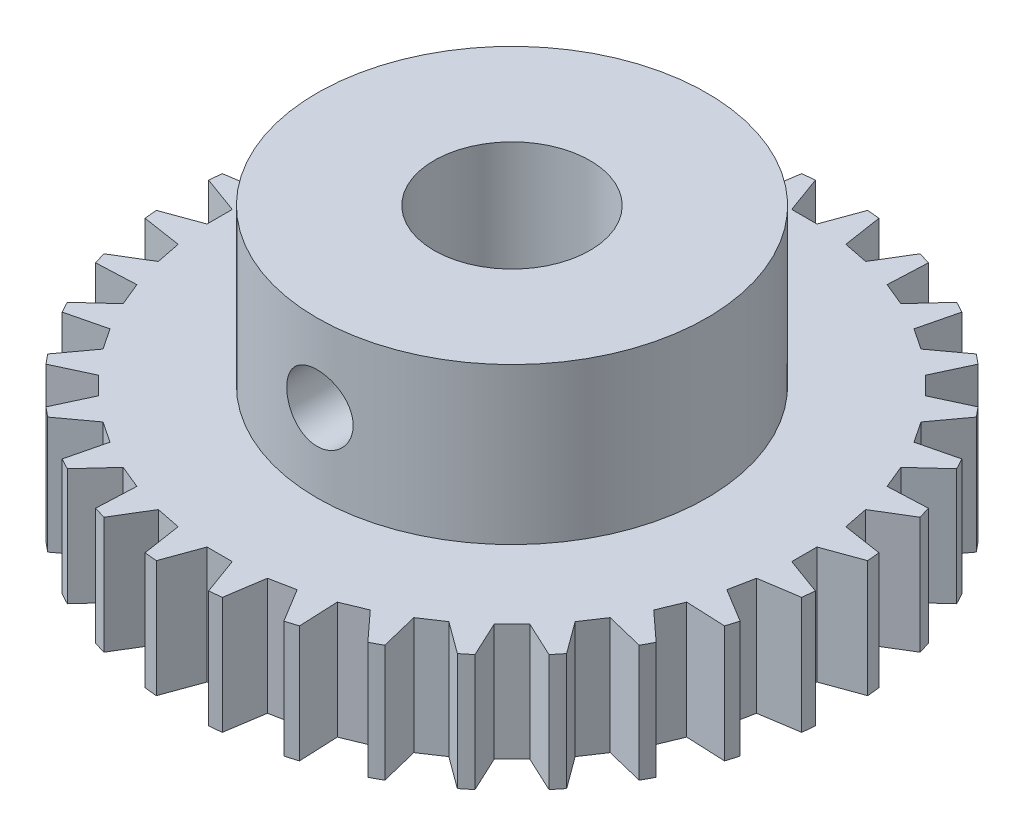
ISO-10303-21;
HEADER;
FILE_DESCRIPTION(('STEP AP214'),'2;1');
FILE_NAME('part.step','',(''),(''),'','','');
FILE_SCHEMA(('AUTOMOTIVE_DESIGN { 1 0 10303 214 1 1 1 1 }'));
ENDSEC;
DATA;
#1=APPLICATION_CONTEXT('core data for automotive mechanical design processes');
#2=APPLICATION_PROTOCOL_DEFINITION('international standard','automotive_design',2000,#1);
#3=PRODUCT_CONTEXT('',#1,'mechanical');
#4=PRODUCT('Part','Part','',(#3));
#5=PRODUCT_RELATED_PRODUCT_CATEGORY('part','',(#4));
#6=PRODUCT_DEFINITION_FORMATION('','',#4);
#7=PRODUCT_DEFINITION_CONTEXT('part definition',#1,'design');
#8=PRODUCT_DEFINITION('design','',#6,#7);
#9=PRODUCT_DEFINITION_SHAPE('','',#8);
#10=(LENGTH_UNIT() NAMED_UNIT(*) SI_UNIT(.MILLI.,.METRE.));
#11=(NAMED_UNIT(*) PLANE_ANGLE_UNIT() SI_UNIT($,.RADIAN.));
#12=(NAMED_UNIT(*) SI_UNIT($,.STERADIAN.) SOLID_ANGLE_UNIT());
#13=UNCERTAINTY_MEASURE_WITH_UNIT(LENGTH_MEASURE(1.E-05),#10,'distance_accuracy_value','');
#14=(GEOMETRIC_REPRESENTATION_CONTEXT(3) GLOBAL_UNCERTAINTY_ASSIGNED_CONTEXT((#13)) GLOBAL_UNIT_ASSIGNED_CONTEXT((#10,
#11,#12)) REPRESENTATION_CONTEXT('',''));
#15=CARTESIAN_POINT('',(0.,0.,0.));
#16=DIRECTION('',(0.,0.,1.));
#17=DIRECTION('',(1.,0.,0.));
#18=AXIS2_PLACEMENT_3D('',#15,#16,#17);
#19=CARTESIAN_POINT('',(0.,4.7625,0.));
#20=DIRECTION('',(0.,-1.,0.));
#21=DIRECTION('',(0.,0.,-1.));
#22=AXIS2_PLACEMENT_3D('',#19,#20,#21);
#23=CYLINDRICAL_SURFACE('',#22,13.462);
#24=CARTESIAN_POINT('',(0.,0.,0.));
#25=DIRECTION('',(0.,1.,0.));
#26=DIRECTION('',(0.,0.,1.));
#27=AXIS2_PLACEMENT_3D('',#24,#25,#26);
#28=CIRCLE('',#27,13.462);
#29=CARTESIAN_POINT('',(-13.4197884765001,0.,1.06523295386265));
#30=VERTEX_POINT('',#29);
#31=CARTESIAN_POINT('',(-13.3697476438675,0.,1.57330605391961));
#32=VERTEX_POINT('',#31);
#33=EDGE_CURVE('E935',#30,#32,#28,.T.);
#34=ORIENTED_EDGE('',*,*,#33,.T.);
#35=DIRECTION('',(0.,-1.,0.));
#36=VECTOR('',#35,1.);
#37=CARTESIAN_POINT('',(-13.3697476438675,4.7625,1.57330605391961));
#38=LINE('',#37,#36);
#39=CARTESIAN_POINT('',(-13.3697476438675,4.7625,1.57330605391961));
#40=VERTEX_POINT('',#39);
#41=EDGE_CURVE('E928',#40,#32,#38,.T.);
#42=ORIENTED_EDGE('',*,*,#41,.F.);
#43=CARTESIAN_POINT('',(0.,4.7625,0.));
#44=DIRECTION('',(0.,1.,0.));
#45=DIRECTION('',(0.,0.,1.));
#46=AXIS2_PLACEMENT_3D('',#43,#44,#45);
#47=CIRCLE('',#46,13.462);
#48=CARTESIAN_POINT('',(-13.4197884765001,4.7625,1.06523295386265));
#49=VERTEX_POINT('',#48);
#50=EDGE_CURVE('E11',#49,#40,#47,.T.);
#51=ORIENTED_EDGE('',*,*,#50,.F.);
#52=DIRECTION('',(0.,-1.,0.));
#53=VECTOR('',#52,1.);
#54=CARTESIAN_POINT('',(-13.4197884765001,4.7625,1.06523295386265));
#55=LINE('',#54,#53);
#56=EDGE_CURVE('E988',#30,#49,#55,.F.);
#57=ORIENTED_EDGE('',*,*,#56,.F.);
#58=EDGE_LOOP('',(#34,#42,#51,#57));
#59=FACE_BOUND('',#58,.T.);
#60=ADVANCED_FACE('F42',(#59),#23,.T.);
#61=CARTESIAN_POINT('',(-12.954114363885,4.7625,3.66283565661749));
#62=VERTEX_POINT('',#61);
#63=CARTESIAN_POINT('',(-12.8059149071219,4.7625,4.15138379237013));
#64=VERTEX_POINT('',#63);
#65=EDGE_CURVE('E55',#62,#64,#47,.T.);
#66=ORIENTED_EDGE('',*,*,#65,.F.);
#67=DIRECTION('',(0.,-1.,0.));
#68=VECTOR('',#67,1.);
#69=CARTESIAN_POINT('',(-12.954114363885,4.7625,3.66283565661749));
#70=LINE('',#69,#68);
#71=CARTESIAN_POINT('',(-12.954114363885,0.,3.6628356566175));
#72=VERTEX_POINT('',#71);
#73=EDGE_CURVE('E910',#72,#62,#70,.F.);
#74=ORIENTED_EDGE('',*,*,#73,.F.);
#75=CARTESIAN_POINT('',(-12.8059149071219,0.,4.15138379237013));
#76=VERTEX_POINT('',#75);
#77=EDGE_CURVE('E926',#72,#76,#28,.T.);
#78=ORIENTED_EDGE('',*,*,#77,.T.);
#79=DIRECTION('',(0.,-1.,0.));
#80=VECTOR('',#79,1.);
#81=CARTESIAN_POINT('',(-12.8059149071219,4.7625,4.15138379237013));
#82=LINE('',#81,#80);
#83=EDGE_CURVE('E1866',#64,#76,#82,.T.);
#84=ORIENTED_EDGE('',*,*,#83,.F.);
#85=EDGE_LOOP('',(#66,#74,#78,#84));
#86=FACE_BOUND('',#85,.T.);
#87=ADVANCED_FACE('F924',(#86),#23,.T.);
#88=CARTESIAN_POINT('',(-11.9906209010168,4.7625,6.11967763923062));
#89=VERTEX_POINT('',#88);
#90=CARTESIAN_POINT('',(-11.7499580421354,4.7625,6.56992617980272));
#91=VERTEX_POINT('',#90);
#92=EDGE_CURVE('E2490',#89,#91,#47,.T.);
#93=ORIENTED_EDGE('',*,*,#92,.F.);
#94=DIRECTION('',(0.,-1.,0.));
#95=VECTOR('',#94,1.);
#96=CARTESIAN_POINT('',(-11.9906209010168,4.7625,6.11967763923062));
#97=LINE('',#96,#95);
#98=CARTESIAN_POINT('',(-11.9906209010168,0.,6.11967763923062));
#99=VERTEX_POINT('',#98);
#100=EDGE_CURVE('E1869',#99,#89,#97,.F.);
#101=ORIENTED_EDGE('',*,*,#100,.F.);
#102=CARTESIAN_POINT('',(-11.7499580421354,0.,6.56992617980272));
#103=VERTEX_POINT('',#102);
#104=EDGE_CURVE('E936',#99,#103,#28,.T.);
#105=ORIENTED_EDGE('',*,*,#104,.T.);
#106=DIRECTION('',(0.,-1.,0.));
#107=VECTOR('',#106,1.);
#108=CARTESIAN_POINT('',(-11.7499580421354,4.7625,6.56992617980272));
#109=LINE('',#108,#107);
#110=EDGE_CURVE('E1834',#91,#103,#109,.T.);
#111=ORIENTED_EDGE('',*,*,#110,.F.);
#112=EDGE_LOOP('',(#93,#101,#105,#111));
#113=FACE_BOUND('',#112,.T.);
#114=ADVANCED_FACE('F2301',(#113),#23,.T.);
#115=CARTESIAN_POINT('',(-10.5663346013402,4.7625,8.34134384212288));
#116=VERTEX_POINT('',#115);
#117=CARTESIAN_POINT('',(-10.2424568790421,4.7625,8.73598998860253));
#118=VERTEX_POINT('',#117);
#119=EDGE_CURVE('E2489',#116,#118,#47,.T.);
#120=ORIENTED_EDGE('',*,*,#119,.F.);
#121=DIRECTION('',(0.,-1.,0.));
#122=VECTOR('',#121,1.);
#123=CARTESIAN_POINT('',(-10.5663346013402,4.7625,8.34134384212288));
#124=LINE('',#123,#122);
#125=CARTESIAN_POINT('',(-10.5663346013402,0.,8.34134384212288));
#126=VERTEX_POINT('',#125);
#127=EDGE_CURVE('E1838',#126,#116,#124,.F.);
#128=ORIENTED_EDGE('',*,*,#127,.F.);
#129=CARTESIAN_POINT('',(-10.2424568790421,0.,8.73598998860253));
#130=VERTEX_POINT('',#129);
#131=EDGE_CURVE('E943',#126,#130,#28,.T.);
#132=ORIENTED_EDGE('',*,*,#131,.T.);
#133=DIRECTION('',(0.,-1.,0.));
#134=VECTOR('',#133,1.);
#135=CARTESIAN_POINT('',(-10.2424568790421,4.7625,8.73598998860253));
#136=LINE('',#135,#134);
#137=EDGE_CURVE('E1800',#118,#130,#136,.T.);
#138=ORIENTED_EDGE('',*,*,#137,.F.);
#139=EDGE_LOOP('',(#120,#128,#132,#138));
#140=FACE_BOUND('',#139,.T.);
#141=ADVANCED_FACE('F2481',(#140),#23,.T.);
#142=CARTESIAN_POINT('',(-8.73598998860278,4.7625,10.2424568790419));
#143=VERTEX_POINT('',#142);
#144=CARTESIAN_POINT('',(-8.34134384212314,4.7625,10.56633460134));
#145=VERTEX_POINT('',#144);
#146=EDGE_CURVE('E2491',#143,#145,#47,.T.);
#147=ORIENTED_EDGE('',*,*,#146,.F.);
#148=DIRECTION('',(0.,-1.,0.));
#149=VECTOR('',#148,1.);
#150=CARTESIAN_POINT('',(-8.73598998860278,4.7625,10.2424568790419));
#151=LINE('',#150,#149);
#152=CARTESIAN_POINT('',(-8.73598998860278,0.,10.2424568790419));
#153=VERTEX_POINT('',#152);
#154=EDGE_CURVE('E1804',#153,#143,#151,.F.);
#155=ORIENTED_EDGE('',*,*,#154,.F.);
#156=CARTESIAN_POINT('',(-8.34134384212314,0.,10.56633460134));
#157=VERTEX_POINT('',#156);
#158=EDGE_CURVE('E2465',#153,#157,#28,.T.);
#159=ORIENTED_EDGE('',*,*,#158,.T.);
#160=DIRECTION('',(0.,-1.,0.));
#161=VECTOR('',#160,1.);
#162=CARTESIAN_POINT('',(-8.34134384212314,4.7625,10.56633460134));
#163=LINE('',#162,#161);
#164=EDGE_CURVE('E1767',#145,#157,#163,.T.);
#165=ORIENTED_EDGE('',*,*,#164,.F.);
#166=EDGE_LOOP('',(#147,#155,#159,#165));
#167=FACE_BOUND('',#166,.T.);
#168=ADVANCED_FACE('F2774',(#167),#23,.T.);
#169=CARTESIAN_POINT('',(-6.56992617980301,4.7625,11.7499580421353));
#170=VERTEX_POINT('',#169);
#171=CARTESIAN_POINT('',(-6.11967763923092,4.7625,11.9906209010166));
#172=VERTEX_POINT('',#171);
#173=EDGE_CURVE('E2493',#170,#172,#47,.T.);
#174=ORIENTED_EDGE('',*,*,#173,.F.);
#175=DIRECTION('',(0.,-1.,0.));
#176=VECTOR('',#175,1.);
#177=CARTESIAN_POINT('',(-6.56992617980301,4.7625,11.7499580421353));
#178=LINE('',#177,#176);
#179=CARTESIAN_POINT('',(-6.56992617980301,0.,11.7499580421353));
#180=VERTEX_POINT('',#179);
#181=EDGE_CURVE('E1771',#180,#170,#178,.F.);
#182=ORIENTED_EDGE('',*,*,#181,.F.);
#183=CARTESIAN_POINT('',(-6.11967763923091,0.,11.9906209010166));
#184=VERTEX_POINT('',#183);
#185=EDGE_CURVE('E2459',#180,#184,#28,.T.);
#186=ORIENTED_EDGE('',*,*,#185,.T.);
#187=DIRECTION('',(0.,-1.,0.));
#188=VECTOR('',#187,1.);
#189=CARTESIAN_POINT('',(-6.11967763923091,4.7625,11.9906209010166));
#190=LINE('',#189,#188);
#191=EDGE_CURVE('E1738',#172,#184,#190,.T.);
#192=ORIENTED_EDGE('',*,*,#191,.F.);
#193=EDGE_LOOP('',(#174,#182,#186,#192));
#194=FACE_BOUND('',#193,.T.);
#195=ADVANCED_FACE('F2770',(#194),#23,.T.);
#196=CARTESIAN_POINT('',(-4.15138379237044,4.7625,12.8059149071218));
#197=VERTEX_POINT('',#196);
#198=CARTESIAN_POINT('',(-3.66283565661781,4.7625,12.9541143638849));
#199=VERTEX_POINT('',#198);
#200=EDGE_CURVE('E2496',#197,#199,#47,.T.);
#201=ORIENTED_EDGE('',*,*,#200,.F.);
#202=DIRECTION('',(0.,-1.,0.));
#203=VECTOR('',#202,1.);
#204=CARTESIAN_POINT('',(-4.15138379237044,4.7625,12.8059149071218));
#205=LINE('',#204,#203);
#206=CARTESIAN_POINT('',(-4.15138379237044,0.,12.8059149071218));
#207=VERTEX_POINT('',#206);
#208=EDGE_CURVE('E1742',#207,#197,#205,.F.);
#209=ORIENTED_EDGE('',*,*,#208,.F.);
#210=CARTESIAN_POINT('',(-3.66283565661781,0.,12.9541143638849));
#211=VERTEX_POINT('',#210);
#212=EDGE_CURVE('E2454',#207,#211,#28,.T.);
#213=ORIENTED_EDGE('',*,*,#212,.T.);
#214=DIRECTION('',(0.,-1.,0.));
#215=VECTOR('',#214,1.);
#216=CARTESIAN_POINT('',(-3.66283565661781,4.7625,12.9541143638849));
#217=LINE('',#216,#215);
#218=EDGE_CURVE('E1711',#199,#211,#217,.T.);
#219=ORIENTED_EDGE('',*,*,#218,.F.);
#220=EDGE_LOOP('',(#201,#209,#213,#219));
#221=FACE_BOUND('',#220,.T.);
#222=ADVANCED_FACE('F2766',(#221),#23,.T.);
#223=CARTESIAN_POINT('',(-1.57330605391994,4.7625,13.3697476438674));
#224=VERTEX_POINT('',#223);
#225=CARTESIAN_POINT('',(-1.06523295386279,4.7625,13.4197884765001));
#226=VERTEX_POINT('',#225);
#227=EDGE_CURVE('E2499',#224,#226,#47,.T.);
#228=ORIENTED_EDGE('',*,*,#227,.F.);
#229=DIRECTION('',(0.,-1.,0.));
#230=VECTOR('',#229,1.);
#231=CARTESIAN_POINT('',(-1.57330605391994,4.7625,13.3697476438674));
#232=LINE('',#231,#230);
#233=CARTESIAN_POINT('',(-1.57330605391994,0.,13.3697476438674));
#234=VERTEX_POINT('',#233);
#235=EDGE_CURVE('E1714',#234,#224,#232,.F.);
#236=ORIENTED_EDGE('',*,*,#235,.F.);
#237=CARTESIAN_POINT('',(-1.06523295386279,0.,13.4197884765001));
#238=VERTEX_POINT('',#237);
#239=EDGE_CURVE('E2449',#234,#238,#28,.T.);
#240=ORIENTED_EDGE('',*,*,#239,.T.);
#241=DIRECTION('',(0.,-1.,0.));
#242=VECTOR('',#241,1.);
#243=CARTESIAN_POINT('',(-1.06523295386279,4.7625,13.4197884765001));
#244=LINE('',#243,#242);
#245=EDGE_CURVE('E1684',#226,#238,#244,.T.);
#246=ORIENTED_EDGE('',*,*,#245,.F.);
#247=EDGE_LOOP('',(#228,#236,#240,#246));
#248=FACE_BOUND('',#247,.T.);
#249=ADVANCED_FACE('F2749',(#248),#23,.T.);
#250=CARTESIAN_POINT('',(1.06523295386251,4.7625,13.4197884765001));
#251=VERTEX_POINT('',#250);
#252=CARTESIAN_POINT('',(1.57330605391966,4.7625,13.3697476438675));
#253=VERTEX_POINT('',#252);
#254=EDGE_CURVE('E2502',#251,#253,#47,.T.);
#255=ORIENTED_EDGE('',*,*,#254,.F.);
#256=DIRECTION('',(0.,-1.,0.));
#257=VECTOR('',#256,1.);
#258=CARTESIAN_POINT('',(1.06523295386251,4.7625,13.4197884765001));
#259=LINE('',#258,#257);
#260=CARTESIAN_POINT('',(1.06523295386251,0.,13.4197884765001));
#261=VERTEX_POINT('',#260);
#262=EDGE_CURVE('E1687',#261,#251,#259,.F.);
#263=ORIENTED_EDGE('',*,*,#262,.F.);
#264=CARTESIAN_POINT('',(1.57330605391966,0.,13.3697476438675));
#265=VERTEX_POINT('',#264);
#266=EDGE_CURVE('E2444',#261,#265,#28,.T.);
#267=ORIENTED_EDGE('',*,*,#266,.T.);
#268=DIRECTION('',(0.,-1.,0.));
#269=VECTOR('',#268,1.);
#270=CARTESIAN_POINT('',(1.57330605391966,4.7625,13.3697476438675));
#271=LINE('',#270,#269);
#272=EDGE_CURVE('E1653',#253,#265,#271,.T.);
#273=ORIENTED_EDGE('',*,*,#272,.F.);
#274=EDGE_LOOP('',(#255,#263,#267,#273));
#275=FACE_BOUND('',#274,.T.);
#276=ADVANCED_FACE('F2745',(#275),#23,.T.);
#277=CARTESIAN_POINT('',(3.66283565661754,4.7625,12.954114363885));
#278=VERTEX_POINT('',#277);
#279=CARTESIAN_POINT('',(4.15138379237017,4.7625,12.8059149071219));
#280=VERTEX_POINT('',#279);
#281=EDGE_CURVE('E2506',#278,#280,#47,.T.);
#282=ORIENTED_EDGE('',*,*,#281,.F.);
#283=DIRECTION('',(0.,-1.,0.));
#284=VECTOR('',#283,1.);
#285=CARTESIAN_POINT('',(3.66283565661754,4.7625,12.954114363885));
#286=LINE('',#285,#284);
#287=CARTESIAN_POINT('',(3.66283565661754,0.,12.954114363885));
#288=VERTEX_POINT('',#287);
#289=EDGE_CURVE('E1657',#288,#278,#286,.F.);
#290=ORIENTED_EDGE('',*,*,#289,.F.);
#291=CARTESIAN_POINT('',(4.15138379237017,0.,12.8059149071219));
#292=VERTEX_POINT('',#291);
#293=EDGE_CURVE('E2439',#288,#292,#28,.T.);
#294=ORIENTED_EDGE('',*,*,#293,.T.);
#295=DIRECTION('',(0.,-1.,0.));
#296=VECTOR('',#295,1.);
#297=CARTESIAN_POINT('',(4.15138379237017,4.7625,12.8059149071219));
#298=LINE('',#297,#296);
#299=EDGE_CURVE('E1620',#280,#292,#298,.T.);
#300=ORIENTED_EDGE('',*,*,#299,.F.);
#301=EDGE_LOOP('',(#282,#290,#294,#300));
#302=FACE_BOUND('',#301,.T.);
#303=ADVANCED_FACE('F2741',(#302),#23,.T.);
#304=CARTESIAN_POINT('',(6.11967763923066,4.7625,11.9906209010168));
#305=VERTEX_POINT('',#304);
#306=CARTESIAN_POINT('',(6.56992617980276,4.7625,11.7499580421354));
#307=VERTEX_POINT('',#306);
#308=EDGE_CURVE('E2510',#305,#307,#47,.T.);
#309=ORIENTED_EDGE('',*,*,#308,.F.);
#310=DIRECTION('',(0.,-1.,0.));
#311=VECTOR('',#310,1.);
#312=CARTESIAN_POINT('',(6.11967763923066,4.7625,11.9906209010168));
#313=LINE('',#312,#311);
#314=CARTESIAN_POINT('',(6.11967763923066,0.,11.9906209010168));
#315=VERTEX_POINT('',#314);
#316=EDGE_CURVE('E1624',#315,#305,#313,.F.);
#317=ORIENTED_EDGE('',*,*,#316,.F.);
#318=CARTESIAN_POINT('',(6.56992617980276,0.,11.7499580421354));
#319=VERTEX_POINT('',#318);
#320=EDGE_CURVE('E2434',#315,#319,#28,.T.);
#321=ORIENTED_EDGE('',*,*,#320,.T.);
#322=DIRECTION('',(0.,-1.,0.));
#323=VECTOR('',#322,1.);
#324=CARTESIAN_POINT('',(6.56992617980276,4.7625,11.7499580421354));
#325=LINE('',#324,#323);
#326=EDGE_CURVE('E1588',#307,#319,#325,.T.);
#327=ORIENTED_EDGE('',*,*,#326,.F.);
#328=EDGE_LOOP('',(#309,#317,#321,#327));
#329=FACE_BOUND('',#328,.T.);
#330=ADVANCED_FACE('F2724',(#329),#23,.T.);
#331=CARTESIAN_POINT('',(8.34134384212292,4.7625,10.5663346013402));
#332=VERTEX_POINT('',#331);
#333=CARTESIAN_POINT('',(8.73598998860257,4.7625,10.242456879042));
#334=VERTEX_POINT('',#333);
#335=EDGE_CURVE('E2514',#332,#334,#47,.T.);
#336=ORIENTED_EDGE('',*,*,#335,.F.);
#337=DIRECTION('',(0.,-1.,0.));
#338=VECTOR('',#337,1.);
#339=CARTESIAN_POINT('',(8.34134384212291,4.7625,10.5663346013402));
#340=LINE('',#339,#338);
#341=CARTESIAN_POINT('',(8.34134384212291,0.,10.5663346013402));
#342=VERTEX_POINT('',#341);
#343=EDGE_CURVE('E1592',#342,#332,#340,.F.);
#344=ORIENTED_EDGE('',*,*,#343,.F.);
#345=CARTESIAN_POINT('',(8.73598998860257,0.,10.242456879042));
#346=VERTEX_POINT('',#345);
#347=EDGE_CURVE('E2429',#342,#346,#28,.T.);
#348=ORIENTED_EDGE('',*,*,#347,.T.);
#349=DIRECTION('',(0.,-1.,0.));
#350=VECTOR('',#349,1.);
#351=CARTESIAN_POINT('',(8.73598998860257,4.7625,10.242456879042));
#352=LINE('',#351,#350);
#353=EDGE_CURVE('E1557',#334,#346,#352,.T.);
#354=ORIENTED_EDGE('',*,*,#353,.F.);
#355=EDGE_LOOP('',(#336,#344,#348,#354));
#356=FACE_BOUND('',#355,.T.);
#357=ADVANCED_FACE('F2720',(#356),#23,.T.);
#358=CARTESIAN_POINT('',(10.2424568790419,4.7625,8.73598998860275));
#359=VERTEX_POINT('',#358);
#360=CARTESIAN_POINT('',(10.56633460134,4.7625,8.3413438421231));
#361=VERTEX_POINT('',#360);
#362=EDGE_CURVE('E2517',#359,#361,#47,.T.);
#363=ORIENTED_EDGE('',*,*,#362,.F.);
#364=DIRECTION('',(0.,-1.,0.));
#365=VECTOR('',#364,1.);
#366=CARTESIAN_POINT('',(10.2424568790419,4.7625,8.73598998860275));
#367=LINE('',#366,#365);
#368=CARTESIAN_POINT('',(10.2424568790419,0.,8.73598998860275));
#369=VERTEX_POINT('',#368);
#370=EDGE_CURVE('E1560',#369,#359,#367,.F.);
#371=ORIENTED_EDGE('',*,*,#370,.F.);
#372=CARTESIAN_POINT('',(10.56633460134,0.,8.3413438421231));
#373=VERTEX_POINT('',#372);
#374=EDGE_CURVE('E2424',#369,#373,#28,.T.);
#375=ORIENTED_EDGE('',*,*,#374,.T.);
#376=DIRECTION('',(0.,-1.,0.));
#377=VECTOR('',#376,1.);
#378=CARTESIAN_POINT('',(10.56633460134,4.7625,8.3413438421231));
#379=LINE('',#378,#377);
#380=EDGE_CURVE('E1531',#361,#373,#379,.T.);
#381=ORIENTED_EDGE('',*,*,#380,.F.);
#382=EDGE_LOOP('',(#363,#371,#375,#381));
#383=FACE_BOUND('',#382,.T.);
#384=ADVANCED_FACE('F2716',(#383),#23,.T.);
#385=CARTESIAN_POINT('',(11.7499580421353,4.7625,6.56992617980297));
#386=VERTEX_POINT('',#385);
#387=CARTESIAN_POINT('',(11.9906209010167,4.7625,6.11967763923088));
#388=VERTEX_POINT('',#387);
#389=EDGE_CURVE('E2520',#386,#388,#47,.T.);
#390=ORIENTED_EDGE('',*,*,#389,.F.);
#391=DIRECTION('',(0.,-1.,0.));
#392=VECTOR('',#391,1.);
#393=CARTESIAN_POINT('',(11.7499580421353,4.7625,6.56992617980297));
#394=LINE('',#393,#392);
#395=CARTESIAN_POINT('',(11.7499580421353,0.,6.56992617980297));
#396=VERTEX_POINT('',#395);
#397=EDGE_CURVE('E1534',#396,#386,#394,.F.);
#398=ORIENTED_EDGE('',*,*,#397,.F.);
#399=CARTESIAN_POINT('',(11.9906209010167,0.,6.11967763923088));
#400=VERTEX_POINT('',#399);
#401=EDGE_CURVE('E2419',#396,#400,#28,.T.);
#402=ORIENTED_EDGE('',*,*,#401,.T.);
#403=DIRECTION('',(0.,-1.,0.));
#404=VECTOR('',#403,1.);
#405=CARTESIAN_POINT('',(11.9906209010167,4.7625,6.11967763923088));
#406=LINE('',#405,#404);
#407=EDGE_CURVE('E1505',#388,#400,#406,.T.);
#408=ORIENTED_EDGE('',*,*,#407,.F.);
#409=EDGE_LOOP('',(#390,#398,#402,#408));
#410=FACE_BOUND('',#409,.T.);
#411=ADVANCED_FACE('F2699',(#410),#23,.T.);
#412=CARTESIAN_POINT('',(12.8059149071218,4.7625,4.1513837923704));
#413=VERTEX_POINT('',#412);
#414=CARTESIAN_POINT('',(12.9541143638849,4.7625,3.66283565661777));
#415=VERTEX_POINT('',#414);
#416=EDGE_CURVE('E2523',#413,#415,#47,.T.);
#417=ORIENTED_EDGE('',*,*,#416,.F.);
#418=DIRECTION('',(0.,-1.,0.));
#419=VECTOR('',#418,1.);
#420=CARTESIAN_POINT('',(12.8059149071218,4.7625,4.1513837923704));
#421=LINE('',#420,#419);
#422=CARTESIAN_POINT('',(12.8059149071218,0.,4.1513837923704));
#423=VERTEX_POINT('',#422);
#424=EDGE_CURVE('E1508',#423,#413,#421,.F.);
#425=ORIENTED_EDGE('',*,*,#424,.F.);
#426=CARTESIAN_POINT('',(12.9541143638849,0.,3.66283565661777));
#427=VERTEX_POINT('',#426);
#428=EDGE_CURVE('E2414',#423,#427,#28,.T.);
#429=ORIENTED_EDGE('',*,*,#428,.T.);
#430=DIRECTION('',(0.,-1.,0.));
#431=VECTOR('',#430,1.);
#432=CARTESIAN_POINT('',(12.9541143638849,4.7625,3.66283565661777));
#433=LINE('',#432,#431);
#434=EDGE_CURVE('E1479',#415,#427,#433,.T.);
#435=ORIENTED_EDGE('',*,*,#434,.F.);
#436=EDGE_LOOP('',(#417,#425,#429,#435));
#437=FACE_BOUND('',#436,.T.);
#438=ADVANCED_FACE('F2695',(#437),#23,.T.);
#439=CARTESIAN_POINT('',(13.3697476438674,4.7625,1.57330605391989));
#440=VERTEX_POINT('',#439);
#441=CARTESIAN_POINT('',(13.4197884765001,4.7625,1.06523295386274));
#442=VERTEX_POINT('',#441);
#443=EDGE_CURVE('E2526',#440,#442,#47,.T.);
#444=ORIENTED_EDGE('',*,*,#443,.F.);
#445=DIRECTION('',(0.,-1.,0.));
#446=VECTOR('',#445,1.);
#447=CARTESIAN_POINT('',(13.3697476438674,4.7625,1.57330605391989));
#448=LINE('',#447,#446);
#449=CARTESIAN_POINT('',(13.3697476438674,0.,1.57330605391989));
#450=VERTEX_POINT('',#449);
#451=EDGE_CURVE('E1482',#450,#440,#448,.F.);
#452=ORIENTED_EDGE('',*,*,#451,.F.);
#453=CARTESIAN_POINT('',(13.4197884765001,0.,1.06523295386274));
#454=VERTEX_POINT('',#453);
#455=EDGE_CURVE('E2409',#450,#454,#28,.T.);
#456=ORIENTED_EDGE('',*,*,#455,.T.);
#457=DIRECTION('',(0.,-1.,0.));
#458=VECTOR('',#457,1.);
#459=CARTESIAN_POINT('',(13.4197884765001,4.7625,1.06523295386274));
#460=LINE('',#459,#458);
#461=EDGE_CURVE('E1453',#442,#454,#460,.T.);
#462=ORIENTED_EDGE('',*,*,#461,.F.);
#463=EDGE_LOOP('',(#444,#452,#456,#462));
#464=FACE_BOUND('',#463,.T.);
#465=ADVANCED_FACE('F2691',(#464),#23,.T.);
#466=CARTESIAN_POINT('',(13.4197884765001,4.7625,-1.06523295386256));
#467=VERTEX_POINT('',#466);
#468=CARTESIAN_POINT('',(13.3697476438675,4.7625,-1.5733060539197));
#469=VERTEX_POINT('',#468);
#470=EDGE_CURVE('E2529',#467,#469,#47,.T.);
#471=ORIENTED_EDGE('',*,*,#470,.F.);
#472=DIRECTION('',(0.,-1.,0.));
#473=VECTOR('',#472,1.);
#474=CARTESIAN_POINT('',(13.4197884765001,4.7625,-1.06523295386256));
#475=LINE('',#474,#473);
#476=CARTESIAN_POINT('',(13.4197884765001,0.,-1.06523295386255));
#477=VERTEX_POINT('',#476);
#478=EDGE_CURVE('E1456',#477,#467,#475,.F.);
#479=ORIENTED_EDGE('',*,*,#478,.F.);
#480=CARTESIAN_POINT('',(13.3697476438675,0.,-1.5733060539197));
#481=VERTEX_POINT('',#480);
#482=EDGE_CURVE('E2404',#477,#481,#28,.T.);
#483=ORIENTED_EDGE('',*,*,#482,.T.);
#484=DIRECTION('',(0.,-1.,0.));
#485=VECTOR('',#484,1.);
#486=CARTESIAN_POINT('',(13.3697476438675,4.7625,-1.5733060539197));
#487=LINE('',#486,#485);
#488=EDGE_CURVE('E1427',#469,#481,#487,.T.);
#489=ORIENTED_EDGE('',*,*,#488,.F.);
#490=EDGE_LOOP('',(#471,#479,#483,#489));
#491=FACE_BOUND('',#490,.T.);
#492=ADVANCED_FACE('F2674',(#491),#23,.T.);
#493=CARTESIAN_POINT('',(12.954114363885,4.7625,-3.66283565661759));
#494=VERTEX_POINT('',#493);
#495=CARTESIAN_POINT('',(12.8059149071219,4.7625,-4.15138379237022));
#496=VERTEX_POINT('',#495);
#497=EDGE_CURVE('E2532',#494,#496,#47,.T.);
#498=ORIENTED_EDGE('',*,*,#497,.F.);
#499=DIRECTION('',(0.,-1.,0.));
#500=VECTOR('',#499,1.);
#501=CARTESIAN_POINT('',(12.954114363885,4.7625,-3.66283565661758));
#502=LINE('',#501,#500);
#503=CARTESIAN_POINT('',(12.954114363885,0.,-3.66283565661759));
#504=VERTEX_POINT('',#503);
#505=EDGE_CURVE('E1430',#504,#494,#502,.F.);
#506=ORIENTED_EDGE('',*,*,#505,.F.);
#507=CARTESIAN_POINT('',(12.8059149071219,0.,-4.15138379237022));
#508=VERTEX_POINT('',#507);
#509=EDGE_CURVE('E2399',#504,#508,#28,.T.);
#510=ORIENTED_EDGE('',*,*,#509,.T.);
#511=DIRECTION('',(0.,-1.,0.));
#512=VECTOR('',#511,1.);
#513=CARTESIAN_POINT('',(12.8059149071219,4.7625,-4.15138379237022));
#514=LINE('',#513,#512);
#515=EDGE_CURVE('E1401',#496,#508,#514,.T.);
#516=ORIENTED_EDGE('',*,*,#515,.F.);
#517=EDGE_LOOP('',(#498,#506,#510,#516));
#518=FACE_BOUND('',#517,.T.);
#519=ADVANCED_FACE('F2670',(#518),#23,.T.);
#520=CARTESIAN_POINT('',(11.9906209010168,4.7625,-6.11967763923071));
#521=VERTEX_POINT('',#520);
#522=CARTESIAN_POINT('',(11.7499580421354,4.7625,-6.5699261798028));
#523=VERTEX_POINT('',#522);
#524=EDGE_CURVE('E2535',#521,#523,#47,.T.);
#525=ORIENTED_EDGE('',*,*,#524,.F.);
#526=DIRECTION('',(0.,-1.,0.));
#527=VECTOR('',#526,1.);
#528=CARTESIAN_POINT('',(11.9906209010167,4.7625,-6.11967763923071));
#529=LINE('',#528,#527);
#530=CARTESIAN_POINT('',(11.9906209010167,0.,-6.11967763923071));
#531=VERTEX_POINT('',#530);
#532=EDGE_CURVE('E1404',#531,#521,#529,.F.);
#533=ORIENTED_EDGE('',*,*,#532,.F.);
#534=CARTESIAN_POINT('',(11.7499580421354,0.,-6.5699261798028));
#535=VERTEX_POINT('',#534);
#536=EDGE_CURVE('E2394',#531,#535,#28,.T.);
#537=ORIENTED_EDGE('',*,*,#536,.T.);
#538=DIRECTION('',(0.,-1.,0.));
#539=VECTOR('',#538,1.);
#540=CARTESIAN_POINT('',(11.7499580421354,4.7625,-6.5699261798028));
#541=LINE('',#540,#539);
#542=EDGE_CURVE('E1375',#523,#535,#541,.T.);
#543=ORIENTED_EDGE('',*,*,#542,.F.);
#544=EDGE_LOOP('',(#525,#533,#537,#543));
#545=FACE_BOUND('',#544,.T.);
#546=ADVANCED_FACE('F2666',(#545),#23,.T.);
#547=CARTESIAN_POINT('',(10.5663346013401,4.7625,-8.34134384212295));
#548=VERTEX_POINT('',#547);
#549=CARTESIAN_POINT('',(10.242456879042,4.7625,-8.73598998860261));
#550=VERTEX_POINT('',#549);
#551=EDGE_CURVE('E2538',#548,#550,#47,.T.);
#552=ORIENTED_EDGE('',*,*,#551,.F.);
#553=DIRECTION('',(0.,-1.,0.));
#554=VECTOR('',#553,1.);
#555=CARTESIAN_POINT('',(10.5663346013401,4.7625,-8.34134384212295));
#556=LINE('',#555,#554);
#557=CARTESIAN_POINT('',(10.5663346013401,0.,-8.34134384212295));
#558=VERTEX_POINT('',#557);
#559=EDGE_CURVE('E1378',#558,#548,#556,.F.);
#560=ORIENTED_EDGE('',*,*,#559,.F.);
#561=CARTESIAN_POINT('',(10.242456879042,0.,-8.7359899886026));
#562=VERTEX_POINT('',#561);
#563=EDGE_CURVE('E2389',#558,#562,#28,.T.);
#564=ORIENTED_EDGE('',*,*,#563,.T.);
#565=DIRECTION('',(0.,-1.,0.));
#566=VECTOR('',#565,1.);
#567=CARTESIAN_POINT('',(10.242456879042,4.7625,-8.7359899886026));
#568=LINE('',#567,#566);
#569=EDGE_CURVE('E1349',#550,#562,#568,.T.);
#570=ORIENTED_EDGE('',*,*,#569,.F.);
#571=EDGE_LOOP('',(#552,#560,#564,#570));
#572=FACE_BOUND('',#571,.T.);
#573=ADVANCED_FACE('F2649',(#572),#23,.T.);
#574=CARTESIAN_POINT('',(8.73598998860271,4.7625,-10.2424568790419));
#575=VERTEX_POINT('',#574);
#576=CARTESIAN_POINT('',(8.34134384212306,4.7625,-10.56633460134));
#577=VERTEX_POINT('',#576);
#578=EDGE_CURVE('E2541',#575,#577,#47,.T.);
#579=ORIENTED_EDGE('',*,*,#578,.F.);
#580=DIRECTION('',(0.,-1.,0.));
#581=VECTOR('',#580,1.);
#582=CARTESIAN_POINT('',(8.73598998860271,4.7625,-10.2424568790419));
#583=LINE('',#582,#581);
#584=CARTESIAN_POINT('',(8.73598998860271,0.,-10.2424568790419));
#585=VERTEX_POINT('',#584);
#586=EDGE_CURVE('E1352',#585,#575,#583,.F.);
#587=ORIENTED_EDGE('',*,*,#586,.F.);
#588=CARTESIAN_POINT('',(8.34134384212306,0.,-10.56633460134));
#589=VERTEX_POINT('',#588);
#590=EDGE_CURVE('E2384',#585,#589,#28,.T.);
#591=ORIENTED_EDGE('',*,*,#590,.T.);
#592=DIRECTION('',(0.,-1.,0.));
#593=VECTOR('',#592,1.);
#594=CARTESIAN_POINT('',(8.34134384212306,4.7625,-10.56633460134));
#595=LINE('',#594,#593);
#596=EDGE_CURVE('E1322',#577,#589,#595,.T.);
#597=ORIENTED_EDGE('',*,*,#596,.F.);
#598=EDGE_LOOP('',(#579,#587,#591,#597));
#599=FACE_BOUND('',#598,.T.);
#600=ADVANCED_FACE('F2645',(#599),#23,.T.);
#601=CARTESIAN_POINT('',(6.56992617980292,4.7625,-11.7499580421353));
#602=VERTEX_POINT('',#601);
#603=CARTESIAN_POINT('',(6.11967763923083,4.7625,-11.9906209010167));
#604=VERTEX_POINT('',#603);
#605=EDGE_CURVE('E2544',#602,#604,#47,.T.);
#606=ORIENTED_EDGE('',*,*,#605,.F.);
#607=DIRECTION('',(0.,-1.,0.));
#608=VECTOR('',#607,1.);
#609=CARTESIAN_POINT('',(6.56992617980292,4.7625,-11.7499580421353));
#610=LINE('',#609,#608);
#611=CARTESIAN_POINT('',(6.56992617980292,0.,-11.7499580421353));
#612=VERTEX_POINT('',#611);
#613=EDGE_CURVE('E1325',#612,#602,#610,.F.);
#614=ORIENTED_EDGE('',*,*,#613,.F.);
#615=CARTESIAN_POINT('',(6.11967763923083,0.,-11.9906209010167));
#616=VERTEX_POINT('',#615);
#617=EDGE_CURVE('E2378',#612,#616,#28,.T.);
#618=ORIENTED_EDGE('',*,*,#617,.T.);
#619=DIRECTION('',(0.,-1.,0.));
#620=VECTOR('',#619,1.);
#621=CARTESIAN_POINT('',(6.11967763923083,4.7625,-11.9906209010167));
#622=LINE('',#621,#620);
#623=EDGE_CURVE('E1289',#604,#616,#622,.T.);
#624=ORIENTED_EDGE('',*,*,#623,.F.);
#625=EDGE_LOOP('',(#606,#614,#618,#624));
#626=FACE_BOUND('',#625,.T.);
#627=ADVANCED_FACE('F2641',(#626),#23,.T.);
#628=CARTESIAN_POINT('',(4.15138379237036,4.7625,-12.8059149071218));
#629=VERTEX_POINT('',#628);
#630=CARTESIAN_POINT('',(3.66283565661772,4.7625,-12.9541143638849));
#631=VERTEX_POINT('',#630);
#632=EDGE_CURVE('E2547',#629,#631,#47,.T.);
#633=ORIENTED_EDGE('',*,*,#632,.F.);
#634=DIRECTION('',(0.,-1.,0.));
#635=VECTOR('',#634,1.);
#636=CARTESIAN_POINT('',(4.15138379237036,4.7625,-12.8059149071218));
#637=LINE('',#636,#635);
#638=CARTESIAN_POINT('',(4.15138379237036,0.,-12.8059149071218));
#639=VERTEX_POINT('',#638);
#640=EDGE_CURVE('E1293',#639,#629,#637,.F.);
#641=ORIENTED_EDGE('',*,*,#640,.F.);
#642=CARTESIAN_POINT('',(3.66283565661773,0.,-12.9541143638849));
#643=VERTEX_POINT('',#642);
#644=EDGE_CURVE('E2372',#639,#643,#28,.T.);
#645=ORIENTED_EDGE('',*,*,#644,.T.);
#646=DIRECTION('',(0.,-1.,0.));
#647=VECTOR('',#646,1.);
#648=CARTESIAN_POINT('',(3.66283565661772,4.7625,-12.9541143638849));
#649=LINE('',#648,#647);
#650=EDGE_CURVE('E1256',#631,#643,#649,.T.);
#651=ORIENTED_EDGE('',*,*,#650,.F.);
#652=EDGE_LOOP('',(#633,#641,#645,#651));
#653=FACE_BOUND('',#652,.T.);
#654=ADVANCED_FACE('F2624',(#653),#23,.T.);
#655=CARTESIAN_POINT('',(1.57330605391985,4.7625,-13.3697476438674));
#656=VERTEX_POINT('',#655);
#657=CARTESIAN_POINT('',(1.0652329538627,4.7625,-13.4197884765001));
#658=VERTEX_POINT('',#657);
#659=EDGE_CURVE('E2550',#656,#658,#47,.T.);
#660=ORIENTED_EDGE('',*,*,#659,.F.);
#661=DIRECTION('',(0.,-1.,0.));
#662=VECTOR('',#661,1.);
#663=CARTESIAN_POINT('',(1.57330605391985,4.7625,-13.3697476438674));
#664=LINE('',#663,#662);
#665=CARTESIAN_POINT('',(1.57330605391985,0.,-13.3697476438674));
#666=VERTEX_POINT('',#665);
#667=EDGE_CURVE('E1260',#666,#656,#664,.F.);
#668=ORIENTED_EDGE('',*,*,#667,.F.);
#669=CARTESIAN_POINT('',(1.0652329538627,0.,-13.4197884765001));
#670=VERTEX_POINT('',#669);
#671=EDGE_CURVE('E2366',#666,#670,#28,.T.);
#672=ORIENTED_EDGE('',*,*,#671,.T.);
#673=DIRECTION('',(0.,-1.,0.));
#674=VECTOR('',#673,1.);
#675=CARTESIAN_POINT('',(1.0652329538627,4.7625,-13.4197884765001));
#676=LINE('',#675,#674);
#677=EDGE_CURVE('E1223',#658,#670,#676,.T.);
#678=ORIENTED_EDGE('',*,*,#677,.F.);
#679=EDGE_LOOP('',(#660,#668,#672,#678));
#680=FACE_BOUND('',#679,.T.);
#681=ADVANCED_FACE('F2620',(#680),#23,.T.);
#682=CARTESIAN_POINT('',(-1.0652329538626,4.7625,-13.4197884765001));
#683=VERTEX_POINT('',#682);
#684=CARTESIAN_POINT('',(-1.57330605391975,4.7625,-13.3697476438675));
#685=VERTEX_POINT('',#684);
#686=EDGE_CURVE('E2553',#683,#685,#47,.T.);
#687=ORIENTED_EDGE('',*,*,#686,.F.);
#688=DIRECTION('',(0.,-1.,0.));
#689=VECTOR('',#688,1.);
#690=CARTESIAN_POINT('',(-1.0652329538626,4.7625,-13.4197884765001));
#691=LINE('',#690,#689);
#692=CARTESIAN_POINT('',(-1.0652329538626,0.,-13.4197884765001));
#693=VERTEX_POINT('',#692);
#694=EDGE_CURVE('E1227',#693,#683,#691,.F.);
#695=ORIENTED_EDGE('',*,*,#694,.F.);
#696=CARTESIAN_POINT('',(-1.57330605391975,0.,-13.3697476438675));
#697=VERTEX_POINT('',#696);
#698=EDGE_CURVE('E2360',#693,#697,#28,.T.);
#699=ORIENTED_EDGE('',*,*,#698,.T.);
#700=DIRECTION('',(0.,-1.,0.));
#701=VECTOR('',#700,1.);
#702=CARTESIAN_POINT('',(-1.57330605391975,4.7625,-13.3697476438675));
#703=LINE('',#702,#701);
#704=EDGE_CURVE('E1188',#685,#697,#703,.T.);
#705=ORIENTED_EDGE('',*,*,#704,.F.);
#706=EDGE_LOOP('',(#687,#695,#699,#705));
#707=FACE_BOUND('',#706,.T.);
#708=ADVANCED_FACE('F2616',(#707),#23,.T.);
#709=CARTESIAN_POINT('',(-3.66283565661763,4.7625,-12.954114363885));
#710=VERTEX_POINT('',#709);
#711=CARTESIAN_POINT('',(-4.15138379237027,4.7625,-12.8059149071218));
#712=VERTEX_POINT('',#711);
#713=EDGE_CURVE('E2557',#710,#712,#47,.T.);
#714=ORIENTED_EDGE('',*,*,#713,.F.);
#715=DIRECTION('',(0.,-1.,0.));
#716=VECTOR('',#715,1.);
#717=CARTESIAN_POINT('',(-3.66283565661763,4.7625,-12.954114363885));
#718=LINE('',#717,#716);
#719=CARTESIAN_POINT('',(-3.66283565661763,0.,-12.954114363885));
#720=VERTEX_POINT('',#719);
#721=EDGE_CURVE('E1192',#720,#710,#718,.F.);
#722=ORIENTED_EDGE('',*,*,#721,.F.);
#723=CARTESIAN_POINT('',(-4.15138379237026,0.,-12.8059149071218));
#724=VERTEX_POINT('',#723);
#725=EDGE_CURVE('E2354',#720,#724,#28,.T.);
#726=ORIENTED_EDGE('',*,*,#725,.T.);
#727=DIRECTION('',(0.,-1.,0.));
#728=VECTOR('',#727,1.);
#729=CARTESIAN_POINT('',(-4.15138379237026,4.7625,-12.8059149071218));
#730=LINE('',#729,#728);
#731=EDGE_CURVE('E1152',#712,#724,#730,.T.);
#732=ORIENTED_EDGE('',*,*,#731,.F.);
#733=EDGE_LOOP('',(#714,#722,#726,#732));
#734=FACE_BOUND('',#733,.T.);
#735=ADVANCED_FACE('F2581',(#734),#23,.T.);
#736=CARTESIAN_POINT('',(-6.11967763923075,4.7625,-11.9906209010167));
#737=VERTEX_POINT('',#736);
#738=CARTESIAN_POINT('',(-6.56992617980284,4.7625,-11.7499580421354));
#739=VERTEX_POINT('',#738);
#740=EDGE_CURVE('E2560',#737,#739,#47,.T.);
#741=ORIENTED_EDGE('',*,*,#740,.F.);
#742=DIRECTION('',(0.,-1.,0.));
#743=VECTOR('',#742,1.);
#744=CARTESIAN_POINT('',(-6.11967763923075,4.7625,-11.9906209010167));
#745=LINE('',#744,#743);
#746=CARTESIAN_POINT('',(-6.11967763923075,0.,-11.9906209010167));
#747=VERTEX_POINT('',#746);
#748=EDGE_CURVE('E1156',#747,#737,#745,.F.);
#749=ORIENTED_EDGE('',*,*,#748,.F.);
#750=CARTESIAN_POINT('',(-6.56992617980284,0.,-11.7499580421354));
#751=VERTEX_POINT('',#750);
#752=EDGE_CURVE('E2348',#747,#751,#28,.T.);
#753=ORIENTED_EDGE('',*,*,#752,.T.);
#754=DIRECTION('',(0.,-1.,0.));
#755=VECTOR('',#754,1.);
#756=CARTESIAN_POINT('',(-6.56992617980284,4.7625,-11.7499580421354));
#757=LINE('',#756,#755);
#758=EDGE_CURVE('E1121',#739,#751,#757,.T.);
#759=ORIENTED_EDGE('',*,*,#758,.F.);
#760=EDGE_LOOP('',(#741,#749,#753,#759));
#761=FACE_BOUND('',#760,.T.);
#762=ADVANCED_FACE('F2577',(#761),#23,.T.);
#763=CARTESIAN_POINT('',(-8.34134384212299,4.7625,-10.5663346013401));
#764=VERTEX_POINT('',#763);
#765=CARTESIAN_POINT('',(-8.73598998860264,4.7625,-10.242456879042));
#766=VERTEX_POINT('',#765);
#767=EDGE_CURVE('E2563',#764,#766,#47,.T.);
#768=ORIENTED_EDGE('',*,*,#767,.F.);
#769=DIRECTION('',(0.,-1.,0.));
#770=VECTOR('',#769,1.);
#771=CARTESIAN_POINT('',(-8.34134384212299,4.7625,-10.5663346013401));
#772=LINE('',#771,#770);
#773=CARTESIAN_POINT('',(-8.34134384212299,0.,-10.5663346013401));
#774=VERTEX_POINT('',#773);
#775=EDGE_CURVE('E1124',#774,#764,#772,.F.);
#776=ORIENTED_EDGE('',*,*,#775,.F.);
#777=CARTESIAN_POINT('',(-8.73598998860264,0.,-10.242456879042));
#778=VERTEX_POINT('',#777);
#779=EDGE_CURVE('E2343',#774,#778,#28,.T.);
#780=ORIENTED_EDGE('',*,*,#779,.T.);
#781=DIRECTION('',(0.,-1.,0.));
#782=VECTOR('',#781,1.);
#783=CARTESIAN_POINT('',(-8.73598998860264,4.7625,-10.242456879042));
#784=LINE('',#783,#782);
#785=EDGE_CURVE('E1091',#766,#778,#784,.T.);
#786=ORIENTED_EDGE('',*,*,#785,.F.);
#787=EDGE_LOOP('',(#768,#776,#780,#786));
#788=FACE_BOUND('',#787,.T.);
#789=ADVANCED_FACE('F2573',(#788),#23,.T.);
#790=CARTESIAN_POINT('',(-10.242456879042,4.7625,-8.73598998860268));
#791=VERTEX_POINT('',#790);
#792=CARTESIAN_POINT('',(-10.5663346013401,4.7625,-8.34134384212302));
#793=VERTEX_POINT('',#792);
#794=EDGE_CURVE('E2328',#791,#793,#47,.T.);
#795=ORIENTED_EDGE('',*,*,#794,.F.);
#796=DIRECTION('',(0.,-1.,0.));
#797=VECTOR('',#796,1.);
#798=CARTESIAN_POINT('',(-10.242456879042,4.7625,-8.73598998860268));
#799=LINE('',#798,#797);
#800=CARTESIAN_POINT('',(-10.242456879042,0.,-8.73598998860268));
#801=VERTEX_POINT('',#800);
#802=EDGE_CURVE('E1094',#801,#791,#799,.F.);
#803=ORIENTED_EDGE('',*,*,#802,.F.);
#804=CARTESIAN_POINT('',(-10.5663346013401,0.,-8.34134384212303));
#805=VERTEX_POINT('',#804);
#806=EDGE_CURVE('E2339',#801,#805,#28,.T.);
#807=ORIENTED_EDGE('',*,*,#806,.T.);
#808=DIRECTION('',(0.,-1.,0.));
#809=VECTOR('',#808,1.);
#810=CARTESIAN_POINT('',(-10.5663346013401,4.7625,-8.34134384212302));
#811=LINE('',#810,#809);
#812=EDGE_CURVE('E1065',#793,#805,#811,.T.);
#813=ORIENTED_EDGE('',*,*,#812,.F.);
#814=EDGE_LOOP('',(#795,#803,#807,#813));
#815=FACE_BOUND('',#814,.T.);
#816=ADVANCED_FACE('F2319',(#815),#23,.T.);
#817=CARTESIAN_POINT('',(-11.7499580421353,4.7625,-6.56992617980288));
#818=VERTEX_POINT('',#817);
#819=CARTESIAN_POINT('',(-11.9906209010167,4.7625,-6.11967763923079));
#820=VERTEX_POINT('',#819);
#821=EDGE_CURVE('E2327',#818,#820,#47,.T.);
#822=ORIENTED_EDGE('',*,*,#821,.F.);
#823=DIRECTION('',(0.,-1.,0.));
#824=VECTOR('',#823,1.);
#825=CARTESIAN_POINT('',(-11.7499580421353,4.7625,-6.56992617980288));
#826=LINE('',#825,#824);
#827=CARTESIAN_POINT('',(-11.7499580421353,0.,-6.56992617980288));
#828=VERTEX_POINT('',#827);
#829=EDGE_CURVE('E1068',#828,#818,#826,.F.);
#830=ORIENTED_EDGE('',*,*,#829,.F.);
#831=CARTESIAN_POINT('',(-11.9906209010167,0.,-6.11967763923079));
#832=VERTEX_POINT('',#831);
#833=EDGE_CURVE('E2338',#828,#832,#28,.T.);
#834=ORIENTED_EDGE('',*,*,#833,.T.);
#835=DIRECTION('',(0.,-1.,0.));
#836=VECTOR('',#835,1.);
#837=CARTESIAN_POINT('',(-11.9906209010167,4.7625,-6.11967763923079));
#838=LINE('',#837,#836);
#839=EDGE_CURVE('E1039',#820,#832,#838,.T.);
#840=ORIENTED_EDGE('',*,*,#839,.F.);
#841=EDGE_LOOP('',(#822,#830,#834,#840));
#842=FACE_BOUND('',#841,.T.);
#843=ADVANCED_FACE('F2311',(#842),#23,.T.);
#844=CARTESIAN_POINT('',(-12.8059149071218,4.7625,-4.15138379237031));
#845=VERTEX_POINT('',#844);
#846=CARTESIAN_POINT('',(-12.9541143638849,4.7625,-3.66283565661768));
#847=VERTEX_POINT('',#846);
#848=EDGE_CURVE('E2324',#845,#847,#47,.T.);
#849=ORIENTED_EDGE('',*,*,#848,.F.);
#850=DIRECTION('',(0.,-1.,0.));
#851=VECTOR('',#850,1.);
#852=CARTESIAN_POINT('',(-12.8059149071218,4.7625,-4.15138379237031));
#853=LINE('',#852,#851);
#854=CARTESIAN_POINT('',(-12.8059149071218,0.,-4.15138379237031));
#855=VERTEX_POINT('',#854);
#856=EDGE_CURVE('E1042',#855,#845,#853,.F.);
#857=ORIENTED_EDGE('',*,*,#856,.F.);
#858=CARTESIAN_POINT('',(-12.9541143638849,0.,-3.66283565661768));
#859=VERTEX_POINT('',#858);
#860=EDGE_CURVE('E2337',#855,#859,#28,.T.);
#861=ORIENTED_EDGE('',*,*,#860,.T.);
#862=DIRECTION('',(0.,-1.,0.));
#863=VECTOR('',#862,1.);
#864=CARTESIAN_POINT('',(-12.9541143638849,4.7625,-3.66283565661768));
#865=LINE('',#864,#863);
#866=EDGE_CURVE('E1013',#847,#859,#865,.T.);
#867=ORIENTED_EDGE('',*,*,#866,.F.);
#868=EDGE_LOOP('',(#849,#857,#861,#867));
#869=FACE_BOUND('',#868,.T.);
#870=ADVANCED_FACE('F2304',(#869),#23,.T.);
#871=CARTESIAN_POINT('',(0.,4.7625,0.));
#872=DIRECTION('',(0.,1.,0.));
#873=DIRECTION('',(0.,0.,1.));
#874=AXIS2_PLACEMENT_3D('',#871,#872,#873);
#875=PLANE('',#874);
#876=DIRECTION('',(0.988361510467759,0.,0.152123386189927));
#877=VECTOR('',#876,1.);
#878=CARTESIAN_POINT('',(-11.77781945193,4.7625,1.81832723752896));
#879=LINE('',#878,#877);
#880=CARTESIAN_POINT('',(-11.77781945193,4.7625,1.81832723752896));
#881=VERTEX_POINT('',#880);
#882=EDGE_CURVE('E1884',#40,#881,#879,.T.);
#883=ORIENTED_EDGE('',*,*,#882,.T.);
#884=DIRECTION('',(0.195090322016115,0.,0.980785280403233));
#885=VECTOR('',#884,1.);
#886=CARTESIAN_POINT('',(-11.577130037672,4.7625,2.82726105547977));
#887=LINE('',#886,#885);
#888=CARTESIAN_POINT('',(-11.577130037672,4.7625,2.82726105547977));
#889=VERTEX_POINT('',#888);
#890=EDGE_CURVE('E1872',#881,#889,#887,.T.);
#891=ORIENTED_EDGE('',*,*,#890,.T.);
#892=DIRECTION('',(-0.854911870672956,0.,0.518773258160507));
#893=VECTOR('',#892,1.);
#894=CARTESIAN_POINT('',(-12.9925174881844,4.7625,3.68613924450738));
#895=LINE('',#894,#893);
#896=EDGE_CURVE('E1888',#889,#62,#895,.T.);
#897=ORIENTED_EDGE('',*,*,#896,.T.);
#898=ORIENTED_EDGE('',*,*,#65,.T.);
#899=DIRECTION('',(0.999048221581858,0.,-0.0436193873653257));
#900=VECTOR('',#899,1.);
#901=CARTESIAN_POINT('',(-11.1967739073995,4.7625,4.08112717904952));
#902=LINE('',#901,#900);
#903=CARTESIAN_POINT('',(-11.1967739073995,4.7625,4.08112717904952));
#904=VERTEX_POINT('',#903);
#905=EDGE_CURVE('E1858',#64,#904,#902,.T.);
#906=ORIENTED_EDGE('',*,*,#905,.T.);
#907=DIRECTION('',(0.382683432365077,0.,0.923879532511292));
#908=VECTOR('',#907,1.);
#909=CARTESIAN_POINT('',(-10.8031074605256,4.7625,5.03152205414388));
#910=LINE('',#909,#908);
#911=CARTESIAN_POINT('',(-10.8031074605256,4.7625,5.03152205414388));
#912=VERTEX_POINT('',#911);
#913=EDGE_CURVE('E1841',#904,#912,#910,.T.);
#914=ORIENTED_EDGE('',*,*,#913,.T.);
#915=DIRECTION('',(-0.737277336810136,0.,0.675590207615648));
#916=VECTOR('',#915,1.);
#917=CARTESIAN_POINT('',(-12.0237398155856,4.7625,6.15002553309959));
#918=LINE('',#917,#916);
#919=EDGE_CURVE('E1862',#912,#89,#918,.T.);
#920=ORIENTED_EDGE('',*,*,#919,.T.);
#921=ORIENTED_EDGE('',*,*,#92,.T.);
#922=DIRECTION('',(0.971342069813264,0.,-0.237685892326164));
#923=VECTOR('',#922,1.);
#924=CARTESIAN_POINT('',(-10.1854426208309,4.7625,6.1870916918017));
#925=LINE('',#924,#923);
#926=CARTESIAN_POINT('',(-10.1854426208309,4.7625,6.1870916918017));
#927=VERTEX_POINT('',#926);
#928=EDGE_CURVE('E1827',#91,#927,#925,.T.);
#929=ORIENTED_EDGE('',*,*,#928,.T.);
#930=DIRECTION('',(0.555570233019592,0.,0.831469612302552));
#931=VECTOR('',#930,1.);
#932=CARTESIAN_POINT('',(-9.61392752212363,4.7625,7.04242448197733));
#933=LINE('',#932,#931);
#934=CARTESIAN_POINT('',(-9.61392752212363,4.7625,7.04242448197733));
#935=VERTEX_POINT('',#934);
#936=EDGE_CURVE('E1807',#927,#935,#933,.T.);
#937=ORIENTED_EDGE('',*,*,#936,.T.);
#938=DIRECTION('',(-0.591309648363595,0.,0.806444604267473));
#939=VECTOR('',#938,1.);
#940=CARTESIAN_POINT('',(-10.5928965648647,4.7625,8.37756978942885));
#941=LINE('',#940,#939);
#942=EDGE_CURVE('E1831',#935,#116,#941,.T.);
#943=ORIENTED_EDGE('',*,*,#942,.T.);
#944=ORIENTED_EDGE('',*,*,#119,.T.);
#945=DIRECTION('',(0.906307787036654,0.,-0.422618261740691));
#946=VECTOR('',#945,1.);
#947=CARTESIAN_POINT('',(-8.78269048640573,4.7625,8.05528974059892));
#948=LINE('',#947,#946);
#949=CARTESIAN_POINT('',(-8.78269048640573,4.7625,8.05528974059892));
#950=VERTEX_POINT('',#949);
#951=EDGE_CURVE('E1794',#118,#950,#948,.T.);
#952=ORIENTED_EDGE('',*,*,#951,.T.);
#953=DIRECTION('',(0.707106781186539,0.,0.707106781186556));
#954=VECTOR('',#953,1.);
#955=CARTESIAN_POINT('',(-8.05528974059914,4.7625,8.78269048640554));
#956=LINE('',#955,#954);
#957=CARTESIAN_POINT('',(-8.05528974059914,4.7625,8.78269048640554));
#958=VERTEX_POINT('',#957);
#959=EDGE_CURVE('E1774',#950,#958,#956,.T.);
#960=ORIENTED_EDGE('',*,*,#959,.T.);
#961=DIRECTION('',(-0.422618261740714,0.,0.906307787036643));
#962=VECTOR('',#961,1.);
#963=CARTESIAN_POINT('',(-8.75497423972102,4.7625,10.2831687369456));
#964=LINE('',#963,#962);
#965=EDGE_CURVE('E1797',#958,#143,#964,.T.);
#966=ORIENTED_EDGE('',*,*,#965,.T.);
#967=ORIENTED_EDGE('',*,*,#146,.T.);
#968=DIRECTION('',(0.806444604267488,0.,-0.591309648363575));
#969=VECTOR('',#968,1.);
#970=CARTESIAN_POINT('',(-7.04242448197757,4.7625,9.61392752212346));
#971=LINE('',#970,#969);
#972=CARTESIAN_POINT('',(-7.04242448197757,4.7625,9.61392752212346));
#973=VERTEX_POINT('',#972);
#974=EDGE_CURVE('E1761',#145,#973,#971,.T.);
#975=ORIENTED_EDGE('',*,*,#974,.T.);
#976=DIRECTION('',(0.831469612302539,0.,0.555570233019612));
#977=VECTOR('',#976,1.);
#978=CARTESIAN_POINT('',(-6.18709169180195,4.7625,10.1854426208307));
#979=LINE('',#978,#977);
#980=CARTESIAN_POINT('',(-6.18709169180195,4.7625,10.1854426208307));
#981=VERTEX_POINT('',#980);
#982=EDGE_CURVE('E1744',#973,#981,#979,.T.);
#983=ORIENTED_EDGE('',*,*,#982,.T.);
#984=DIRECTION('',(-0.237685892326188,0.,0.971342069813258));
#985=VECTOR('',#984,1.);
#986=CARTESIAN_POINT('',(-6.58060316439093,4.7625,11.793591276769));
#987=LINE('',#986,#985);
#988=EDGE_CURVE('E1764',#981,#170,#987,.T.);
#989=ORIENTED_EDGE('',*,*,#988,.T.);
#990=ORIENTED_EDGE('',*,*,#173,.T.);
#991=DIRECTION('',(0.675590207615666,0.,-0.737277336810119));
#992=VECTOR('',#991,1.);
#993=CARTESIAN_POINT('',(-5.03152205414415,4.7625,10.8031074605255));
#994=LINE('',#993,#992);
#995=CARTESIAN_POINT('',(-5.03152205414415,4.7625,10.8031074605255));
#996=VERTEX_POINT('',#995);
#997=EDGE_CURVE('E1732',#172,#996,#994,.T.);
#998=ORIENTED_EDGE('',*,*,#997,.T.);
#999=DIRECTION('',(0.923879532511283,0.,0.3826834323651));
#1000=VECTOR('',#999,1.);
#1001=CARTESIAN_POINT('',(-4.08112717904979,4.7625,11.1967739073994));
#1002=LINE('',#1001,#1000);
#1003=CARTESIAN_POINT('',(-4.08112717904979,4.7625,11.1967739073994));
#1004=VERTEX_POINT('',#1003);
#1005=EDGE_CURVE('E1716',#996,#1004,#1002,.T.);
#1006=ORIENTED_EDGE('',*,*,#1005,.T.);
#1007=DIRECTION('',(-0.0436193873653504,0.,0.999048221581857));
#1008=VECTOR('',#1007,1.);
#1009=CARTESIAN_POINT('',(-4.15334319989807,4.7625,12.8507927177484));
#1010=LINE('',#1009,#1008);
#1011=EDGE_CURVE('E1735',#1004,#197,#1010,.T.);
#1012=ORIENTED_EDGE('',*,*,#1011,.T.);
#1013=ORIENTED_EDGE('',*,*,#200,.T.);
#1014=DIRECTION('',(0.518773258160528,0.,-0.854911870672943));
#1015=VECTOR('',#1014,1.);
#1016=CARTESIAN_POINT('',(-2.82726105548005,4.7625,11.5771300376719));
#1017=LINE('',#1016,#1015);
#1018=CARTESIAN_POINT('',(-2.82726105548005,4.7625,11.5771300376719));
#1019=VERTEX_POINT('',#1018);
#1020=EDGE_CURVE('E1705',#199,#1019,#1017,.T.);
#1021=ORIENTED_EDGE('',*,*,#1020,.T.);
#1022=DIRECTION('',(0.980785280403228,0.,0.195090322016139));
#1023=VECTOR('',#1022,1.);
#1024=CARTESIAN_POINT('',(-1.81832723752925,4.7625,11.7778194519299));
#1025=LINE('',#1024,#1023);
#1026=CARTESIAN_POINT('',(-1.81832723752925,4.7625,11.7778194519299));
#1027=VERTEX_POINT('',#1026);
#1028=EDGE_CURVE('E1690',#1019,#1027,#1025,.T.);
#1029=ORIENTED_EDGE('',*,*,#1028,.T.);
#1030=DIRECTION('',(0.152123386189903,0.,0.988361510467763));
#1031=VECTOR('',#1030,1.);
#1032=CARTESIAN_POINT('',(-1.56647258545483,4.7625,13.4141454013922));
#1033=LINE('',#1032,#1031);
#1034=EDGE_CURVE('E1708',#1027,#224,#1033,.T.);
#1035=ORIENTED_EDGE('',*,*,#1034,.T.);
#1036=ORIENTED_EDGE('',*,*,#227,.T.);
#1037=DIRECTION('',(0.342020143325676,0.,-0.939692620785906));
#1038=VECTOR('',#1037,1.);
#1039=CARTESIAN_POINT('',(-0.514350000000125,4.7625,11.90625));
#1040=LINE('',#1039,#1038);
#1041=CARTESIAN_POINT('',(-0.514350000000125,4.7625,11.90625));
#1042=VERTEX_POINT('',#1041);
#1043=EDGE_CURVE('E1677',#226,#1042,#1040,.T.);
#1044=ORIENTED_EDGE('',*,*,#1043,.T.);
#1045=DIRECTION('',(1.,0.,0.));
#1046=VECTOR('',#1045,1.);
#1047=CARTESIAN_POINT('',(0.514349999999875,4.7625,11.90625));
#1048=LINE('',#1047,#1046);
#1049=CARTESIAN_POINT('',(0.514349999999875,4.7625,11.90625));
#1050=VERTEX_POINT('',#1049);
#1051=EDGE_CURVE('E1660',#1042,#1050,#1048,.T.);
#1052=ORIENTED_EDGE('',*,*,#1051,.T.);
#1053=DIRECTION('',(0.342020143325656,0.,0.939692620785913));
#1054=VECTOR('',#1053,1.);
#1055=CARTESIAN_POINT('',(1.0805966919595,4.7625,13.462));
#1056=LINE('',#1055,#1054);
#1057=EDGE_CURVE('E1680',#1050,#251,#1056,.T.);
#1058=ORIENTED_EDGE('',*,*,#1057,.T.);
#1059=ORIENTED_EDGE('',*,*,#254,.T.);
#1060=DIRECTION('',(0.152123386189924,0.,-0.98836151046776));
#1061=VECTOR('',#1060,1.);
#1062=CARTESIAN_POINT('',(1.818327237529,4.7625,11.77781945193));
#1063=LINE('',#1062,#1061);
#1064=CARTESIAN_POINT('',(1.818327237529,4.7625,11.77781945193));
#1065=VERTEX_POINT('',#1064);
#1066=EDGE_CURVE('E1645',#253,#1065,#1063,.T.);
#1067=ORIENTED_EDGE('',*,*,#1066,.T.);
#1068=DIRECTION('',(0.980785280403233,0.,-0.195090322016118));
#1069=VECTOR('',#1068,1.);
#1070=CARTESIAN_POINT('',(2.82726105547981,4.7625,11.577130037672));
#1071=LINE('',#1070,#1069);
#1072=CARTESIAN_POINT('',(2.82726105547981,4.7625,11.577130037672));
#1073=VERTEX_POINT('',#1072);
#1074=EDGE_CURVE('E1627',#1065,#1073,#1071,.T.);
#1075=ORIENTED_EDGE('',*,*,#1074,.T.);
#1076=DIRECTION('',(0.51877325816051,0.,0.854911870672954));
#1077=VECTOR('',#1076,1.);
#1078=CARTESIAN_POINT('',(3.68613924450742,4.7625,12.9925174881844));
#1079=LINE('',#1078,#1077);
#1080=EDGE_CURVE('E1649',#1073,#278,#1079,.T.);
#1081=ORIENTED_EDGE('',*,*,#1080,.T.);
#1082=ORIENTED_EDGE('',*,*,#281,.T.);
#1083=DIRECTION('',(-0.0436193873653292,0.,-0.999048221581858));
#1084=VECTOR('',#1083,1.);
#1085=CARTESIAN_POINT('',(4.08112717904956,4.7625,11.1967739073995));
#1086=LINE('',#1085,#1084);
#1087=CARTESIAN_POINT('',(4.08112717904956,4.7625,11.1967739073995));
#1088=VERTEX_POINT('',#1087);
#1089=EDGE_CURVE('E1612',#280,#1088,#1086,.T.);
#1090=ORIENTED_EDGE('',*,*,#1089,.T.);
#1091=DIRECTION('',(0.923879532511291,0.,-0.38268343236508));
#1092=VECTOR('',#1091,1.);
#1093=CARTESIAN_POINT('',(5.03152205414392,4.7625,10.8031074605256));
#1094=LINE('',#1093,#1092);
#1095=CARTESIAN_POINT('',(5.03152205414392,4.7625,10.8031074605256));
#1096=VERTEX_POINT('',#1095);
#1097=EDGE_CURVE('E1594',#1088,#1096,#1094,.T.);
#1098=ORIENTED_EDGE('',*,*,#1097,.T.);
#1099=DIRECTION('',(0.67559020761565,0.,0.737277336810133));
#1100=VECTOR('',#1099,1.);
#1101=CARTESIAN_POINT('',(6.15002553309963,4.7625,12.0237398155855));
#1102=LINE('',#1101,#1100);
#1103=EDGE_CURVE('E1616',#1096,#305,#1102,.T.);
#1104=ORIENTED_EDGE('',*,*,#1103,.T.);
#1105=ORIENTED_EDGE('',*,*,#308,.T.);
#1106=DIRECTION('',(-0.237685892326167,0.,-0.971342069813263));
#1107=VECTOR('',#1106,1.);
#1108=CARTESIAN_POINT('',(6.18709169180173,4.7625,10.1854426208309));
#1109=LINE('',#1108,#1107);
#1110=CARTESIAN_POINT('',(6.18709169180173,4.7625,10.1854426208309));
#1111=VERTEX_POINT('',#1110);
#1112=EDGE_CURVE('E1580',#307,#1111,#1109,.T.);
#1113=ORIENTED_EDGE('',*,*,#1112,.T.);
#1114=DIRECTION('',(0.83146961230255,0.,-0.555570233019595));
#1115=VECTOR('',#1114,1.);
#1116=CARTESIAN_POINT('',(7.04242448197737,4.7625,9.61392752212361));
#1117=LINE('',#1116,#1115);
#1118=CARTESIAN_POINT('',(7.04242448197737,4.7625,9.61392752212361));
#1119=VERTEX_POINT('',#1118);
#1120=EDGE_CURVE('E1562',#1111,#1119,#1117,.T.);
#1121=ORIENTED_EDGE('',*,*,#1120,.T.);
#1122=DIRECTION('',(0.806444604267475,0.,0.591309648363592));
#1123=VECTOR('',#1122,1.);
#1124=CARTESIAN_POINT('',(8.37756978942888,4.7625,10.5928965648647));
#1125=LINE('',#1124,#1123);
#1126=EDGE_CURVE('E1584',#1119,#332,#1125,.T.);
#1127=ORIENTED_EDGE('',*,*,#1126,.T.);
#1128=ORIENTED_EDGE('',*,*,#335,.T.);
#1129=DIRECTION('',(-0.422618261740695,0.,-0.906307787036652));
#1130=VECTOR('',#1129,1.);
#1131=CARTESIAN_POINT('',(8.05528974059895,4.7625,8.7826904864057));
#1132=LINE('',#1131,#1130);
#1133=CARTESIAN_POINT('',(8.05528974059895,4.7625,8.7826904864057));
#1134=VERTEX_POINT('',#1133);
#1135=EDGE_CURVE('E1551',#334,#1134,#1132,.T.);
#1136=ORIENTED_EDGE('',*,*,#1135,.T.);
#1137=DIRECTION('',(0.707106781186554,0.,-0.707106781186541));
#1138=VECTOR('',#1137,1.);
#1139=CARTESIAN_POINT('',(8.78269048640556,4.7625,8.05528974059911));
#1140=LINE('',#1139,#1138);
#1141=CARTESIAN_POINT('',(8.78269048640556,4.7625,8.05528974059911));
#1142=VERTEX_POINT('',#1141);
#1143=EDGE_CURVE('E1536',#1134,#1142,#1140,.T.);
#1144=ORIENTED_EDGE('',*,*,#1143,.T.);
#1145=DIRECTION('',(0.906307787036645,0.,0.42261826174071));
#1146=VECTOR('',#1145,1.);
#1147=CARTESIAN_POINT('',(10.2831687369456,4.7625,8.75497423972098));
#1148=LINE('',#1147,#1146);
#1149=EDGE_CURVE('E1554',#1142,#359,#1148,.T.);
#1150=ORIENTED_EDGE('',*,*,#1149,.T.);
#1151=ORIENTED_EDGE('',*,*,#362,.T.);
#1152=DIRECTION('',(-0.591309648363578,0.,-0.806444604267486));
#1153=VECTOR('',#1152,1.);
#1154=CARTESIAN_POINT('',(9.61392752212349,4.7625,7.04242448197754));
#1155=LINE('',#1154,#1153);
#1156=CARTESIAN_POINT('',(9.61392752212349,4.7625,7.04242448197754));
#1157=VERTEX_POINT('',#1156);
#1158=EDGE_CURVE('E1525',#361,#1157,#1155,.T.);
#1159=ORIENTED_EDGE('',*,*,#1158,.T.);
#1160=DIRECTION('',(0.555570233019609,0.,-0.831469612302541));
#1161=VECTOR('',#1160,1.);
#1162=CARTESIAN_POINT('',(10.1854426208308,4.7625,6.18709169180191));
#1163=LINE('',#1162,#1161);
#1164=CARTESIAN_POINT('',(10.1854426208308,4.7625,6.18709169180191));
#1165=VERTEX_POINT('',#1164);
#1166=EDGE_CURVE('E1510',#1157,#1165,#1163,.T.);
#1167=ORIENTED_EDGE('',*,*,#1166,.T.);
#1168=DIRECTION('',(0.971342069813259,0.,0.237685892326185));
#1169=VECTOR('',#1168,1.);
#1170=CARTESIAN_POINT('',(11.793591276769,4.7625,6.58060316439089));
#1171=LINE('',#1170,#1169);
#1172=EDGE_CURVE('E1528',#1165,#386,#1171,.T.);
#1173=ORIENTED_EDGE('',*,*,#1172,.T.);
#1174=ORIENTED_EDGE('',*,*,#389,.T.);
#1175=DIRECTION('',(-0.737277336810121,0.,-0.675590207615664));
#1176=VECTOR('',#1175,1.);
#1177=CARTESIAN_POINT('',(10.8031074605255,4.7625,5.03152205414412));
#1178=LINE('',#1177,#1176);
#1179=CARTESIAN_POINT('',(10.8031074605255,4.7625,5.03152205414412));
#1180=VERTEX_POINT('',#1179);
#1181=EDGE_CURVE('E1499',#388,#1180,#1178,.T.);
#1182=ORIENTED_EDGE('',*,*,#1181,.T.);
#1183=DIRECTION('',(0.382683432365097,0.,-0.923879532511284));
#1184=VECTOR('',#1183,1.);
#1185=CARTESIAN_POINT('',(11.1967739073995,4.7625,4.08112717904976));
#1186=LINE('',#1185,#1184);
#1187=CARTESIAN_POINT('',(11.1967739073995,4.7625,4.08112717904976));
#1188=VERTEX_POINT('',#1187);
#1189=EDGE_CURVE('E1484',#1180,#1188,#1186,.T.);
#1190=ORIENTED_EDGE('',*,*,#1189,.T.);
#1191=DIRECTION('',(0.999048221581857,0.,0.0436193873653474));
#1192=VECTOR('',#1191,1.);
#1193=CARTESIAN_POINT('',(12.8507927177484,4.7625,4.15334319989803));
#1194=LINE('',#1193,#1192);
#1195=EDGE_CURVE('E1502',#1188,#413,#1194,.T.);
#1196=ORIENTED_EDGE('',*,*,#1195,.T.);
#1197=ORIENTED_EDGE('',*,*,#416,.T.);
#1198=DIRECTION('',(-0.854911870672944,0.,-0.518773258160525));
#1199=VECTOR('',#1198,1.);
#1200=CARTESIAN_POINT('',(11.5771300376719,4.7625,2.82726105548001));
#1201=LINE('',#1200,#1199);
#1202=CARTESIAN_POINT('',(11.5771300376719,4.7625,2.82726105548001));
#1203=VERTEX_POINT('',#1202);
#1204=EDGE_CURVE('E1473',#415,#1203,#1201,.T.);
#1205=ORIENTED_EDGE('',*,*,#1204,.T.);
#1206=DIRECTION('',(0.195090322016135,0.,-0.980785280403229));
#1207=VECTOR('',#1206,1.);
#1208=CARTESIAN_POINT('',(11.7778194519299,4.7625,1.81832723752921));
#1209=LINE('',#1208,#1207);
#1210=CARTESIAN_POINT('',(11.7778194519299,4.7625,1.81832723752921));
#1211=VERTEX_POINT('',#1210);
#1212=EDGE_CURVE('E1458',#1203,#1211,#1209,.T.);
#1213=ORIENTED_EDGE('',*,*,#1212,.T.);
#1214=DIRECTION('',(0.988361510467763,0.,-0.152123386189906));
#1215=VECTOR('',#1214,1.);
#1216=CARTESIAN_POINT('',(13.4141454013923,4.7625,1.56647258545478));
#1217=LINE('',#1216,#1215);
#1218=EDGE_CURVE('E1476',#1211,#440,#1217,.T.);
#1219=ORIENTED_EDGE('',*,*,#1218,.T.);
#1220=ORIENTED_EDGE('',*,*,#443,.T.);
#1221=DIRECTION('',(-0.939692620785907,0.,-0.342020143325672));
#1222=VECTOR('',#1221,1.);
#1223=CARTESIAN_POINT('',(11.90625,4.7625,0.514350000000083));
#1224=LINE('',#1223,#1222);
#1225=CARTESIAN_POINT('',(11.90625,4.7625,0.514350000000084));
#1226=VERTEX_POINT('',#1225);
#1227=EDGE_CURVE('E1447',#442,#1226,#1224,.T.);
#1228=ORIENTED_EDGE('',*,*,#1227,.T.);
#1229=DIRECTION('',(0.,0.,-1.));
#1230=VECTOR('',#1229,1.);
#1231=CARTESIAN_POINT('',(11.90625,4.7625,-0.514349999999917));
#1232=LINE('',#1231,#1230);
#1233=CARTESIAN_POINT('',(11.90625,4.7625,-0.514349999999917));
#1234=VERTEX_POINT('',#1233);
#1235=EDGE_CURVE('E1432',#1226,#1234,#1232,.T.);
#1236=ORIENTED_EDGE('',*,*,#1235,.T.);
#1237=DIRECTION('',(0.939692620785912,0.,-0.342020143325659));
#1238=VECTOR('',#1237,1.);
#1239=CARTESIAN_POINT('',(13.462,4.7625,-1.08059669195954));
#1240=LINE('',#1239,#1238);
#1241=EDGE_CURVE('E1450',#1234,#467,#1240,.T.);
#1242=ORIENTED_EDGE('',*,*,#1241,.T.);
#1243=ORIENTED_EDGE('',*,*,#470,.T.);
#1244=DIRECTION('',(-0.98836151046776,0.,-0.15212338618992));
#1245=VECTOR('',#1244,1.);
#1246=CARTESIAN_POINT('',(11.77781945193,4.7625,-1.81832723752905));
#1247=LINE('',#1246,#1245);
#1248=CARTESIAN_POINT('',(11.77781945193,4.7625,-1.81832723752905));
#1249=VERTEX_POINT('',#1248);
#1250=EDGE_CURVE('E1421',#469,#1249,#1247,.T.);
#1251=ORIENTED_EDGE('',*,*,#1250,.T.);
#1252=DIRECTION('',(-0.195090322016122,0.,-0.980785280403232));
#1253=VECTOR('',#1252,1.);
#1254=CARTESIAN_POINT('',(11.577130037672,4.7625,-2.82726105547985));
#1255=LINE('',#1254,#1253);
#1256=CARTESIAN_POINT('',(11.577130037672,4.7625,-2.82726105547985));
#1257=VERTEX_POINT('',#1256);
#1258=EDGE_CURVE('E1406',#1249,#1257,#1255,.T.);
#1259=ORIENTED_EDGE('',*,*,#1258,.T.);
#1260=DIRECTION('',(0.854911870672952,0.,-0.518773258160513));
#1261=VECTOR('',#1260,1.);
#1262=CARTESIAN_POINT('',(12.9925174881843,4.7625,-3.68613924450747));
#1263=LINE('',#1262,#1261);
#1264=EDGE_CURVE('E1424',#1257,#494,#1263,.T.);
#1265=ORIENTED_EDGE('',*,*,#1264,.T.);
#1266=ORIENTED_EDGE('',*,*,#497,.T.);
#1267=DIRECTION('',(-0.999048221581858,0.,0.0436193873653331));
#1268=VECTOR('',#1267,1.);
#1269=CARTESIAN_POINT('',(11.1967739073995,4.7625,-4.0811271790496));
#1270=LINE('',#1269,#1268);
#1271=CARTESIAN_POINT('',(11.1967739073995,4.7625,-4.0811271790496));
#1272=VERTEX_POINT('',#1271);
#1273=EDGE_CURVE('E1395',#496,#1272,#1270,.T.);
#1274=ORIENTED_EDGE('',*,*,#1273,.T.);
#1275=DIRECTION('',(-0.382683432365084,0.,-0.923879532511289));
#1276=VECTOR('',#1275,1.);
#1277=CARTESIAN_POINT('',(10.8031074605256,4.7625,-5.03152205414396));
#1278=LINE('',#1277,#1276);
#1279=CARTESIAN_POINT('',(10.8031074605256,4.7625,-5.03152205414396));
#1280=VERTEX_POINT('',#1279);
#1281=EDGE_CURVE('E1380',#1272,#1280,#1278,.T.);
#1282=ORIENTED_EDGE('',*,*,#1281,.T.);
#1283=DIRECTION('',(0.737277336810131,0.,-0.675590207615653));
#1284=VECTOR('',#1283,1.);
#1285=CARTESIAN_POINT('',(12.0237398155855,4.7625,-6.15002553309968));
#1286=LINE('',#1285,#1284);
#1287=EDGE_CURVE('E1398',#1280,#521,#1286,.T.);
#1288=ORIENTED_EDGE('',*,*,#1287,.T.);
#1289=ORIENTED_EDGE('',*,*,#524,.T.);
#1290=DIRECTION('',(-0.971342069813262,0.,0.237685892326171));
#1291=VECTOR('',#1290,1.);
#1292=CARTESIAN_POINT('',(10.1854426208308,4.7625,-6.18709169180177));
#1293=LINE('',#1292,#1291);
#1294=CARTESIAN_POINT('',(10.1854426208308,4.7625,-6.18709169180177));
#1295=VERTEX_POINT('',#1294);
#1296=EDGE_CURVE('E1369',#523,#1295,#1293,.T.);
#1297=ORIENTED_EDGE('',*,*,#1296,.T.);
#1298=DIRECTION('',(-0.555570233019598,0.,-0.831469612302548));
#1299=VECTOR('',#1298,1.);
#1300=CARTESIAN_POINT('',(9.61392752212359,4.7625,-7.0424244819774));
#1301=LINE('',#1300,#1299);
#1302=CARTESIAN_POINT('',(9.61392752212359,4.7625,-7.0424244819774));
#1303=VERTEX_POINT('',#1302);
#1304=EDGE_CURVE('E1354',#1295,#1303,#1301,.T.);
#1305=ORIENTED_EDGE('',*,*,#1304,.T.);
#1306=DIRECTION('',(0.59130964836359,0.,-0.806444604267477));
#1307=VECTOR('',#1306,1.);
#1308=CARTESIAN_POINT('',(10.5928965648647,4.7625,-8.37756978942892));
#1309=LINE('',#1308,#1307);
#1310=EDGE_CURVE('E1372',#1303,#548,#1309,.T.);
#1311=ORIENTED_EDGE('',*,*,#1310,.T.);
#1312=ORIENTED_EDGE('',*,*,#551,.T.);
#1313=DIRECTION('',(-0.906307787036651,0.,0.422618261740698));
#1314=VECTOR('',#1313,1.);
#1315=CARTESIAN_POINT('',(8.78269048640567,4.7625,-8.05528974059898));
#1316=LINE('',#1315,#1314);
#1317=CARTESIAN_POINT('',(8.78269048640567,4.7625,-8.05528974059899));
#1318=VERTEX_POINT('',#1317);
#1319=EDGE_CURVE('E1343',#550,#1318,#1316,.T.);
#1320=ORIENTED_EDGE('',*,*,#1319,.T.);
#1321=DIRECTION('',(-0.707106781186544,0.,-0.707106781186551));
#1322=VECTOR('',#1321,1.);
#1323=CARTESIAN_POINT('',(8.05528974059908,4.7625,-8.78269048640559));
#1324=LINE('',#1323,#1322);
#1325=CARTESIAN_POINT('',(8.05528974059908,4.7625,-8.78269048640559));
#1326=VERTEX_POINT('',#1325);
#1327=EDGE_CURVE('E1328',#1318,#1326,#1324,.T.);
#1328=ORIENTED_EDGE('',*,*,#1327,.T.);
#1329=DIRECTION('',(0.422618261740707,0.,-0.906307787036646));
#1330=VECTOR('',#1329,1.);
#1331=CARTESIAN_POINT('',(8.75497423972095,4.7625,-10.2831687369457));
#1332=LINE('',#1331,#1330);
#1333=EDGE_CURVE('E1346',#1326,#575,#1332,.T.);
#1334=ORIENTED_EDGE('',*,*,#1333,.T.);
#1335=ORIENTED_EDGE('',*,*,#578,.T.);
#1336=DIRECTION('',(-0.806444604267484,0.,0.591309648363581));
#1337=VECTOR('',#1336,1.);
#1338=CARTESIAN_POINT('',(7.0424244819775,4.7625,-9.61392752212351));
#1339=LINE('',#1338,#1337);
#1340=CARTESIAN_POINT('',(7.0424244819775,4.7625,-9.61392752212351));
#1341=VERTEX_POINT('',#1340);
#1342=EDGE_CURVE('E1316',#577,#1341,#1339,.T.);
#1343=ORIENTED_EDGE('',*,*,#1342,.T.);
#1344=DIRECTION('',(-0.831469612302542,0.,-0.555570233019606));
#1345=VECTOR('',#1344,1.);
#1346=CARTESIAN_POINT('',(6.18709169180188,4.7625,-10.1854426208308));
#1347=LINE('',#1346,#1345);
#1348=CARTESIAN_POINT('',(6.18709169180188,4.7625,-10.1854426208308));
#1349=VERTEX_POINT('',#1348);
#1350=EDGE_CURVE('E1296',#1341,#1349,#1347,.T.);
#1351=ORIENTED_EDGE('',*,*,#1350,.T.);
#1352=DIRECTION('',(0.237685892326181,0.,-0.971342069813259));
#1353=VECTOR('',#1352,1.);
#1354=CARTESIAN_POINT('',(6.58060316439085,4.7625,-11.7935912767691));
#1355=LINE('',#1354,#1353);
#1356=EDGE_CURVE('E1319',#1349,#602,#1355,.T.);
#1357=ORIENTED_EDGE('',*,*,#1356,.T.);
#1358=ORIENTED_EDGE('',*,*,#605,.T.);
#1359=DIRECTION('',(-0.675590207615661,0.,0.737277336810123));
#1360=VECTOR('',#1359,1.);
#1361=CARTESIAN_POINT('',(5.03152205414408,4.7625,-10.8031074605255));
#1362=LINE('',#1361,#1360);
#1363=CARTESIAN_POINT('',(5.03152205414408,4.7625,-10.8031074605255));
#1364=VERTEX_POINT('',#1363);
#1365=EDGE_CURVE('E1283',#604,#1364,#1362,.T.);
#1366=ORIENTED_EDGE('',*,*,#1365,.T.);
#1367=DIRECTION('',(-0.923879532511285,0.,-0.382683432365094));
#1368=VECTOR('',#1367,1.);
#1369=CARTESIAN_POINT('',(4.08112717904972,4.7625,-11.1967739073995));
#1370=LINE('',#1369,#1368);
#1371=CARTESIAN_POINT('',(4.08112717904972,4.7625,-11.1967739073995));
#1372=VERTEX_POINT('',#1371);
#1373=EDGE_CURVE('E1263',#1364,#1372,#1370,.T.);
#1374=ORIENTED_EDGE('',*,*,#1373,.T.);
#1375=DIRECTION('',(0.0436193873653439,0.,-0.999048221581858));
#1376=VECTOR('',#1375,1.);
#1377=CARTESIAN_POINT('',(4.15334319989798,4.7625,-12.8507927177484));
#1378=LINE('',#1377,#1376);
#1379=EDGE_CURVE('E1286',#1372,#629,#1378,.T.);
#1380=ORIENTED_EDGE('',*,*,#1379,.T.);
#1381=ORIENTED_EDGE('',*,*,#632,.T.);
#1382=DIRECTION('',(-0.518773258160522,0.,0.854911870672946));
#1383=VECTOR('',#1382,1.);
#1384=CARTESIAN_POINT('',(2.82726105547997,4.7625,-11.577130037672));
#1385=LINE('',#1384,#1383);
#1386=CARTESIAN_POINT('',(2.82726105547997,4.7625,-11.577130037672));
#1387=VERTEX_POINT('',#1386);
#1388=EDGE_CURVE('E1250',#631,#1387,#1385,.T.);
#1389=ORIENTED_EDGE('',*,*,#1388,.T.);
#1390=DIRECTION('',(-0.98078528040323,0.,-0.195090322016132));
#1391=VECTOR('',#1390,1.);
#1392=CARTESIAN_POINT('',(1.81832723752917,4.7625,-11.77781945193));
#1393=LINE('',#1392,#1391);
#1394=CARTESIAN_POINT('',(1.81832723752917,4.7625,-11.77781945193));
#1395=VERTEX_POINT('',#1394);
#1396=EDGE_CURVE('E1230',#1387,#1395,#1393,.T.);
#1397=ORIENTED_EDGE('',*,*,#1396,.T.);
#1398=DIRECTION('',(-0.152123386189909,0.,-0.988361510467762));
#1399=VECTOR('',#1398,1.);
#1400=CARTESIAN_POINT('',(1.56647258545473,4.7625,-13.4141454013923));
#1401=LINE('',#1400,#1399);
#1402=EDGE_CURVE('E1253',#1395,#656,#1401,.T.);
#1403=ORIENTED_EDGE('',*,*,#1402,.T.);
#1404=ORIENTED_EDGE('',*,*,#659,.T.);
#1405=DIRECTION('',(-0.342020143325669,0.,0.939692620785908));
#1406=VECTOR('',#1405,1.);
#1407=CARTESIAN_POINT('',(0.514350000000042,4.7625,-11.90625));
#1408=LINE('',#1407,#1406);
#1409=CARTESIAN_POINT('',(0.514350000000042,4.7625,-11.90625));
#1410=VERTEX_POINT('',#1409);
#1411=EDGE_CURVE('E1216',#658,#1410,#1408,.T.);
#1412=ORIENTED_EDGE('',*,*,#1411,.T.);
#1413=DIRECTION('',(-1.,0.,0.));
#1414=VECTOR('',#1413,1.);
#1415=CARTESIAN_POINT('',(-0.514349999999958,4.7625,-11.90625));
#1416=LINE('',#1415,#1414);
#1417=CARTESIAN_POINT('',(-0.514349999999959,4.7625,-11.90625));
#1418=VERTEX_POINT('',#1417);
#1419=EDGE_CURVE('E1195',#1410,#1418,#1416,.T.);
#1420=ORIENTED_EDGE('',*,*,#1419,.T.);
#1421=DIRECTION('',(-0.342020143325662,0.,-0.939692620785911));
#1422=VECTOR('',#1421,1.);
#1423=CARTESIAN_POINT('',(-1.08059669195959,4.7625,-13.462));
#1424=LINE('',#1423,#1422);
#1425=EDGE_CURVE('E1219',#1418,#683,#1424,.T.);
#1426=ORIENTED_EDGE('',*,*,#1425,.T.);
#1427=ORIENTED_EDGE('',*,*,#686,.T.);
#1428=DIRECTION('',(-0.152123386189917,0.,0.988361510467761));
#1429=VECTOR('',#1428,1.);
#1430=CARTESIAN_POINT('',(-1.81832723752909,4.7625,-11.77781945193));
#1431=LINE('',#1430,#1429);
#1432=CARTESIAN_POINT('',(-1.81832723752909,4.7625,-11.77781945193));
#1433=VERTEX_POINT('',#1432);
#1434=EDGE_CURVE('E1180',#685,#1433,#1431,.T.);
#1435=ORIENTED_EDGE('',*,*,#1434,.T.);
#1436=DIRECTION('',(-0.980785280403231,0.,0.195090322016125));
#1437=VECTOR('',#1436,1.);
#1438=CARTESIAN_POINT('',(-2.82726105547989,4.7625,-11.577130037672));
#1439=LINE('',#1438,#1437);
#1440=CARTESIAN_POINT('',(-2.82726105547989,4.7625,-11.577130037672));
#1441=VERTEX_POINT('',#1440);
#1442=EDGE_CURVE('E1159',#1433,#1441,#1439,.T.);
#1443=ORIENTED_EDGE('',*,*,#1442,.T.);
#1444=DIRECTION('',(-0.518773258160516,0.,-0.85491187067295));
#1445=VECTOR('',#1444,1.);
#1446=CARTESIAN_POINT('',(-3.68613924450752,4.7625,-12.9925174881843));
#1447=LINE('',#1446,#1445);
#1448=EDGE_CURVE('E1184',#1441,#710,#1447,.T.);
#1449=ORIENTED_EDGE('',*,*,#1448,.T.);
#1450=ORIENTED_EDGE('',*,*,#713,.T.);
#1451=DIRECTION('',(0.0436193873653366,0.,0.999048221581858));
#1452=VECTOR('',#1451,1.);
#1453=CARTESIAN_POINT('',(-4.08112717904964,4.7625,-11.1967739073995));
#1454=LINE('',#1453,#1452);
#1455=CARTESIAN_POINT('',(-4.08112717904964,4.7625,-11.1967739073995));
#1456=VERTEX_POINT('',#1455);
#1457=EDGE_CURVE('E1146',#712,#1456,#1454,.T.);
#1458=ORIENTED_EDGE('',*,*,#1457,.T.);
#1459=DIRECTION('',(-0.923879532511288,0.,0.382683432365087));
#1460=VECTOR('',#1459,1.);
#1461=CARTESIAN_POINT('',(-5.031522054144,4.7625,-10.8031074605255));
#1462=LINE('',#1461,#1460);
#1463=CARTESIAN_POINT('',(-5.031522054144,4.7625,-10.8031074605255));
#1464=VERTEX_POINT('',#1463);
#1465=EDGE_CURVE('E1126',#1456,#1464,#1462,.T.);
#1466=ORIENTED_EDGE('',*,*,#1465,.T.);
#1467=DIRECTION('',(-0.675590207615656,0.,-0.737277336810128));
#1468=VECTOR('',#1467,1.);
#1469=CARTESIAN_POINT('',(-6.15002553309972,4.7625,-12.0237398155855));
#1470=LINE('',#1469,#1468);
#1471=EDGE_CURVE('E1149',#1464,#737,#1470,.T.);
#1472=ORIENTED_EDGE('',*,*,#1471,.T.);
#1473=ORIENTED_EDGE('',*,*,#740,.T.);
#1474=DIRECTION('',(0.237685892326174,0.,0.971342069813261));
#1475=VECTOR('',#1474,1.);
#1476=CARTESIAN_POINT('',(-6.1870916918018,4.7625,-10.1854426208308));
#1477=LINE('',#1476,#1475);
#1478=CARTESIAN_POINT('',(-6.1870916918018,4.7625,-10.1854426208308));
#1479=VERTEX_POINT('',#1478);
#1480=EDGE_CURVE('E1115',#739,#1479,#1477,.T.);
#1481=ORIENTED_EDGE('',*,*,#1480,.T.);
#1482=DIRECTION('',(-0.831469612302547,0.,0.555570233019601));
#1483=VECTOR('',#1482,1.);
#1484=CARTESIAN_POINT('',(-7.04242448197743,4.7625,-9.61392752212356));
#1485=LINE('',#1484,#1483);
#1486=CARTESIAN_POINT('',(-7.04242448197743,4.7625,-9.61392752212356));
#1487=VERTEX_POINT('',#1486);
#1488=EDGE_CURVE('E1096',#1479,#1487,#1485,.T.);
#1489=ORIENTED_EDGE('',*,*,#1488,.T.);
#1490=DIRECTION('',(-0.806444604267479,0.,-0.591309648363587));
#1491=VECTOR('',#1490,1.);
#1492=CARTESIAN_POINT('',(-8.37756978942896,4.7625,-10.5928965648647));
#1493=LINE('',#1492,#1491);
#1494=EDGE_CURVE('E1118',#1487,#764,#1493,.T.);
#1495=ORIENTED_EDGE('',*,*,#1494,.T.);
#1496=ORIENTED_EDGE('',*,*,#767,.T.);
#1497=DIRECTION('',(0.422618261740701,0.,0.906307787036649));
#1498=VECTOR('',#1497,1.);
#1499=CARTESIAN_POINT('',(-8.05528974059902,4.7625,-8.78269048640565));
#1500=LINE('',#1499,#1498);
#1501=CARTESIAN_POINT('',(-8.05528974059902,4.7625,-8.78269048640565));
#1502=VERTEX_POINT('',#1501);
#1503=EDGE_CURVE('E1085',#766,#1502,#1500,.T.);
#1504=ORIENTED_EDGE('',*,*,#1503,.T.);
#1505=DIRECTION('',(-0.707106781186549,0.,0.707106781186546));
#1506=VECTOR('',#1505,1.);
#1507=CARTESIAN_POINT('',(-8.78269048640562,4.7625,-8.05528974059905));
#1508=LINE('',#1507,#1506);
#1509=CARTESIAN_POINT('',(-8.78269048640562,4.7625,-8.05528974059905));
#1510=VERTEX_POINT('',#1509);
#1511=EDGE_CURVE('E1070',#1502,#1510,#1508,.T.);
#1512=ORIENTED_EDGE('',*,*,#1511,.T.);
#1513=DIRECTION('',(-0.906307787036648,0.,-0.422618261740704));
#1514=VECTOR('',#1513,1.);
#1515=CARTESIAN_POINT('',(-10.2831687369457,4.7625,-8.75497423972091));
#1516=LINE('',#1515,#1514);
#1517=EDGE_CURVE('E1088',#1510,#791,#1516,.T.);
#1518=ORIENTED_EDGE('',*,*,#1517,.T.);
#1519=ORIENTED_EDGE('',*,*,#794,.T.);
#1520=DIRECTION('',(0.591309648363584,0.,0.806444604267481));
#1521=VECTOR('',#1520,1.);
#1522=CARTESIAN_POINT('',(-9.61392752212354,4.7625,-7.04242448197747));
#1523=LINE('',#1522,#1521);
#1524=CARTESIAN_POINT('',(-9.61392752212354,4.7625,-7.04242448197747));
#1525=VERTEX_POINT('',#1524);
#1526=EDGE_CURVE('E1059',#793,#1525,#1523,.T.);
#1527=ORIENTED_EDGE('',*,*,#1526,.T.);
#1528=DIRECTION('',(-0.555570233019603,0.,0.831469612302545));
#1529=VECTOR('',#1528,1.);
#1530=CARTESIAN_POINT('',(-10.1854426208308,4.7625,-6.18709169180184));
#1531=LINE('',#1530,#1529);
#1532=CARTESIAN_POINT('',(-10.1854426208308,4.7625,-6.18709169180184));
#1533=VERTEX_POINT('',#1532);
#1534=EDGE_CURVE('E1044',#1525,#1533,#1531,.T.);
#1535=ORIENTED_EDGE('',*,*,#1534,.T.);
#1536=DIRECTION('',(-0.97134206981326,0.,-0.237685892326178));
#1537=VECTOR('',#1536,1.);
#1538=CARTESIAN_POINT('',(-11.7935912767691,4.7625,-6.58060316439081));
#1539=LINE('',#1538,#1537);
#1540=EDGE_CURVE('E1062',#1533,#818,#1539,.T.);
#1541=ORIENTED_EDGE('',*,*,#1540,.T.);
#1542=ORIENTED_EDGE('',*,*,#821,.T.);
#1543=DIRECTION('',(0.737277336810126,0.,0.675590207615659));
#1544=VECTOR('',#1543,1.);
#1545=CARTESIAN_POINT('',(-10.8031074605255,4.7625,-5.03152205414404));
#1546=LINE('',#1545,#1544);
#1547=CARTESIAN_POINT('',(-10.8031074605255,4.7625,-5.03152205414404));
#1548=VERTEX_POINT('',#1547);
#1549=EDGE_CURVE('E1033',#820,#1548,#1546,.T.);
#1550=ORIENTED_EDGE('',*,*,#1549,.T.);
#1551=DIRECTION('',(-0.382683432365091,0.,0.923879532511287));
#1552=VECTOR('',#1551,1.);
#1553=CARTESIAN_POINT('',(-11.1967739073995,4.7625,-4.08112717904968));
#1554=LINE('',#1553,#1552);
#1555=CARTESIAN_POINT('',(-11.1967739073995,4.7625,-4.08112717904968));
#1556=VERTEX_POINT('',#1555);
#1557=EDGE_CURVE('E1018',#1548,#1556,#1554,.T.);
#1558=ORIENTED_EDGE('',*,*,#1557,.T.);
#1559=DIRECTION('',(-0.999048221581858,0.,-0.0436193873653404));
#1560=VECTOR('',#1559,1.);
#1561=CARTESIAN_POINT('',(-12.8507927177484,4.7625,-4.15334319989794));
#1562=LINE('',#1561,#1560);
#1563=EDGE_CURVE('E1036',#1556,#845,#1562,.T.);
#1564=ORIENTED_EDGE('',*,*,#1563,.T.);
#1565=ORIENTED_EDGE('',*,*,#848,.T.);
#1566=DIRECTION('',(0.854911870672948,0.,0.518773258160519));
#1567=VECTOR('',#1566,1.);
#1568=CARTESIAN_POINT('',(-11.577130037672,4.7625,-2.82726105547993));
#1569=LINE('',#1568,#1567);
#1570=CARTESIAN_POINT('',(-11.577130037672,4.7625,-2.82726105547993));
#1571=VERTEX_POINT('',#1570);
#1572=EDGE_CURVE('E1007',#847,#1571,#1569,.T.);
#1573=ORIENTED_EDGE('',*,*,#1572,.T.);
#1574=DIRECTION('',(-0.195090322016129,0.,0.980785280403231));
#1575=VECTOR('',#1574,1.);
#1576=CARTESIAN_POINT('',(-11.77781945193,4.7625,-1.81832723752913));
#1577=LINE('',#1576,#1575);
#1578=CARTESIAN_POINT('',(-11.77781945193,4.7625,-1.81832723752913));
#1579=VERTEX_POINT('',#1578);
#1580=EDGE_CURVE('E991',#1571,#1579,#1577,.T.);
#1581=ORIENTED_EDGE('',*,*,#1580,.T.);
#1582=DIRECTION('',(-0.988361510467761,0.,0.152123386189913));
#1583=VECTOR('',#1582,1.);
#1584=CARTESIAN_POINT('',(-13.4141454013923,4.7625,-1.56647258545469));
#1585=LINE('',#1584,#1583);
#1586=CARTESIAN_POINT('',(-13.3697476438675,4.7625,-1.5733060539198));
#1587=VERTEX_POINT('',#1586);
#1588=EDGE_CURVE('E1010',#1579,#1587,#1585,.T.);
#1589=ORIENTED_EDGE('',*,*,#1588,.T.);
#1590=CARTESIAN_POINT('',(-13.4197884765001,4.7625,-1.06523295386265));
#1591=VERTEX_POINT('',#1590);
#1592=EDGE_CURVE('E57',#1587,#1591,#47,.T.);
#1593=ORIENTED_EDGE('',*,*,#1592,.T.);
#1594=DIRECTION('',(0.93969262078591,0.,0.342020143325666));
#1595=VECTOR('',#1594,1.);
#1596=CARTESIAN_POINT('',(-11.90625,4.7625,-0.51435));
#1597=LINE('',#1596,#1595);
#1598=CARTESIAN_POINT('',(-11.90625,4.7625,-0.51435));
#1599=VERTEX_POINT('',#1598);
#1600=EDGE_CURVE('E979',#1591,#1599,#1597,.T.);
#1601=ORIENTED_EDGE('',*,*,#1600,.T.);
#1602=DIRECTION('',(0.,0.,1.));
#1603=VECTOR('',#1602,1.);
#1604=CARTESIAN_POINT('',(-11.90625,4.7625,0.51435));
#1605=LINE('',#1604,#1603);
#1606=CARTESIAN_POINT('',(-11.90625,4.7625,0.51435));
#1607=VERTEX_POINT('',#1606);
#1608=EDGE_CURVE('E959',#1599,#1607,#1605,.T.);
#1609=ORIENTED_EDGE('',*,*,#1608,.T.);
#1610=DIRECTION('',(-0.93969262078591,0.,0.342020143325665));
#1611=VECTOR('',#1610,1.);
#1612=CARTESIAN_POINT('',(-13.462,4.7625,1.08059669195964));
#1613=LINE('',#1612,#1611);
#1614=EDGE_CURVE('E982',#1607,#49,#1613,.T.);
#1615=ORIENTED_EDGE('',*,*,#1614,.T.);
#1616=ORIENTED_EDGE('',*,*,#50,.T.);
#1617=EDGE_LOOP('',(#883,#891,#897,#898,#906,#914,#920,#921,#929,#937,#943,#944,#952,#960,#966,
#967,#975,#983,#989,#990,#998,#1006,#1012,#1013,#1021,#1029,#1035,#1036,#1044,#1052,#1058,#1059,
#1067,#1075,#1081,#1082,#1090,#1098,#1104,#1105,#1113,#1121,#1127,#1128,#1136,#1144,#1150,#1151,
#1159,#1167,#1173,#1174,#1182,#1190,#1196,#1197,#1205,#1213,#1219,#1220,#1228,#1236,#1242,#1243,
#1251,#1259,#1265,#1266,#1274,#1282,#1288,#1289,#1297,#1305,#1311,#1312,#1320,#1328,#1334,#1335,
#1343,#1351,#1357,#1358,#1366,#1374,#1380,#1381,#1389,#1397,#1403,#1404,#1412,#1420,#1426,#1427,
#1435,#1443,#1449,#1450,#1458,#1466,#1472,#1473,#1481,#1489,#1495,#1496,#1504,#1512,#1518,#1519,
#1527,#1535,#1541,#1542,#1550,#1558,#1564,#1565,#1573,#1581,#1589,#1593,#1601,#1609,#1615,#1616));
#1618=FACE_BOUND('',#1617,.T.);
#1619=CARTESIAN_POINT('',(0.,4.7625,0.));
#1620=DIRECTION('',(0.,1.,0.));
#1621=DIRECTION('',(0.,0.,1.));
#1622=AXIS2_PLACEMENT_3D('',#1619,#1620,#1621);
#1623=CIRCLE('',#1622,7.9375);
#1624=CARTESIAN_POINT('',(0.,4.7625,7.9375));
#1625=VERTEX_POINT('',#1624);
#1626=EDGE_CURVE('E950',#1625,#1625,#1623,.T.);
#1627=ORIENTED_EDGE('',*,*,#1626,.F.);
#1628=EDGE_LOOP('',(#1627));
#1629=FACE_BOUND('',#1628,.T.);
#1630=ADVANCED_FACE('F2308',(#1618,#1629),#875,.T.);
#1631=CARTESIAN_POINT('',(0.,0.,0.));
#1632=DIRECTION('',(0.,1.,0.));
#1633=DIRECTION('',(0.,0.,1.));
#1634=AXIS2_PLACEMENT_3D('',#1631,#1632,#1633);
#1635=PLANE('',#1634);
#1636=DIRECTION('',(0.195090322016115,0.,0.980785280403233));
#1637=VECTOR('',#1636,1.);
#1638=CARTESIAN_POINT('',(-11.577130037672,0.,2.82726105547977));
#1639=LINE('',#1638,#1637);
#1640=CARTESIAN_POINT('',(-11.77781945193,0.,1.81832723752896));
#1641=VERTEX_POINT('',#1640);
#1642=CARTESIAN_POINT('',(-11.577130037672,0.,2.82726105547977));
#1643=VERTEX_POINT('',#1642);
#1644=EDGE_CURVE('E920',#1641,#1643,#1639,.T.);
#1645=ORIENTED_EDGE('',*,*,#1644,.F.);
#1646=DIRECTION('',(0.988361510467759,0.,0.152123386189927));
#1647=VECTOR('',#1646,1.);
#1648=CARTESIAN_POINT('',(-11.77781945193,0.,1.81832723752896));
#1649=LINE('',#1648,#1647);
#1650=EDGE_CURVE('E67',#32,#1641,#1649,.T.);
#1651=ORIENTED_EDGE('',*,*,#1650,.F.);
#1652=ORIENTED_EDGE('',*,*,#33,.F.);
#1653=DIRECTION('',(-0.93969262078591,0.,0.342020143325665));
#1654=VECTOR('',#1653,1.);
#1655=CARTESIAN_POINT('',(-13.462,0.,1.08059669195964));
#1656=LINE('',#1655,#1654);
#1657=CARTESIAN_POINT('',(-11.90625,0.,0.51435));
#1658=VERTEX_POINT('',#1657);
#1659=EDGE_CURVE('E966',#1658,#30,#1656,.T.);
#1660=ORIENTED_EDGE('',*,*,#1659,.F.);
#1661=DIRECTION('',(0.,0.,1.));
#1662=VECTOR('',#1661,1.);
#1663=CARTESIAN_POINT('',(-11.90625,0.,0.51435));
#1664=LINE('',#1663,#1662);
#1665=CARTESIAN_POINT('',(-11.90625,0.,-0.51435));
#1666=VERTEX_POINT('',#1665);
#1667=EDGE_CURVE('E971',#1666,#1658,#1664,.T.);
#1668=ORIENTED_EDGE('',*,*,#1667,.F.);
#1669=DIRECTION('',(0.939692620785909,0.,0.342020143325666));
#1670=VECTOR('',#1669,1.);
#1671=CARTESIAN_POINT('',(-11.90625,0.,-0.51435));
#1672=LINE('',#1671,#1670);
#1673=CARTESIAN_POINT('',(-13.4197884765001,0.,-1.06523295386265));
#1674=VERTEX_POINT('',#1673);
#1675=EDGE_CURVE('E975',#1674,#1666,#1672,.T.);
#1676=ORIENTED_EDGE('',*,*,#1675,.F.);
#1677=CARTESIAN_POINT('',(-13.3697476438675,0.,-1.5733060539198));
#1678=VERTEX_POINT('',#1677);
#1679=EDGE_CURVE('E941',#1678,#1674,#28,.T.);
#1680=ORIENTED_EDGE('',*,*,#1679,.F.);
#1681=DIRECTION('',(-0.988361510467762,0.,0.152123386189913));
#1682=VECTOR('',#1681,1.);
#1683=CARTESIAN_POINT('',(-13.4141454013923,0.,-1.56647258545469));
#1684=LINE('',#1683,#1682);
#1685=CARTESIAN_POINT('',(-11.77781945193,0.,-1.81832723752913));
#1686=VERTEX_POINT('',#1685);
#1687=EDGE_CURVE('E997',#1686,#1678,#1684,.T.);
#1688=ORIENTED_EDGE('',*,*,#1687,.F.);
#1689=DIRECTION('',(-0.195090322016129,0.,0.980785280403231));
#1690=VECTOR('',#1689,1.);
#1691=CARTESIAN_POINT('',(-11.77781945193,0.,-1.81832723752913));
#1692=LINE('',#1691,#1690);
#1693=CARTESIAN_POINT('',(-11.577130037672,0.,-2.82726105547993));
#1694=VERTEX_POINT('',#1693);
#1695=EDGE_CURVE('E1001',#1694,#1686,#1692,.T.);
#1696=ORIENTED_EDGE('',*,*,#1695,.F.);
#1697=DIRECTION('',(0.854911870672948,0.,0.518773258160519));
#1698=VECTOR('',#1697,1.);
#1699=CARTESIAN_POINT('',(-11.577130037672,0.,-2.82726105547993));
#1700=LINE('',#1699,#1698);
#1701=EDGE_CURVE('E1004',#859,#1694,#1700,.T.);
#1702=ORIENTED_EDGE('',*,*,#1701,.F.);
#1703=ORIENTED_EDGE('',*,*,#860,.F.);
#1704=DIRECTION('',(-0.999048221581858,0.,-0.0436193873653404));
#1705=VECTOR('',#1704,1.);
#1706=CARTESIAN_POINT('',(-12.8507927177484,0.,-4.15334319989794));
#1707=LINE('',#1706,#1705);
#1708=CARTESIAN_POINT('',(-11.1967739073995,0.,-4.08112717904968));
#1709=VERTEX_POINT('',#1708);
#1710=EDGE_CURVE('E1025',#1709,#855,#1707,.T.);
#1711=ORIENTED_EDGE('',*,*,#1710,.F.);
#1712=DIRECTION('',(-0.382683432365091,0.,0.923879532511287));
#1713=VECTOR('',#1712,1.);
#1714=CARTESIAN_POINT('',(-11.1967739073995,0.,-4.08112717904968));
#1715=LINE('',#1714,#1713);
#1716=CARTESIAN_POINT('',(-10.8031074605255,0.,-5.03152205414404));
#1717=VERTEX_POINT('',#1716);
#1718=EDGE_CURVE('E1028',#1717,#1709,#1715,.T.);
#1719=ORIENTED_EDGE('',*,*,#1718,.F.);
#1720=DIRECTION('',(0.737277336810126,0.,0.675590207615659));
#1721=VECTOR('',#1720,1.);
#1722=CARTESIAN_POINT('',(-10.8031074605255,0.,-5.03152205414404));
#1723=LINE('',#1722,#1721);
#1724=EDGE_CURVE('E1031',#832,#1717,#1723,.T.);
#1725=ORIENTED_EDGE('',*,*,#1724,.F.);
#1726=ORIENTED_EDGE('',*,*,#833,.F.);
#1727=DIRECTION('',(-0.971342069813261,0.,-0.237685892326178));
#1728=VECTOR('',#1727,1.);
#1729=CARTESIAN_POINT('',(-11.7935912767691,0.,-6.58060316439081));
#1730=LINE('',#1729,#1728);
#1731=CARTESIAN_POINT('',(-10.1854426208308,0.,-6.18709169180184));
#1732=VERTEX_POINT('',#1731);
#1733=EDGE_CURVE('E1051',#1732,#828,#1730,.T.);
#1734=ORIENTED_EDGE('',*,*,#1733,.F.);
#1735=DIRECTION('',(-0.555570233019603,0.,0.831469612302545));
#1736=VECTOR('',#1735,1.);
#1737=CARTESIAN_POINT('',(-10.1854426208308,0.,-6.18709169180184));
#1738=LINE('',#1737,#1736);
#1739=CARTESIAN_POINT('',(-9.61392752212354,0.,-7.04242448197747));
#1740=VERTEX_POINT('',#1739);
#1741=EDGE_CURVE('E1054',#1740,#1732,#1738,.T.);
#1742=ORIENTED_EDGE('',*,*,#1741,.F.);
#1743=DIRECTION('',(0.591309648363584,0.,0.806444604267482));
#1744=VECTOR('',#1743,1.);
#1745=CARTESIAN_POINT('',(-9.61392752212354,0.,-7.04242448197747));
#1746=LINE('',#1745,#1744);
#1747=EDGE_CURVE('E1057',#805,#1740,#1746,.T.);
#1748=ORIENTED_EDGE('',*,*,#1747,.F.);
#1749=ORIENTED_EDGE('',*,*,#806,.F.);
#1750=DIRECTION('',(-0.906307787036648,0.,-0.422618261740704));
#1751=VECTOR('',#1750,1.);
#1752=CARTESIAN_POINT('',(-10.2831687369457,0.,-8.75497423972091));
#1753=LINE('',#1752,#1751);
#1754=CARTESIAN_POINT('',(-8.78269048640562,0.,-8.05528974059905));
#1755=VERTEX_POINT('',#1754);
#1756=EDGE_CURVE('E1077',#1755,#801,#1753,.T.);
#1757=ORIENTED_EDGE('',*,*,#1756,.F.);
#1758=DIRECTION('',(-0.707106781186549,0.,0.707106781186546));
#1759=VECTOR('',#1758,1.);
#1760=CARTESIAN_POINT('',(-8.78269048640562,0.,-8.05528974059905));
#1761=LINE('',#1760,#1759);
#1762=CARTESIAN_POINT('',(-8.05528974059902,0.,-8.78269048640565));
#1763=VERTEX_POINT('',#1762);
#1764=EDGE_CURVE('E1080',#1763,#1755,#1761,.T.);
#1765=ORIENTED_EDGE('',*,*,#1764,.F.);
#1766=DIRECTION('',(0.422618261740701,0.,0.906307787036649));
#1767=VECTOR('',#1766,1.);
#1768=CARTESIAN_POINT('',(-8.05528974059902,0.,-8.78269048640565));
#1769=LINE('',#1768,#1767);
#1770=EDGE_CURVE('E1083',#778,#1763,#1769,.T.);
#1771=ORIENTED_EDGE('',*,*,#1770,.F.);
#1772=ORIENTED_EDGE('',*,*,#779,.F.);
#1773=DIRECTION('',(-0.806444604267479,0.,-0.591309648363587));
#1774=VECTOR('',#1773,1.);
#1775=CARTESIAN_POINT('',(-8.37756978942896,0.,-10.5928965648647));
#1776=LINE('',#1775,#1774);
#1777=CARTESIAN_POINT('',(-7.04242448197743,0.,-9.61392752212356));
#1778=VERTEX_POINT('',#1777);
#1779=EDGE_CURVE('E1104',#1778,#774,#1776,.T.);
#1780=ORIENTED_EDGE('',*,*,#1779,.F.);
#1781=DIRECTION('',(-0.831469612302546,0.,0.5555702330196));
#1782=VECTOR('',#1781,1.);
#1783=CARTESIAN_POINT('',(-7.04242448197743,0.,-9.61392752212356));
#1784=LINE('',#1783,#1782);
#1785=CARTESIAN_POINT('',(-6.1870916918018,0.,-10.1854426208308));
#1786=VERTEX_POINT('',#1785);
#1787=EDGE_CURVE('E1108',#1786,#1778,#1784,.T.);
#1788=ORIENTED_EDGE('',*,*,#1787,.F.);
#1789=DIRECTION('',(0.237685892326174,0.,0.971342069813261));
#1790=VECTOR('',#1789,1.);
#1791=CARTESIAN_POINT('',(-6.1870916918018,0.,-10.1854426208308));
#1792=LINE('',#1791,#1790);
#1793=EDGE_CURVE('E1112',#751,#1786,#1792,.T.);
#1794=ORIENTED_EDGE('',*,*,#1793,.F.);
#1795=ORIENTED_EDGE('',*,*,#752,.F.);
#1796=DIRECTION('',(-0.675590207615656,0.,-0.737277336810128));
#1797=VECTOR('',#1796,1.);
#1798=CARTESIAN_POINT('',(-6.15002553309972,0.,-12.0237398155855));
#1799=LINE('',#1798,#1797);
#1800=CARTESIAN_POINT('',(-5.031522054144,0.,-10.8031074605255));
#1801=VERTEX_POINT('',#1800);
#1802=EDGE_CURVE('E1134',#1801,#747,#1799,.T.);
#1803=ORIENTED_EDGE('',*,*,#1802,.F.);
#1804=DIRECTION('',(-0.923879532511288,0.,0.382683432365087));
#1805=VECTOR('',#1804,1.);
#1806=CARTESIAN_POINT('',(-5.031522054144,0.,-10.8031074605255));
#1807=LINE('',#1806,#1805);
#1808=CARTESIAN_POINT('',(-4.08112717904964,0.,-11.1967739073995));
#1809=VERTEX_POINT('',#1808);
#1810=EDGE_CURVE('E1139',#1809,#1801,#1807,.T.);
#1811=ORIENTED_EDGE('',*,*,#1810,.F.);
#1812=DIRECTION('',(0.0436193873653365,0.,0.999048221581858));
#1813=VECTOR('',#1812,1.);
#1814=CARTESIAN_POINT('',(-4.08112717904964,0.,-11.1967739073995));
#1815=LINE('',#1814,#1813);
#1816=EDGE_CURVE('E1143',#724,#1809,#1815,.T.);
#1817=ORIENTED_EDGE('',*,*,#1816,.F.);
#1818=ORIENTED_EDGE('',*,*,#725,.F.);
#1819=DIRECTION('',(-0.518773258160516,0.,-0.85491187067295));
#1820=VECTOR('',#1819,1.);
#1821=CARTESIAN_POINT('',(-3.68613924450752,0.,-12.9925174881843));
#1822=LINE('',#1821,#1820);
#1823=CARTESIAN_POINT('',(-2.82726105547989,0.,-11.577130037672));
#1824=VERTEX_POINT('',#1823);
#1825=EDGE_CURVE('E1168',#1824,#720,#1822,.T.);
#1826=ORIENTED_EDGE('',*,*,#1825,.F.);
#1827=DIRECTION('',(-0.980785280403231,0.,0.195090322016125));
#1828=VECTOR('',#1827,1.);
#1829=CARTESIAN_POINT('',(-2.82726105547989,0.,-11.577130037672));
#1830=LINE('',#1829,#1828);
#1831=CARTESIAN_POINT('',(-1.81832723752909,0.,-11.77781945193));
#1832=VERTEX_POINT('',#1831);
#1833=EDGE_CURVE('E1173',#1832,#1824,#1830,.T.);
#1834=ORIENTED_EDGE('',*,*,#1833,.F.);
#1835=DIRECTION('',(-0.152123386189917,0.,0.988361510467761));
#1836=VECTOR('',#1835,1.);
#1837=CARTESIAN_POINT('',(-1.81832723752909,0.,-11.77781945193));
#1838=LINE('',#1837,#1836);
#1839=EDGE_CURVE('E1177',#697,#1832,#1838,.T.);
#1840=ORIENTED_EDGE('',*,*,#1839,.F.);
#1841=ORIENTED_EDGE('',*,*,#698,.F.);
#1842=DIRECTION('',(-0.342020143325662,0.,-0.939692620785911));
#1843=VECTOR('',#1842,1.);
#1844=CARTESIAN_POINT('',(-1.08059669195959,0.,-13.462));
#1845=LINE('',#1844,#1843);
#1846=CARTESIAN_POINT('',(-0.514349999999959,0.,-11.90625));
#1847=VERTEX_POINT('',#1846);
#1848=EDGE_CURVE('E1204',#1847,#693,#1845,.T.);
#1849=ORIENTED_EDGE('',*,*,#1848,.F.);
#1850=DIRECTION('',(-1.,0.,0.));
#1851=VECTOR('',#1850,1.);
#1852=CARTESIAN_POINT('',(-0.514349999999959,0.,-11.90625));
#1853=LINE('',#1852,#1851);
#1854=CARTESIAN_POINT('',(0.514350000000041,0.,-11.90625));
#1855=VERTEX_POINT('',#1854);
#1856=EDGE_CURVE('E1209',#1855,#1847,#1853,.T.);
#1857=ORIENTED_EDGE('',*,*,#1856,.F.);
#1858=DIRECTION('',(-0.342020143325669,0.,0.939692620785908));
#1859=VECTOR('',#1858,1.);
#1860=CARTESIAN_POINT('',(0.514350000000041,0.,-11.90625));
#1861=LINE('',#1860,#1859);
#1862=EDGE_CURVE('E1213',#670,#1855,#1861,.T.);
#1863=ORIENTED_EDGE('',*,*,#1862,.F.);
#1864=ORIENTED_EDGE('',*,*,#671,.F.);
#1865=DIRECTION('',(-0.152123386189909,0.,-0.988361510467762));
#1866=VECTOR('',#1865,1.);
#1867=CARTESIAN_POINT('',(1.56647258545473,0.,-13.4141454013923));
#1868=LINE('',#1867,#1866);
#1869=CARTESIAN_POINT('',(1.81832723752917,0.,-11.77781945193));
#1870=VERTEX_POINT('',#1869);
#1871=EDGE_CURVE('E1238',#1870,#666,#1868,.T.);
#1872=ORIENTED_EDGE('',*,*,#1871,.F.);
#1873=DIRECTION('',(-0.98078528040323,0.,-0.195090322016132));
#1874=VECTOR('',#1873,1.);
#1875=CARTESIAN_POINT('',(1.81832723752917,0.,-11.77781945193));
#1876=LINE('',#1875,#1874);
#1877=CARTESIAN_POINT('',(2.82726105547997,0.,-11.577130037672));
#1878=VERTEX_POINT('',#1877);
#1879=EDGE_CURVE('E1243',#1878,#1870,#1876,.T.);
#1880=ORIENTED_EDGE('',*,*,#1879,.F.);
#1881=DIRECTION('',(-0.518773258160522,0.,0.854911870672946));
#1882=VECTOR('',#1881,1.);
#1883=CARTESIAN_POINT('',(2.82726105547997,0.,-11.577130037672));
#1884=LINE('',#1883,#1882);
#1885=EDGE_CURVE('E1247',#643,#1878,#1884,.T.);
#1886=ORIENTED_EDGE('',*,*,#1885,.F.);
#1887=ORIENTED_EDGE('',*,*,#644,.F.);
#1888=DIRECTION('',(0.0436193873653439,0.,-0.999048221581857));
#1889=VECTOR('',#1888,1.);
#1890=CARTESIAN_POINT('',(4.15334319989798,0.,-12.8507927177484));
#1891=LINE('',#1890,#1889);
#1892=CARTESIAN_POINT('',(4.08112717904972,0.,-11.1967739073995));
#1893=VERTEX_POINT('',#1892);
#1894=EDGE_CURVE('E1271',#1893,#639,#1891,.T.);
#1895=ORIENTED_EDGE('',*,*,#1894,.F.);
#1896=DIRECTION('',(-0.923879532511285,0.,-0.382683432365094));
#1897=VECTOR('',#1896,1.);
#1898=CARTESIAN_POINT('',(4.08112717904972,0.,-11.1967739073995));
#1899=LINE('',#1898,#1897);
#1900=CARTESIAN_POINT('',(5.03152205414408,0.,-10.8031074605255));
#1901=VERTEX_POINT('',#1900);
#1902=EDGE_CURVE('E1276',#1901,#1893,#1899,.T.);
#1903=ORIENTED_EDGE('',*,*,#1902,.F.);
#1904=DIRECTION('',(-0.675590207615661,0.,0.737277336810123));
#1905=VECTOR('',#1904,1.);
#1906=CARTESIAN_POINT('',(5.03152205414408,0.,-10.8031074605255));
#1907=LINE('',#1906,#1905);
#1908=EDGE_CURVE('E1280',#616,#1901,#1907,.T.);
#1909=ORIENTED_EDGE('',*,*,#1908,.F.);
#1910=ORIENTED_EDGE('',*,*,#617,.F.);
#1911=DIRECTION('',(0.237685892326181,0.,-0.971342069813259));
#1912=VECTOR('',#1911,1.);
#1913=CARTESIAN_POINT('',(6.58060316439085,0.,-11.7935912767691));
#1914=LINE('',#1913,#1912);
#1915=CARTESIAN_POINT('',(6.18709169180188,0.,-10.1854426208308));
#1916=VERTEX_POINT('',#1915);
#1917=EDGE_CURVE('E1304',#1916,#612,#1914,.T.);
#1918=ORIENTED_EDGE('',*,*,#1917,.F.);
#1919=DIRECTION('',(-0.831469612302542,0.,-0.555570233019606));
#1920=VECTOR('',#1919,1.);
#1921=CARTESIAN_POINT('',(6.18709169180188,0.,-10.1854426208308));
#1922=LINE('',#1921,#1920);
#1923=CARTESIAN_POINT('',(7.0424244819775,0.,-9.61392752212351));
#1924=VERTEX_POINT('',#1923);
#1925=EDGE_CURVE('E1309',#1924,#1916,#1922,.T.);
#1926=ORIENTED_EDGE('',*,*,#1925,.F.);
#1927=DIRECTION('',(-0.806444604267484,0.,0.591309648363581));
#1928=VECTOR('',#1927,1.);
#1929=CARTESIAN_POINT('',(7.0424244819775,0.,-9.61392752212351));
#1930=LINE('',#1929,#1928);
#1931=EDGE_CURVE('E1313',#589,#1924,#1930,.T.);
#1932=ORIENTED_EDGE('',*,*,#1931,.F.);
#1933=ORIENTED_EDGE('',*,*,#590,.F.);
#1934=DIRECTION('',(0.422618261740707,0.,-0.906307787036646));
#1935=VECTOR('',#1934,1.);
#1936=CARTESIAN_POINT('',(8.75497423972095,0.,-10.2831687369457));
#1937=LINE('',#1936,#1935);
#1938=CARTESIAN_POINT('',(8.05528974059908,0.,-8.78269048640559));
#1939=VERTEX_POINT('',#1938);
#1940=EDGE_CURVE('E1335',#1939,#585,#1937,.T.);
#1941=ORIENTED_EDGE('',*,*,#1940,.F.);
#1942=DIRECTION('',(-0.707106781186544,0.,-0.707106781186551));
#1943=VECTOR('',#1942,1.);
#1944=CARTESIAN_POINT('',(8.05528974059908,0.,-8.78269048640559));
#1945=LINE('',#1944,#1943);
#1946=CARTESIAN_POINT('',(8.78269048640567,0.,-8.05528974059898));
#1947=VERTEX_POINT('',#1946);
#1948=EDGE_CURVE('E1338',#1947,#1939,#1945,.T.);
#1949=ORIENTED_EDGE('',*,*,#1948,.F.);
#1950=DIRECTION('',(-0.906307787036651,0.,0.422618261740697));
#1951=VECTOR('',#1950,1.);
#1952=CARTESIAN_POINT('',(8.78269048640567,0.,-8.05528974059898));
#1953=LINE('',#1952,#1951);
#1954=EDGE_CURVE('E1341',#562,#1947,#1953,.T.);
#1955=ORIENTED_EDGE('',*,*,#1954,.F.);
#1956=ORIENTED_EDGE('',*,*,#563,.F.);
#1957=DIRECTION('',(0.59130964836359,0.,-0.806444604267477));
#1958=VECTOR('',#1957,1.);
#1959=CARTESIAN_POINT('',(10.5928965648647,0.,-8.37756978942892));
#1960=LINE('',#1959,#1958);
#1961=CARTESIAN_POINT('',(9.61392752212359,0.,-7.0424244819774));
#1962=VERTEX_POINT('',#1961);
#1963=EDGE_CURVE('E1361',#1962,#558,#1960,.T.);
#1964=ORIENTED_EDGE('',*,*,#1963,.F.);
#1965=DIRECTION('',(-0.555570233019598,0.,-0.831469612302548));
#1966=VECTOR('',#1965,1.);
#1967=CARTESIAN_POINT('',(9.61392752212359,0.,-7.0424244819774));
#1968=LINE('',#1967,#1966);
#1969=CARTESIAN_POINT('',(10.1854426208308,0.,-6.18709169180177));
#1970=VERTEX_POINT('',#1969);
#1971=EDGE_CURVE('E1364',#1970,#1962,#1968,.T.);
#1972=ORIENTED_EDGE('',*,*,#1971,.F.);
#1973=DIRECTION('',(-0.971342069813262,0.,0.237685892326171));
#1974=VECTOR('',#1973,1.);
#1975=CARTESIAN_POINT('',(10.1854426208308,0.,-6.18709169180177));
#1976=LINE('',#1975,#1974);
#1977=EDGE_CURVE('E1367',#535,#1970,#1976,.T.);
#1978=ORIENTED_EDGE('',*,*,#1977,.F.);
#1979=ORIENTED_EDGE('',*,*,#536,.F.);
#1980=DIRECTION('',(0.737277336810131,0.,-0.675590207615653));
#1981=VECTOR('',#1980,1.);
#1982=CARTESIAN_POINT('',(12.0237398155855,0.,-6.15002553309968));
#1983=LINE('',#1982,#1981);
#1984=CARTESIAN_POINT('',(10.8031074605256,0.,-5.03152205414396));
#1985=VERTEX_POINT('',#1984);
#1986=EDGE_CURVE('E1387',#1985,#531,#1983,.T.);
#1987=ORIENTED_EDGE('',*,*,#1986,.F.);
#1988=DIRECTION('',(-0.382683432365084,0.,-0.923879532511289));
#1989=VECTOR('',#1988,1.);
#1990=CARTESIAN_POINT('',(10.8031074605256,0.,-5.03152205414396));
#1991=LINE('',#1990,#1989);
#1992=CARTESIAN_POINT('',(11.1967739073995,0.,-4.0811271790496));
#1993=VERTEX_POINT('',#1992);
#1994=EDGE_CURVE('E1390',#1993,#1985,#1991,.T.);
#1995=ORIENTED_EDGE('',*,*,#1994,.F.);
#1996=DIRECTION('',(-0.999048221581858,0.,0.0436193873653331));
#1997=VECTOR('',#1996,1.);
#1998=CARTESIAN_POINT('',(11.1967739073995,0.,-4.0811271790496));
#1999=LINE('',#1998,#1997);
#2000=EDGE_CURVE('E1393',#508,#1993,#1999,.T.);
#2001=ORIENTED_EDGE('',*,*,#2000,.F.);
#2002=ORIENTED_EDGE('',*,*,#509,.F.);
#2003=DIRECTION('',(0.854911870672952,0.,-0.518773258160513));
#2004=VECTOR('',#2003,1.);
#2005=CARTESIAN_POINT('',(12.9925174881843,0.,-3.68613924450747));
#2006=LINE('',#2005,#2004);
#2007=CARTESIAN_POINT('',(11.577130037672,0.,-2.82726105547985));
#2008=VERTEX_POINT('',#2007);
#2009=EDGE_CURVE('E1413',#2008,#504,#2006,.T.);
#2010=ORIENTED_EDGE('',*,*,#2009,.F.);
#2011=DIRECTION('',(-0.195090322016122,0.,-0.980785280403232));
#2012=VECTOR('',#2011,1.);
#2013=CARTESIAN_POINT('',(11.577130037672,0.,-2.82726105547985));
#2014=LINE('',#2013,#2012);
#2015=CARTESIAN_POINT('',(11.77781945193,0.,-1.81832723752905));
#2016=VERTEX_POINT('',#2015);
#2017=EDGE_CURVE('E1416',#2016,#2008,#2014,.T.);
#2018=ORIENTED_EDGE('',*,*,#2017,.F.);
#2019=DIRECTION('',(-0.98836151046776,0.,-0.15212338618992));
#2020=VECTOR('',#2019,1.);
#2021=CARTESIAN_POINT('',(11.77781945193,0.,-1.81832723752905));
#2022=LINE('',#2021,#2020);
#2023=EDGE_CURVE('E1419',#481,#2016,#2022,.T.);
#2024=ORIENTED_EDGE('',*,*,#2023,.F.);
#2025=ORIENTED_EDGE('',*,*,#482,.F.);
#2026=DIRECTION('',(0.939692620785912,0.,-0.342020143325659));
#2027=VECTOR('',#2026,1.);
#2028=CARTESIAN_POINT('',(13.462,0.,-1.08059669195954));
#2029=LINE('',#2028,#2027);
#2030=CARTESIAN_POINT('',(11.90625,0.,-0.514349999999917));
#2031=VERTEX_POINT('',#2030);
#2032=EDGE_CURVE('E1439',#2031,#477,#2029,.T.);
#2033=ORIENTED_EDGE('',*,*,#2032,.F.);
#2034=DIRECTION('',(0.,0.,-1.));
#2035=VECTOR('',#2034,1.);
#2036=CARTESIAN_POINT('',(11.90625,0.,-0.514349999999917));
#2037=LINE('',#2036,#2035);
#2038=CARTESIAN_POINT('',(11.90625,0.,0.514350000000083));
#2039=VERTEX_POINT('',#2038);
#2040=EDGE_CURVE('E1442',#2039,#2031,#2037,.T.);
#2041=ORIENTED_EDGE('',*,*,#2040,.F.);
#2042=DIRECTION('',(-0.939692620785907,0.,-0.342020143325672));
#2043=VECTOR('',#2042,1.);
#2044=CARTESIAN_POINT('',(11.90625,0.,0.514350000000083));
#2045=LINE('',#2044,#2043);
#2046=EDGE_CURVE('E1445',#454,#2039,#2045,.T.);
#2047=ORIENTED_EDGE('',*,*,#2046,.F.);
#2048=ORIENTED_EDGE('',*,*,#455,.F.);
#2049=DIRECTION('',(0.988361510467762,0.,-0.152123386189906));
#2050=VECTOR('',#2049,1.);
#2051=CARTESIAN_POINT('',(13.4141454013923,0.,1.56647258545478));
#2052=LINE('',#2051,#2050);
#2053=CARTESIAN_POINT('',(11.7778194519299,0.,1.81832723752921));
#2054=VERTEX_POINT('',#2053);
#2055=EDGE_CURVE('E1465',#2054,#450,#2052,.T.);
#2056=ORIENTED_EDGE('',*,*,#2055,.F.);
#2057=DIRECTION('',(0.195090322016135,0.,-0.980785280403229));
#2058=VECTOR('',#2057,1.);
#2059=CARTESIAN_POINT('',(11.7778194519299,0.,1.81832723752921));
#2060=LINE('',#2059,#2058);
#2061=CARTESIAN_POINT('',(11.5771300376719,0.,2.82726105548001));
#2062=VERTEX_POINT('',#2061);
#2063=EDGE_CURVE('E1468',#2062,#2054,#2060,.T.);
#2064=ORIENTED_EDGE('',*,*,#2063,.F.);
#2065=DIRECTION('',(-0.854911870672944,0.,-0.518773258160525));
#2066=VECTOR('',#2065,1.);
#2067=CARTESIAN_POINT('',(11.5771300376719,0.,2.82726105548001));
#2068=LINE('',#2067,#2066);
#2069=EDGE_CURVE('E1471',#427,#2062,#2068,.T.);
#2070=ORIENTED_EDGE('',*,*,#2069,.F.);
#2071=ORIENTED_EDGE('',*,*,#428,.F.);
#2072=DIRECTION('',(0.999048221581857,0.,0.0436193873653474));
#2073=VECTOR('',#2072,1.);
#2074=CARTESIAN_POINT('',(12.8507927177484,0.,4.15334319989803));
#2075=LINE('',#2074,#2073);
#2076=CARTESIAN_POINT('',(11.1967739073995,0.,4.08112717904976));
#2077=VERTEX_POINT('',#2076);
#2078=EDGE_CURVE('E1491',#2077,#423,#2075,.T.);
#2079=ORIENTED_EDGE('',*,*,#2078,.F.);
#2080=DIRECTION('',(0.382683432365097,0.,-0.923879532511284));
#2081=VECTOR('',#2080,1.);
#2082=CARTESIAN_POINT('',(11.1967739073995,0.,4.08112717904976));
#2083=LINE('',#2082,#2081);
#2084=CARTESIAN_POINT('',(10.8031074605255,0.,5.03152205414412));
#2085=VERTEX_POINT('',#2084);
#2086=EDGE_CURVE('E1494',#2085,#2077,#2083,.T.);
#2087=ORIENTED_EDGE('',*,*,#2086,.F.);
#2088=DIRECTION('',(-0.737277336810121,0.,-0.675590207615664));
#2089=VECTOR('',#2088,1.);
#2090=CARTESIAN_POINT('',(10.8031074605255,0.,5.03152205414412));
#2091=LINE('',#2090,#2089);
#2092=EDGE_CURVE('E1497',#400,#2085,#2091,.T.);
#2093=ORIENTED_EDGE('',*,*,#2092,.F.);
#2094=ORIENTED_EDGE('',*,*,#401,.F.);
#2095=DIRECTION('',(0.971342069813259,0.,0.237685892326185));
#2096=VECTOR('',#2095,1.);
#2097=CARTESIAN_POINT('',(11.793591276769,0.,6.58060316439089));
#2098=LINE('',#2097,#2096);
#2099=CARTESIAN_POINT('',(10.1854426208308,0.,6.18709169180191));
#2100=VERTEX_POINT('',#2099);
#2101=EDGE_CURVE('E1517',#2100,#396,#2098,.T.);
#2102=ORIENTED_EDGE('',*,*,#2101,.F.);
#2103=DIRECTION('',(0.555570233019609,0.,-0.831469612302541));
#2104=VECTOR('',#2103,1.);
#2105=CARTESIAN_POINT('',(10.1854426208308,0.,6.18709169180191));
#2106=LINE('',#2105,#2104);
#2107=CARTESIAN_POINT('',(9.61392752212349,0.,7.04242448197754));
#2108=VERTEX_POINT('',#2107);
#2109=EDGE_CURVE('E1520',#2108,#2100,#2106,.T.);
#2110=ORIENTED_EDGE('',*,*,#2109,.F.);
#2111=DIRECTION('',(-0.591309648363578,0.,-0.806444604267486));
#2112=VECTOR('',#2111,1.);
#2113=CARTESIAN_POINT('',(9.61392752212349,0.,7.04242448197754));
#2114=LINE('',#2113,#2112);
#2115=EDGE_CURVE('E1523',#373,#2108,#2114,.T.);
#2116=ORIENTED_EDGE('',*,*,#2115,.F.);
#2117=ORIENTED_EDGE('',*,*,#374,.F.);
#2118=DIRECTION('',(0.906307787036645,0.,0.42261826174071));
#2119=VECTOR('',#2118,1.);
#2120=CARTESIAN_POINT('',(10.2831687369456,0.,8.75497423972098));
#2121=LINE('',#2120,#2119);
#2122=CARTESIAN_POINT('',(8.78269048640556,0.,8.05528974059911));
#2123=VERTEX_POINT('',#2122);
#2124=EDGE_CURVE('E1543',#2123,#369,#2121,.T.);
#2125=ORIENTED_EDGE('',*,*,#2124,.F.);
#2126=DIRECTION('',(0.707106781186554,0.,-0.707106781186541));
#2127=VECTOR('',#2126,1.);
#2128=CARTESIAN_POINT('',(8.78269048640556,0.,8.05528974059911));
#2129=LINE('',#2128,#2127);
#2130=CARTESIAN_POINT('',(8.05528974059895,0.,8.7826904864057));
#2131=VERTEX_POINT('',#2130);
#2132=EDGE_CURVE('E1546',#2131,#2123,#2129,.T.);
#2133=ORIENTED_EDGE('',*,*,#2132,.F.);
#2134=DIRECTION('',(-0.422618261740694,0.,-0.906307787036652));
#2135=VECTOR('',#2134,1.);
#2136=CARTESIAN_POINT('',(8.05528974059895,0.,8.7826904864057));
#2137=LINE('',#2136,#2135);
#2138=EDGE_CURVE('E1549',#346,#2131,#2137,.T.);
#2139=ORIENTED_EDGE('',*,*,#2138,.F.);
#2140=ORIENTED_EDGE('',*,*,#347,.F.);
#2141=DIRECTION('',(0.806444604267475,0.,0.591309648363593));
#2142=VECTOR('',#2141,1.);
#2143=CARTESIAN_POINT('',(8.37756978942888,0.,10.5928965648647));
#2144=LINE('',#2143,#2142);
#2145=CARTESIAN_POINT('',(7.04242448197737,0.,9.61392752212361));
#2146=VERTEX_POINT('',#2145);
#2147=EDGE_CURVE('E1571',#2146,#342,#2144,.T.);
#2148=ORIENTED_EDGE('',*,*,#2147,.F.);
#2149=DIRECTION('',(0.83146961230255,0.,-0.555570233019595));
#2150=VECTOR('',#2149,1.);
#2151=CARTESIAN_POINT('',(7.04242448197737,0.,9.61392752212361));
#2152=LINE('',#2151,#2150);
#2153=CARTESIAN_POINT('',(6.18709169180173,0.,10.1854426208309));
#2154=VERTEX_POINT('',#2153);
#2155=EDGE_CURVE('E1575',#2154,#2146,#2152,.T.);
#2156=ORIENTED_EDGE('',*,*,#2155,.F.);
#2157=DIRECTION('',(-0.237685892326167,0.,-0.971342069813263));
#2158=VECTOR('',#2157,1.);
#2159=CARTESIAN_POINT('',(6.18709169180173,0.,10.1854426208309));
#2160=LINE('',#2159,#2158);
#2161=EDGE_CURVE('E1578',#319,#2154,#2160,.T.);
#2162=ORIENTED_EDGE('',*,*,#2161,.F.);
#2163=ORIENTED_EDGE('',*,*,#320,.F.);
#2164=DIRECTION('',(0.67559020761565,0.,0.737277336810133));
#2165=VECTOR('',#2164,1.);
#2166=CARTESIAN_POINT('',(6.15002553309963,0.,12.0237398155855));
#2167=LINE('',#2166,#2165);
#2168=CARTESIAN_POINT('',(5.03152205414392,0.,10.8031074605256));
#2169=VERTEX_POINT('',#2168);
#2170=EDGE_CURVE('E1603',#2169,#315,#2167,.T.);
#2171=ORIENTED_EDGE('',*,*,#2170,.F.);
#2172=DIRECTION('',(0.923879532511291,0.,-0.382683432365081));
#2173=VECTOR('',#2172,1.);
#2174=CARTESIAN_POINT('',(5.03152205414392,0.,10.8031074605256));
#2175=LINE('',#2174,#2173);
#2176=CARTESIAN_POINT('',(4.08112717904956,0.,11.1967739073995));
#2177=VERTEX_POINT('',#2176);
#2178=EDGE_CURVE('E1607',#2177,#2169,#2175,.T.);
#2179=ORIENTED_EDGE('',*,*,#2178,.F.);
#2180=DIRECTION('',(-0.0436193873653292,0.,-0.999048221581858));
#2181=VECTOR('',#2180,1.);
#2182=CARTESIAN_POINT('',(4.08112717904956,0.,11.1967739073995));
#2183=LINE('',#2182,#2181);
#2184=EDGE_CURVE('E1610',#292,#2177,#2183,.T.);
#2185=ORIENTED_EDGE('',*,*,#2184,.F.);
#2186=ORIENTED_EDGE('',*,*,#293,.F.);
#2187=DIRECTION('',(0.51877325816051,0.,0.854911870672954));
#2188=VECTOR('',#2187,1.);
#2189=CARTESIAN_POINT('',(3.68613924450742,0.,12.9925174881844));
#2190=LINE('',#2189,#2188);
#2191=CARTESIAN_POINT('',(2.82726105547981,0.,11.577130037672));
#2192=VERTEX_POINT('',#2191);
#2193=EDGE_CURVE('E1636',#2192,#288,#2190,.T.);
#2194=ORIENTED_EDGE('',*,*,#2193,.F.);
#2195=DIRECTION('',(0.980785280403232,0.,-0.195090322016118));
#2196=VECTOR('',#2195,1.);
#2197=CARTESIAN_POINT('',(2.82726105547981,0.,11.577130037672));
#2198=LINE('',#2197,#2196);
#2199=CARTESIAN_POINT('',(1.818327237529,0.,11.77781945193));
#2200=VERTEX_POINT('',#2199);
#2201=EDGE_CURVE('E1640',#2200,#2192,#2198,.T.);
#2202=ORIENTED_EDGE('',*,*,#2201,.F.);
#2203=DIRECTION('',(0.152123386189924,0.,-0.98836151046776));
#2204=VECTOR('',#2203,1.);
#2205=CARTESIAN_POINT('',(1.818327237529,0.,11.77781945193));
#2206=LINE('',#2205,#2204);
#2207=EDGE_CURVE('E1643',#265,#2200,#2206,.T.);
#2208=ORIENTED_EDGE('',*,*,#2207,.F.);
#2209=ORIENTED_EDGE('',*,*,#266,.F.);
#2210=DIRECTION('',(0.342020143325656,0.,0.939692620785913));
#2211=VECTOR('',#2210,1.);
#2212=CARTESIAN_POINT('',(1.0805966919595,0.,13.462));
#2213=LINE('',#2212,#2211);
#2214=CARTESIAN_POINT('',(0.514349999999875,0.,11.90625));
#2215=VERTEX_POINT('',#2214);
#2216=EDGE_CURVE('E1668',#2215,#261,#2213,.T.);
#2217=ORIENTED_EDGE('',*,*,#2216,.F.);
#2218=DIRECTION('',(1.,0.,0.));
#2219=VECTOR('',#2218,1.);
#2220=CARTESIAN_POINT('',(0.514349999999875,0.,11.90625));
#2221=LINE('',#2220,#2219);
#2222=CARTESIAN_POINT('',(-0.514350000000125,0.,11.90625));
#2223=VERTEX_POINT('',#2222);
#2224=EDGE_CURVE('E1672',#2223,#2215,#2221,.T.);
#2225=ORIENTED_EDGE('',*,*,#2224,.F.);
#2226=DIRECTION('',(0.342020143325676,0.,-0.939692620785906));
#2227=VECTOR('',#2226,1.);
#2228=CARTESIAN_POINT('',(-0.514350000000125,0.,11.90625));
#2229=LINE('',#2228,#2227);
#2230=EDGE_CURVE('E1675',#238,#2223,#2229,.T.);
#2231=ORIENTED_EDGE('',*,*,#2230,.F.);
#2232=ORIENTED_EDGE('',*,*,#239,.F.);
#2233=DIRECTION('',(0.152123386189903,0.,0.988361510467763));
#2234=VECTOR('',#2233,1.);
#2235=CARTESIAN_POINT('',(-1.56647258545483,0.,13.4141454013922));
#2236=LINE('',#2235,#2234);
#2237=CARTESIAN_POINT('',(-1.81832723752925,0.,11.7778194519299));
#2238=VERTEX_POINT('',#2237);
#2239=EDGE_CURVE('E1697',#2238,#234,#2236,.T.);
#2240=ORIENTED_EDGE('',*,*,#2239,.F.);
#2241=DIRECTION('',(0.980785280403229,0.,0.195090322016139));
#2242=VECTOR('',#2241,1.);
#2243=CARTESIAN_POINT('',(-1.81832723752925,0.,11.7778194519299));
#2244=LINE('',#2243,#2242);
#2245=CARTESIAN_POINT('',(-2.82726105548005,0.,11.5771300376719));
#2246=VERTEX_POINT('',#2245);
#2247=EDGE_CURVE('E1700',#2246,#2238,#2244,.T.);
#2248=ORIENTED_EDGE('',*,*,#2247,.F.);
#2249=DIRECTION('',(0.518773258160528,0.,-0.854911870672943));
#2250=VECTOR('',#2249,1.);
#2251=CARTESIAN_POINT('',(-2.82726105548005,0.,11.5771300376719));
#2252=LINE('',#2251,#2250);
#2253=EDGE_CURVE('E1703',#211,#2246,#2252,.T.);
#2254=ORIENTED_EDGE('',*,*,#2253,.F.);
#2255=ORIENTED_EDGE('',*,*,#212,.F.);
#2256=DIRECTION('',(-0.0436193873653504,0.,0.999048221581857));
#2257=VECTOR('',#2256,1.);
#2258=CARTESIAN_POINT('',(-4.15334319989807,0.,12.8507927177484));
#2259=LINE('',#2258,#2257);
#2260=CARTESIAN_POINT('',(-4.08112717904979,0.,11.1967739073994));
#2261=VERTEX_POINT('',#2260);
#2262=EDGE_CURVE('E1723',#2261,#207,#2259,.T.);
#2263=ORIENTED_EDGE('',*,*,#2262,.F.);
#2264=DIRECTION('',(0.923879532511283,0.,0.3826834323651));
#2265=VECTOR('',#2264,1.);
#2266=CARTESIAN_POINT('',(-4.08112717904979,0.,11.1967739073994));
#2267=LINE('',#2266,#2265);
#2268=CARTESIAN_POINT('',(-5.03152205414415,0.,10.8031074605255));
#2269=VERTEX_POINT('',#2268);
#2270=EDGE_CURVE('E1726',#2269,#2261,#2267,.T.);
#2271=ORIENTED_EDGE('',*,*,#2270,.F.);
#2272=DIRECTION('',(0.675590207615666,0.,-0.737277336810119));
#2273=VECTOR('',#2272,1.);
#2274=CARTESIAN_POINT('',(-5.03152205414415,0.,10.8031074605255));
#2275=LINE('',#2274,#2273);
#2276=EDGE_CURVE('E1729',#184,#2269,#2275,.T.);
#2277=ORIENTED_EDGE('',*,*,#2276,.F.);
#2278=ORIENTED_EDGE('',*,*,#185,.F.);
#2279=DIRECTION('',(-0.237685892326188,0.,0.971342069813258));
#2280=VECTOR('',#2279,1.);
#2281=CARTESIAN_POINT('',(-6.58060316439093,0.,11.793591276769));
#2282=LINE('',#2281,#2280);
#2283=CARTESIAN_POINT('',(-6.18709169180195,0.,10.1854426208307));
#2284=VERTEX_POINT('',#2283);
#2285=EDGE_CURVE('E1751',#2284,#180,#2282,.T.);
#2286=ORIENTED_EDGE('',*,*,#2285,.F.);
#2287=DIRECTION('',(0.831469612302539,0.,0.555570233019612));
#2288=VECTOR('',#2287,1.);
#2289=CARTESIAN_POINT('',(-6.18709169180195,0.,10.1854426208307));
#2290=LINE('',#2289,#2288);
#2291=CARTESIAN_POINT('',(-7.04242448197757,0.,9.61392752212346));
#2292=VERTEX_POINT('',#2291);
#2293=EDGE_CURVE('E1755',#2292,#2284,#2290,.T.);
#2294=ORIENTED_EDGE('',*,*,#2293,.F.);
#2295=DIRECTION('',(0.806444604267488,0.,-0.591309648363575));
#2296=VECTOR('',#2295,1.);
#2297=CARTESIAN_POINT('',(-7.04242448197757,0.,9.61392752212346));
#2298=LINE('',#2297,#2296);
#2299=EDGE_CURVE('E1758',#157,#2292,#2298,.T.);
#2300=ORIENTED_EDGE('',*,*,#2299,.F.);
#2301=ORIENTED_EDGE('',*,*,#158,.F.);
#2302=DIRECTION('',(-0.422618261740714,0.,0.906307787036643));
#2303=VECTOR('',#2302,1.);
#2304=CARTESIAN_POINT('',(-8.75497423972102,0.,10.2831687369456));
#2305=LINE('',#2304,#2303);
#2306=CARTESIAN_POINT('',(-8.05528974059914,0.,8.78269048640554));
#2307=VERTEX_POINT('',#2306);
#2308=EDGE_CURVE('E1782',#2307,#153,#2305,.T.);
#2309=ORIENTED_EDGE('',*,*,#2308,.F.);
#2310=DIRECTION('',(0.707106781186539,0.,0.707106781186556));
#2311=VECTOR('',#2310,1.);
#2312=CARTESIAN_POINT('',(-8.05528974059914,0.,8.78269048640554));
#2313=LINE('',#2312,#2311);
#2314=CARTESIAN_POINT('',(-8.78269048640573,0.,8.05528974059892));
#2315=VERTEX_POINT('',#2314);
#2316=EDGE_CURVE('E1787',#2315,#2307,#2313,.T.);
#2317=ORIENTED_EDGE('',*,*,#2316,.F.);
#2318=DIRECTION('',(0.906307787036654,0.,-0.422618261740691));
#2319=VECTOR('',#2318,1.);
#2320=CARTESIAN_POINT('',(-8.78269048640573,0.,8.05528974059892));
#2321=LINE('',#2320,#2319);
#2322=EDGE_CURVE('E1791',#130,#2315,#2321,.T.);
#2323=ORIENTED_EDGE('',*,*,#2322,.F.);
#2324=ORIENTED_EDGE('',*,*,#131,.F.);
#2325=DIRECTION('',(-0.591309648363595,0.,0.806444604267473));
#2326=VECTOR('',#2325,1.);
#2327=CARTESIAN_POINT('',(-10.5928965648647,0.,8.37756978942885));
#2328=LINE('',#2327,#2326);
#2329=CARTESIAN_POINT('',(-9.61392752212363,0.,7.04242448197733));
#2330=VERTEX_POINT('',#2329);
#2331=EDGE_CURVE('E1815',#2330,#126,#2328,.T.);
#2332=ORIENTED_EDGE('',*,*,#2331,.F.);
#2333=DIRECTION('',(0.555570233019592,0.,0.831469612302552));
#2334=VECTOR('',#2333,1.);
#2335=CARTESIAN_POINT('',(-9.61392752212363,0.,7.04242448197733));
#2336=LINE('',#2335,#2334);
#2337=CARTESIAN_POINT('',(-10.1854426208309,0.,6.1870916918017));
#2338=VERTEX_POINT('',#2337);
#2339=EDGE_CURVE('E1820',#2338,#2330,#2336,.T.);
#2340=ORIENTED_EDGE('',*,*,#2339,.F.);
#2341=DIRECTION('',(0.971342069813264,0.,-0.237685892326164));
#2342=VECTOR('',#2341,1.);
#2343=CARTESIAN_POINT('',(-10.1854426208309,0.,6.1870916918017));
#2344=LINE('',#2343,#2342);
#2345=EDGE_CURVE('E1824',#103,#2338,#2344,.T.);
#2346=ORIENTED_EDGE('',*,*,#2345,.F.);
#2347=ORIENTED_EDGE('',*,*,#104,.F.);
#2348=DIRECTION('',(-0.737277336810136,0.,0.675590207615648));
#2349=VECTOR('',#2348,1.);
#2350=CARTESIAN_POINT('',(-12.0237398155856,0.,6.15002553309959));
#2351=LINE('',#2350,#2349);
#2352=CARTESIAN_POINT('',(-10.8031074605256,0.,5.03152205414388));
#2353=VERTEX_POINT('',#2352);
#2354=EDGE_CURVE('E1849',#2353,#99,#2351,.T.);
#2355=ORIENTED_EDGE('',*,*,#2354,.F.);
#2356=DIRECTION('',(0.382683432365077,0.,0.923879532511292));
#2357=VECTOR('',#2356,1.);
#2358=CARTESIAN_POINT('',(-10.8031074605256,0.,5.03152205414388));
#2359=LINE('',#2358,#2357);
#2360=CARTESIAN_POINT('',(-11.1967739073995,0.,4.08112717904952));
#2361=VERTEX_POINT('',#2360);
#2362=EDGE_CURVE('E1853',#2361,#2353,#2359,.T.);
#2363=ORIENTED_EDGE('',*,*,#2362,.F.);
#2364=DIRECTION('',(0.999048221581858,0.,-0.0436193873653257));
#2365=VECTOR('',#2364,1.);
#2366=CARTESIAN_POINT('',(-11.1967739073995,0.,4.08112717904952));
#2367=LINE('',#2366,#2365);
#2368=EDGE_CURVE('E78',#76,#2361,#2367,.T.);
#2369=ORIENTED_EDGE('',*,*,#2368,.F.);
#2370=ORIENTED_EDGE('',*,*,#77,.F.);
#2371=DIRECTION('',(-0.854911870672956,0.,0.518773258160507));
#2372=VECTOR('',#2371,1.);
#2373=CARTESIAN_POINT('',(-12.9925174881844,0.,3.68613924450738));
#2374=LINE('',#2373,#2372);
#2375=EDGE_CURVE('E907',#1643,#72,#2374,.T.);
#2376=ORIENTED_EDGE('',*,*,#2375,.F.);
#2377=EDGE_LOOP('',(#1645,#1651,#1652,#1660,#1668,#1676,#1680,#1688,#1696,#1702,#1703,#1711,
#1719,#1725,#1726,#1734,#1742,#1748,#1749,#1757,#1765,#1771,#1772,#1780,#1788,#1794,#1795,#1803,
#1811,#1817,#1818,#1826,#1834,#1840,#1841,#1849,#1857,#1863,#1864,#1872,#1880,#1886,#1887,#1895,
#1903,#1909,#1910,#1918,#1926,#1932,#1933,#1941,#1949,#1955,#1956,#1964,#1972,#1978,#1979,#1987,
#1995,#2001,#2002,#2010,#2018,#2024,#2025,#2033,#2041,#2047,#2048,#2056,#2064,#2070,#2071,#2079,
#2087,#2093,#2094,#2102,#2110,#2116,#2117,#2125,#2133,#2139,#2140,#2148,#2156,#2162,#2163,#2171,
#2179,#2185,#2186,#2194,#2202,#2208,#2209,#2217,#2225,#2231,#2232,#2240,#2248,#2254,#2255,#2263,
#2271,#2277,#2278,#2286,#2294,#2300,#2301,#2309,#2317,#2323,#2324,#2332,#2340,#2346,#2347,#2355,
#2363,#2369,#2370,#2376));
#2378=FACE_BOUND('',#2377,.T.);
#2379=CARTESIAN_POINT('',(0.,0.,0.));
#2380=DIRECTION('',(0.,1.,0.));
#2381=DIRECTION('',(0.,0.,1.));
#2382=AXIS2_PLACEMENT_3D('',#2379,#2380,#2381);
#2383=CIRCLE('',#2382,3.175);
#2384=CARTESIAN_POINT('',(0.,0.,3.175));
#2385=VERTEX_POINT('',#2384);
#2386=EDGE_CURVE('E945',#2385,#2385,#2383,.T.);
#2387=ORIENTED_EDGE('',*,*,#2386,.T.);
#2388=EDGE_LOOP('',(#2387));
#2389=FACE_BOUND('',#2388,.T.);
#2390=ADVANCED_FACE('F931',(#2378,#2389),#1635,.F.);
#2391=ORIENTED_EDGE('',*,*,#1592,.F.);
#2392=DIRECTION('',(0.,-1.,0.));
#2393=VECTOR('',#2392,1.);
#2394=CARTESIAN_POINT('',(-13.3697476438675,4.7625,-1.5733060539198));
#2395=LINE('',#2394,#2393);
#2396=EDGE_CURVE('E1016',#1678,#1587,#2395,.F.);
#2397=ORIENTED_EDGE('',*,*,#2396,.F.);
#2398=ORIENTED_EDGE('',*,*,#1679,.T.);
#2399=DIRECTION('',(0.,-1.,0.));
#2400=VECTOR('',#2399,1.);
#2401=CARTESIAN_POINT('',(-13.4197884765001,4.7625,-1.06523295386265));
#2402=LINE('',#2401,#2400);
#2403=EDGE_CURVE('E985',#1591,#1674,#2402,.T.);
#2404=ORIENTED_EDGE('',*,*,#2403,.F.);
#2405=EDGE_LOOP('',(#2391,#2397,#2398,#2404));
#2406=FACE_BOUND('',#2405,.T.);
#2407=ADVANCED_FACE('F44',(#2406),#23,.T.);
#2408=CARTESIAN_POINT('',(0.,4.7625,0.));
#2409=DIRECTION('',(0.,-1.,0.));
#2410=DIRECTION('',(0.,0.,-1.));
#2411=AXIS2_PLACEMENT_3D('',#2408,#2409,#2410);
#2412=CYLINDRICAL_SURFACE('',#2411,3.175);
#2413=CARTESIAN_POINT('',(-1.35254999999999,7.9375,2.87249603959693));
#2414=CARTESIAN_POINT('',(-1.35254144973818,8.00947439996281,2.87250445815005));
#2415=CARTESIAN_POINT('',(-1.3467685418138,8.08155934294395,2.87524078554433));
#2416=CARTESIAN_POINT('',(-1.32390472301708,8.22363880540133,2.88583587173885));
#2417=CARTESIAN_POINT('',(-1.30678372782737,8.2936272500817,2.89370824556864));
#2418=CARTESIAN_POINT('',(-1.26202139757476,8.42919722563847,2.91350625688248));
#2419=CARTESIAN_POINT('',(-1.23442426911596,8.49479593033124,2.92541484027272));
#2420=CARTESIAN_POINT('',(-1.16962319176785,8.62041446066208,2.95191923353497));
#2421=CARTESIAN_POINT('',(-1.1324212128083,8.68043542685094,2.96651449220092));
#2422=CARTESIAN_POINT('',(-1.04687753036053,8.79713753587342,2.9978097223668));
#2423=CARTESIAN_POINT('',(-0.998007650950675,8.85341202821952,3.01458309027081));
#2424=CARTESIAN_POINT('',(-0.891623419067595,8.95726884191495,3.04774273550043));
#2425=CARTESIAN_POINT('',(-0.83410566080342,9.00484772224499,3.06412885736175));
#2426=CARTESIAN_POINT('',(-0.708832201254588,9.09207037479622,3.09556678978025));
#2427=CARTESIAN_POINT('',(-0.640728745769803,9.13125213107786,3.11052339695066));
#2428=CARTESIAN_POINT('',(-0.498144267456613,9.19742557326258,3.13651336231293));
#2429=CARTESIAN_POINT('',(-0.423666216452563,9.22442290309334,3.14754853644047));
#2430=CARTESIAN_POINT('',(-0.274720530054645,9.26397341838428,3.16393095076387));
#2431=CARTESIAN_POINT('',(-0.200470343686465,9.27722905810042,3.1695536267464));
#2432=CARTESIAN_POINT('',(-0.0506011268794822,9.29119425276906,3.17548089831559));
#2433=CARTESIAN_POINT('',(0.0250173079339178,9.29190914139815,3.17578775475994));
#2434=CARTESIAN_POINT('',(0.170351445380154,9.28113075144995,3.17120780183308));
#2435=CARTESIAN_POINT('',(0.240136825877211,9.27041057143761,3.16664987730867));
#2436=CARTESIAN_POINT('',(0.376807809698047,9.23839757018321,3.15330892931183));
#2437=CARTESIAN_POINT('',(0.443693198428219,9.21710396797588,3.14452559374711));
#2438=CARTESIAN_POINT('',(0.57390022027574,9.16430199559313,3.12340905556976));
#2439=CARTESIAN_POINT('',(0.637151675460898,9.13264233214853,3.11102359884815));
#2440=CARTESIAN_POINT('',(0.757610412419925,9.06015937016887,3.08390486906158));
#2441=CARTESIAN_POINT('',(0.814815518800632,9.01933278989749,3.06917075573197));
#2442=CARTESIAN_POINT('',(0.926009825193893,8.92620319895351,3.03755045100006));
#2443=CARTESIAN_POINT('',(0.979456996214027,8.87327882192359,3.02058567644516));
#2444=CARTESIAN_POINT('',(1.076958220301,8.75919734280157,2.9872139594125));
#2445=CARTESIAN_POINT('',(1.12100831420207,8.6980367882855,2.97080725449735));
#2446=CARTESIAN_POINT('',(1.19994681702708,8.56647400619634,2.93983313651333));
#2447=CARTESIAN_POINT('',(1.23445242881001,8.49581996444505,2.92535219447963));
#2448=CARTESIAN_POINT('',(1.29085203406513,8.34892402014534,2.90091053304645));
#2449=CARTESIAN_POINT('',(1.31275551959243,8.2726863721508,2.89094641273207));
#2450=CARTESIAN_POINT('',(1.34191654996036,8.12222740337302,2.87752106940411));
#2451=CARTESIAN_POINT('',(1.35005610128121,8.04821255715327,2.8736692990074));
#2452=CARTESIAN_POINT('',(1.35405865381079,7.8997902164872,2.87178659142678));
#2453=CARTESIAN_POINT('',(1.34992623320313,7.82538287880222,2.87375348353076));
#2454=CARTESIAN_POINT('',(1.33030795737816,7.68364542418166,2.88288151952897));
#2455=CARTESIAN_POINT('',(1.31561627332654,7.61617889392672,2.88967897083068));
#2456=CARTESIAN_POINT('',(1.27636171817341,7.48473060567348,2.90722969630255));
#2457=CARTESIAN_POINT('',(1.25179646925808,7.42074969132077,2.91798392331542));
#2458=CARTESIAN_POINT('',(1.19231804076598,7.29499231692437,2.94280149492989));
#2459=CARTESIAN_POINT('',(1.15700328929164,7.23343085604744,2.95698783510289));
#2460=CARTESIAN_POINT('',(1.07742176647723,7.11680336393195,2.98690353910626));
#2461=CARTESIAN_POINT('',(1.03315099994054,7.06174024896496,3.00263358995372));
#2462=CARTESIAN_POINT('',(0.932439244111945,6.9547503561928,3.03549303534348));
#2463=CARTESIAN_POINT('',(0.875279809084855,6.90349843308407,3.0526266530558));
#2464=CARTESIAN_POINT('',(0.752783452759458,6.81118306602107,3.08511804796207));
#2465=CARTESIAN_POINT('',(0.687445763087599,6.7701205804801,3.10047565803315));
#2466=CARTESIAN_POINT('',(0.549837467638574,6.69932412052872,3.12781706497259));
#2467=CARTESIAN_POINT('',(0.477537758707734,6.66964053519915,3.13978579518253));
#2468=CARTESIAN_POINT('',(0.328327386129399,6.62308384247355,3.1588713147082));
#2469=CARTESIAN_POINT('',(0.251419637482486,6.60620272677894,3.16599113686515));
#2470=CARTESIAN_POINT('',(0.101193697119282,6.58677157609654,3.17421351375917));
#2471=CARTESIAN_POINT('',(0.0280194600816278,6.58327134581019,3.17571486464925));
#2472=CARTESIAN_POINT('',(-0.117854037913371,6.58812073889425,3.17364965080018));
#2473=CARTESIAN_POINT('',(-0.190553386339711,6.59646811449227,3.17008404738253));
#2474=CARTESIAN_POINT('',(-0.330533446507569,6.62409372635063,3.15849994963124));
#2475=CARTESIAN_POINT('',(-0.397915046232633,6.64294077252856,3.15065735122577));
#2476=CARTESIAN_POINT('',(-0.528526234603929,6.69054932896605,3.1313969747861));
#2477=CARTESIAN_POINT('',(-0.591755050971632,6.71931267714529,3.11997853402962));
#2478=CARTESIAN_POINT('',(-0.715443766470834,6.78739526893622,3.0940169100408));
#2479=CARTESIAN_POINT('',(-0.775646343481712,6.82713566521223,3.07935508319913));
#2480=CARTESIAN_POINT('',(-0.888788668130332,6.91544268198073,3.04862632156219));
#2481=CARTESIAN_POINT('',(-0.941725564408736,6.96401275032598,3.03255883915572));
#2482=CARTESIAN_POINT('',(-1.04278397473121,7.07269616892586,2.99937580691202));
#2483=CARTESIAN_POINT('',(-1.09028886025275,7.13338719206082,2.98226763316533));
#2484=CARTESIAN_POINT('',(-1.17454440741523,7.26239129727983,2.95010375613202));
#2485=CARTESIAN_POINT('',(-1.21128887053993,7.33070874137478,2.93504923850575));
#2486=CARTESIAN_POINT('',(-1.27268140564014,7.47309673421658,2.90895552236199));
#2487=CARTESIAN_POINT('',(-1.29736102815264,7.54715168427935,2.89790587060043));
#2488=CARTESIAN_POINT('',(-1.33359544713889,7.69885366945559,2.88141657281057));
#2489=CARTESIAN_POINT('',(-1.34519426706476,7.77648773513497,2.8759581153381));
#2490=CARTESIAN_POINT('',(-1.3517030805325,7.88212599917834,2.87289346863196));
#2491=CARTESIAN_POINT('',(-1.35255329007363,7.90980481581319,2.87249280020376));
#2492=CARTESIAN_POINT('',(-1.35254999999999,7.9375,2.87249603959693));
#2493=B_SPLINE_CURVE_WITH_KNOTS('',3,(#2413,#2414,#2415,#2416,#2417,#2418,#2419,#2420,#2421,
#2422,#2423,#2424,#2425,#2426,#2427,#2428,#2429,#2430,#2431,#2432,#2433,#2434,#2435,#2436,#2437,
#2438,#2439,#2440,#2441,#2442,#2443,#2444,#2445,#2446,#2447,#2448,#2449,#2450,#2451,#2452,#2453,
#2454,#2455,#2456,#2457,#2458,#2459,#2460,#2461,#2462,#2463,#2464,#2465,#2466,#2467,#2468,#2469,
#2470,#2471,#2472,#2473,#2474,#2475,#2476,#2477,#2478,#2479,#2480,#2481,#2482,#2483,#2484,#2485,
#2486,#2487,#2488,#2489,#2490,#2491,#2492),.UNSPECIFIED.,.T.,.F.,(4,2,2,2,2,2,2,2,2,2,2,2,2,2,2,
2,2,2,2,2,2,2,2,2,2,2,2,2,2,2,2,2,2,2,2,2,2,2,2,4),(0.,0.215841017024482,0.432256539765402,
0.647768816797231,0.863236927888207,1.09143146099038,1.3197161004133,1.55843359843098,
1.79704040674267,2.02273771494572,2.24833903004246,2.45960046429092,2.67087750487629,
2.88538690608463,3.09997322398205,3.33026922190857,3.56066205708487,3.79927211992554,
4.03770222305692,4.26017678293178,4.4825683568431,4.68978076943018,4.89704311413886,
5.11326891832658,5.32959139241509,5.5644812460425,5.79939318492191,6.03533368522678,
6.27112647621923,6.48982581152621,6.70848365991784,6.91876136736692,7.12907806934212,
7.34897495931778,7.5689579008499,7.80469983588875,8.04057730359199,8.27583458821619,
8.5102977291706,8.59335165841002),.UNSPECIFIED.);
#2494=CARTESIAN_POINT('',(-1.35254999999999,7.9375,2.87249603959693));
#2495=VERTEX_POINT('',#2494);
#2496=EDGE_CURVE('E46',#2495,#2495,#2493,.T.);
#2497=ORIENTED_EDGE('',*,*,#2496,.F.);
#2498=EDGE_LOOP('',(#2497));
#2499=FACE_BOUND('',#2498,.T.);
#2500=ORIENTED_EDGE('',*,*,#2386,.F.);
#2501=EDGE_LOOP('',(#2500));
#2502=FACE_BOUND('',#2501,.T.);
#2503=CARTESIAN_POINT('',(0.,11.1125,0.));
#2504=DIRECTION('',(0.,1.,0.));
#2505=DIRECTION('',(0.,0.,1.));
#2506=AXIS2_PLACEMENT_3D('',#2503,#2504,#2505);
#2507=CIRCLE('',#2506,3.175);
#2508=CARTESIAN_POINT('',(0.,11.1125,3.175));
#2509=VERTEX_POINT('',#2508);
#2510=EDGE_CURVE('E954',#2509,#2509,#2507,.T.);
#2511=ORIENTED_EDGE('',*,*,#2510,.T.);
#2512=EDGE_LOOP('',(#2511));
#2513=FACE_BOUND('',#2512,.T.);
#2514=ADVANCED_FACE('F2287',(#2499,#2502,#2513),#2412,.F.);
#2515=CARTESIAN_POINT('',(0.,11.1125,0.));
#2516=DIRECTION('',(0.,1.,0.));
#2517=DIRECTION('',(0.,0.,1.));
#2518=AXIS2_PLACEMENT_3D('',#2515,#2516,#2517);
#2519=PLANE('',#2518);
#2520=CARTESIAN_POINT('',(0.,11.1125,0.));
#2521=DIRECTION('',(0.,1.,0.));
#2522=DIRECTION('',(0.,0.,1.));
#2523=AXIS2_PLACEMENT_3D('',#2520,#2521,#2522);
#2524=CIRCLE('',#2523,7.9375);
#2525=CARTESIAN_POINT('',(0.,11.1125,7.9375));
#2526=VERTEX_POINT('',#2525);
#2527=EDGE_CURVE('E949',#2526,#2526,#2524,.T.);
#2528=ORIENTED_EDGE('',*,*,#2527,.T.);
#2529=EDGE_LOOP('',(#2528));
#2530=FACE_BOUND('',#2529,.T.);
#2531=ORIENTED_EDGE('',*,*,#2510,.F.);
#2532=EDGE_LOOP('',(#2531));
#2533=FACE_BOUND('',#2532,.T.);
#2534=ADVANCED_FACE('F2285',(#2530,#2533),#2519,.T.);
#2535=CARTESIAN_POINT('',(0.,11.1125,0.));
#2536=DIRECTION('',(0.,-1.,0.));
#2537=DIRECTION('',(0.,0.,-1.));
#2538=AXIS2_PLACEMENT_3D('',#2535,#2536,#2537);
#2539=CYLINDRICAL_SURFACE('',#2538,7.9375);
#2540=CARTESIAN_POINT('',(-1.35254999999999,7.9375,7.82141385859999));
#2541=CARTESIAN_POINT('',(-1.35254699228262,8.01287921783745,7.82141523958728));
#2542=CARTESIAN_POINT('',(-1.3462271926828,8.08829897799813,7.82251537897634));
#2543=CARTESIAN_POINT('',(-1.32112699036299,8.23702056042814,7.82679280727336));
#2544=CARTESIAN_POINT('',(-1.30233525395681,8.31032039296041,7.82997198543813));
#2545=CARTESIAN_POINT('',(-1.25287766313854,8.45262834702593,7.8380372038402));
#2546=CARTESIAN_POINT('',(-1.22222192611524,8.52164006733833,7.84292178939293));
#2547=CARTESIAN_POINT('',(-1.14993202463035,8.65353363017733,7.85384573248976));
#2548=CARTESIAN_POINT('',(-1.10829903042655,8.71641612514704,7.85988496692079));
#2549=CARTESIAN_POINT('',(-1.01477913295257,8.83492083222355,7.87250722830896));
#2550=CARTESIAN_POINT('',(-0.962801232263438,8.89047076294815,7.87909475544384));
#2551=CARTESIAN_POINT('',(-0.850263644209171,8.99210532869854,7.89203141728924));
#2552=CARTESIAN_POINT('',(-0.789703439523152,9.03818939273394,7.89838053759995));
#2553=CARTESIAN_POINT('',(-0.661250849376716,9.11985635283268,7.91017274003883));
#2554=CARTESIAN_POINT('',(-0.593315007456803,9.15537182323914,7.9156099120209));
#2555=CARTESIAN_POINT('',(-0.452333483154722,9.21445988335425,7.9249154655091));
#2556=CARTESIAN_POINT('',(-0.379288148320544,9.23803328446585,7.92878395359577));
#2557=CARTESIAN_POINT('',(-0.230908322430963,9.27234654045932,7.93448449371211));
#2558=CARTESIAN_POINT('',(-0.155602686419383,9.28320791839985,7.9363358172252));
#2559=CARTESIAN_POINT('',(-0.00421669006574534,9.2921668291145,7.93785968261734));
#2560=CARTESIAN_POINT('',(0.0718636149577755,9.29026526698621,7.93753237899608));
#2561=CARTESIAN_POINT('',(0.221807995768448,9.27384677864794,7.93475109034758));
#2562=CARTESIAN_POINT('',(0.295686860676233,9.25946064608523,7.93231915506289));
#2563=CARTESIAN_POINT('',(0.439966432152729,9.21868749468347,7.92562646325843));
#2564=CARTESIAN_POINT('',(0.510367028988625,9.19230009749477,7.921365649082));
#2565=CARTESIAN_POINT('',(0.646078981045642,9.12814439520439,7.91145651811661));
#2566=CARTESIAN_POINT('',(0.711364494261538,9.09032247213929,7.90580168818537));
#2567=CARTESIAN_POINT('',(0.834711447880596,9.00441066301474,7.89373229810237));
#2568=CARTESIAN_POINT('',(0.892772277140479,8.95631990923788,7.8873176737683));
#2569=CARTESIAN_POINT('',(1.00079488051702,8.85051091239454,7.8743455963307));
#2570=CARTESIAN_POINT('',(1.05064463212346,8.79267833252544,7.8677873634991));
#2571=CARTESIAN_POINT('',(1.13995136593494,8.66941182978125,7.85534572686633));
#2572=CARTESIAN_POINT('',(1.17940824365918,8.6039778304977,7.8494623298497));
#2573=CARTESIAN_POINT('',(1.24683289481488,8.46723283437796,7.83903597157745));
#2574=CARTESIAN_POINT('',(1.27478670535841,8.3959148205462,7.83449464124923));
#2575=CARTESIAN_POINT('',(1.31828600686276,8.24950059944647,7.82729321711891));
#2576=CARTESIAN_POINT('',(1.33383264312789,8.17440474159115,7.82463294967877));
#2577=CARTESIAN_POINT('',(1.3519175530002,8.02357017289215,7.82152858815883));
#2578=CARTESIAN_POINT('',(1.35461572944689,7.9478511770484,7.82105725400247));
#2579=CARTESIAN_POINT('',(1.34735367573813,7.79704369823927,7.82231151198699));
#2580=CARTESIAN_POINT('',(1.33739395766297,7.72195518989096,7.82403701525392));
#2581=CARTESIAN_POINT('',(1.30523533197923,7.57505113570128,7.82946532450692));
#2582=CARTESIAN_POINT('',(1.28311823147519,7.50321714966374,7.833154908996));
#2583=CARTESIAN_POINT('',(1.22735863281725,7.36427507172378,7.84208451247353));
#2584=CARTESIAN_POINT('',(1.19371541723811,7.29716727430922,7.84732462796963));
#2585=CARTESIAN_POINT('',(1.11548280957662,7.16887208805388,7.85882794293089));
#2586=CARTESIAN_POINT('',(1.07079119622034,7.10774788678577,7.86510050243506));
#2587=CARTESIAN_POINT('',(0.971870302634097,6.99380913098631,7.87793475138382));
#2588=CARTESIAN_POINT('',(0.917640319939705,6.94099518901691,7.8844964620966));
#2589=CARTESIAN_POINT('',(0.80047264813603,6.84458994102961,7.89725607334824));
#2590=CARTESIAN_POINT('',(0.737446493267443,6.8011054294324,7.903449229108));
#2591=CARTESIAN_POINT('',(0.604890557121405,6.72534240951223,7.91469719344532));
#2592=CARTESIAN_POINT('',(0.535360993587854,6.69306352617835,7.91975204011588));
#2593=CARTESIAN_POINT('',(0.392085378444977,6.64079315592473,7.92813325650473));
#2594=CARTESIAN_POINT('',(0.3183599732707,6.62074637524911,7.93146739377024));
#2595=CARTESIAN_POINT('',(0.168527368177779,6.59333146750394,7.9360644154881));
#2596=CARTESIAN_POINT('',(0.0924203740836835,6.58596224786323,7.9373274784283));
#2597=CARTESIAN_POINT('',(-0.0589853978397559,6.58414421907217,7.93763734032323));
#2598=CARTESIAN_POINT('',(-0.13428221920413,6.58953312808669,7.9367119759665));
#2599=CARTESIAN_POINT('',(-0.282881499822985,6.61272662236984,7.93280595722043));
#2600=CARTESIAN_POINT('',(-0.356183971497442,6.63053113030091,7.92982531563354));
#2601=CARTESIAN_POINT('',(-0.498647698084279,6.67798706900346,7.92214263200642));
#2602=CARTESIAN_POINT('',(-0.567813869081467,6.70762410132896,7.91744268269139));
#2603=CARTESIAN_POINT('',(-0.700216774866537,6.77788551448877,7.90683370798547));
#2604=CARTESIAN_POINT('',(-0.763453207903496,6.8185104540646,7.90092462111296));
#2605=CARTESIAN_POINT('',(-0.883017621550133,6.91016696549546,7.88846293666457));
#2606=CARTESIAN_POINT('',(-0.93925399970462,6.96131711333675,7.8819034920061));
#2607=CARTESIAN_POINT('',(-1.04240239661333,7.07232362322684,7.86892705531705));
#2608=CARTESIAN_POINT('',(-1.08931222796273,7.13218202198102,7.86251009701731));
#2609=CARTESIAN_POINT('',(-1.17279772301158,7.25943504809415,7.85049355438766));
#2610=CARTESIAN_POINT('',(-1.20929397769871,7.32688238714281,7.84490040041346));
#2611=CARTESIAN_POINT('',(-1.27038191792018,7.4670193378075,7.83524094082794));
#2612=CARTESIAN_POINT('',(-1.29498538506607,7.53970367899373,7.83117312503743));
#2613=CARTESIAN_POINT('',(-1.3263041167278,7.66679996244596,7.82591792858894));
#2614=CARTESIAN_POINT('',(-1.33613035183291,7.72044639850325,7.82423840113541));
#2615=CARTESIAN_POINT('',(-1.34925431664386,7.82855484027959,7.82198587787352));
#2616=CARTESIAN_POINT('',(-1.35255217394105,7.88301683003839,7.82141286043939));
#2617=CARTESIAN_POINT('',(-1.35254999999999,7.9375,7.82141385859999));
#2618=B_SPLINE_CURVE_WITH_KNOTS('',3,(#2540,#2541,#2542,#2543,#2544,#2545,#2546,#2547,#2548,
#2549,#2550,#2551,#2552,#2553,#2554,#2555,#2556,#2557,#2558,#2559,#2560,#2561,#2562,#2563,#2564,
#2565,#2566,#2567,#2568,#2569,#2570,#2571,#2572,#2573,#2574,#2575,#2576,#2577,#2578,#2579,#2580,
#2581,#2582,#2583,#2584,#2585,#2586,#2587,#2588,#2589,#2590,#2591,#2592,#2593,#2594,#2595,#2596,
#2597,#2598,#2599,#2600,#2601,#2602,#2603,#2604,#2605,#2606,#2607,#2608,#2609,#2610,#2611,#2612,
#2613,#2614,#2615,#2616,#2617),.UNSPECIFIED.,.T.,.F.,(4,2,2,2,2,2,2,2,2,2,2,2,2,2,2,2,2,2,2,2,2,
2,2,2,2,2,2,2,2,2,2,2,2,2,2,2,2,2,4),(0.,0.225938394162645,0.452082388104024,0.678033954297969,
0.903961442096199,1.13197187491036,1.35999605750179,1.58944525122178,1.81887885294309,
2.04610074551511,2.27330652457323,2.49816034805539,2.72302126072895,2.94895337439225,
3.17490458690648,3.40372065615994,3.63253902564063,3.86163433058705,4.09070848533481,
4.31692416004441,4.54313068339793,4.76783337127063,4.99255004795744,5.21942920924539,
5.44632508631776,5.67569397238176,5.9050551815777,6.13337175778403,6.36166865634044,
6.58707727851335,6.81248449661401,7.03761825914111,7.26276347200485,7.49059960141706,
7.71848910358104,7.94807257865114,8.17742814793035,8.34073682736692,8.50404231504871),.UNSPECIFIED.);
#2619=CARTESIAN_POINT('',(-1.35254999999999,7.9375,7.82141385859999));
#2620=VERTEX_POINT('',#2619);
#2621=EDGE_CURVE('E929',#2620,#2620,#2618,.T.);
#2622=ORIENTED_EDGE('',*,*,#2621,.T.);
#2623=EDGE_LOOP('',(#2622));
#2624=FACE_BOUND('',#2623,.T.);
#2625=ORIENTED_EDGE('',*,*,#2527,.F.);
#2626=EDGE_LOOP('',(#2625));
#2627=FACE_BOUND('',#2626,.T.);
#2628=ORIENTED_EDGE('',*,*,#1626,.T.);
#2629=EDGE_LOOP('',(#2628));
#2630=FACE_BOUND('',#2629,.T.);
#2631=ADVANCED_FACE('F1897',(#2624,#2627,#2630),#2539,.T.);
#2632=CARTESIAN_POINT('',(-11.90625,11.1135,-0.51435));
#2633=DIRECTION('',(0.342020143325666,0.,-0.939692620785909));
#2634=DIRECTION('',(-0.93969262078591,0.,-0.342020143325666));
#2635=AXIS2_PLACEMENT_3D('',#2632,#2633,#2634);
#2636=PLANE('',#2635);
#2637=ORIENTED_EDGE('',*,*,#2403,.T.);
#2638=ORIENTED_EDGE('',*,*,#1675,.T.);
#2639=DIRECTION('',(0.,-1.,0.));
#2640=VECTOR('',#2639,1.);
#2641=CARTESIAN_POINT('',(-11.90625,11.1135,-0.51435));
#2642=LINE('',#2641,#2640);
#2643=EDGE_CURVE('E963',#1599,#1666,#2642,.T.);
#2644=ORIENTED_EDGE('',*,*,#2643,.F.);
#2645=ORIENTED_EDGE('',*,*,#1600,.F.);
#2646=EDGE_LOOP('',(#2637,#2638,#2644,#2645));
#2647=FACE_BOUND('',#2646,.T.);
#2648=ADVANCED_FACE('F2278',(#2647),#2636,.F.);
#2649=CARTESIAN_POINT('',(-13.462,11.1135,1.08059669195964));
#2650=DIRECTION('',(0.342020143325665,0.,0.93969262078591));
#2651=DIRECTION('',(0.93969262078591,0.,-0.342020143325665));
#2652=AXIS2_PLACEMENT_3D('',#2649,#2650,#2651);
#2653=PLANE('',#2652);
#2654=DIRECTION('',(0.,-1.,0.));
#2655=VECTOR('',#2654,1.);
#2656=CARTESIAN_POINT('',(-11.90625,11.1135,0.51435));
#2657=LINE('',#2656,#2655);
#2658=EDGE_CURVE('E962',#1607,#1658,#2657,.T.);
#2659=ORIENTED_EDGE('',*,*,#2658,.T.);
#2660=ORIENTED_EDGE('',*,*,#1659,.T.);
#2661=ORIENTED_EDGE('',*,*,#56,.T.);
#2662=ORIENTED_EDGE('',*,*,#1614,.F.);
#2663=EDGE_LOOP('',(#2659,#2660,#2661,#2662));
#2664=FACE_BOUND('',#2663,.T.);
#2665=ADVANCED_FACE('F2275',(#2664),#2653,.F.);
#2666=CARTESIAN_POINT('',(-11.90625,11.1135,0.51435));
#2667=DIRECTION('',(1.,0.,0.));
#2668=DIRECTION('',(0.,0.,-1.));
#2669=AXIS2_PLACEMENT_3D('',#2666,#2667,#2668);
#2670=PLANE('',#2669);
#2671=ORIENTED_EDGE('',*,*,#2643,.T.);
#2672=ORIENTED_EDGE('',*,*,#1667,.T.);
#2673=ORIENTED_EDGE('',*,*,#2658,.F.);
#2674=ORIENTED_EDGE('',*,*,#1608,.F.);
#2675=EDGE_LOOP('',(#2671,#2672,#2673,#2674));
#2676=FACE_BOUND('',#2675,.T.);
#2677=ADVANCED_FACE('F2273',(#2676),#2670,.F.);
#2678=CARTESIAN_POINT('',(-11.577130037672,11.1135,-2.82726105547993));
#2679=DIRECTION('',(0.518773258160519,0.,-0.854911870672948));
#2680=DIRECTION('',(-0.854911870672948,0.,-0.518773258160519));
#2681=AXIS2_PLACEMENT_3D('',#2678,#2679,#2680);
#2682=PLANE('',#2681);
#2683=ORIENTED_EDGE('',*,*,#866,.T.);
#2684=ORIENTED_EDGE('',*,*,#1701,.T.);
#2685=DIRECTION('',(0.,-1.,0.));
#2686=VECTOR('',#2685,1.);
#2687=CARTESIAN_POINT('',(-11.577130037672,11.1135,-2.82726105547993));
#2688=LINE('',#2687,#2686);
#2689=EDGE_CURVE('E995',#1571,#1694,#2688,.T.);
#2690=ORIENTED_EDGE('',*,*,#2689,.F.);
#2691=ORIENTED_EDGE('',*,*,#1572,.F.);
#2692=EDGE_LOOP('',(#2683,#2684,#2690,#2691));
#2693=FACE_BOUND('',#2692,.T.);
#2694=ADVANCED_FACE('F2266',(#2693),#2682,.F.);
#2695=CARTESIAN_POINT('',(-13.4141454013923,11.1135,-1.56647258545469));
#2696=DIRECTION('',(0.152123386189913,0.,0.988361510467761));
#2697=DIRECTION('',(0.988361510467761,0.,-0.152123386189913));
#2698=AXIS2_PLACEMENT_3D('',#2695,#2696,#2697);
#2699=PLANE('',#2698);
#2700=DIRECTION('',(0.,-1.,0.));
#2701=VECTOR('',#2700,1.);
#2702=CARTESIAN_POINT('',(-11.77781945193,11.1135,-1.81832723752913));
#2703=LINE('',#2702,#2701);
#2704=EDGE_CURVE('E994',#1579,#1686,#2703,.T.);
#2705=ORIENTED_EDGE('',*,*,#2704,.T.);
#2706=ORIENTED_EDGE('',*,*,#1687,.T.);
#2707=ORIENTED_EDGE('',*,*,#2396,.T.);
#2708=ORIENTED_EDGE('',*,*,#1588,.F.);
#2709=EDGE_LOOP('',(#2705,#2706,#2707,#2708));
#2710=FACE_BOUND('',#2709,.T.);
#2711=ADVANCED_FACE('F2263',(#2710),#2699,.F.);
#2712=CARTESIAN_POINT('',(-11.77781945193,11.1135,-1.81832723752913));
#2713=DIRECTION('',(0.98078528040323,0.,0.195090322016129));
#2714=DIRECTION('',(0.195090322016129,0.,-0.980785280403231));
#2715=AXIS2_PLACEMENT_3D('',#2712,#2713,#2714);
#2716=PLANE('',#2715);
#2717=ORIENTED_EDGE('',*,*,#2689,.T.);
#2718=ORIENTED_EDGE('',*,*,#1695,.T.);
#2719=ORIENTED_EDGE('',*,*,#2704,.F.);
#2720=ORIENTED_EDGE('',*,*,#1580,.F.);
#2721=EDGE_LOOP('',(#2717,#2718,#2719,#2720));
#2722=FACE_BOUND('',#2721,.T.);
#2723=ADVANCED_FACE('F2261',(#2722),#2716,.F.);
#2724=CARTESIAN_POINT('',(-10.8031074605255,11.1135,-5.03152205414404));
#2725=DIRECTION('',(0.675590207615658,0.,-0.737277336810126));
#2726=DIRECTION('',(-0.737277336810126,0.,-0.675590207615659));
#2727=AXIS2_PLACEMENT_3D('',#2724,#2725,#2726);
#2728=PLANE('',#2727);
#2729=ORIENTED_EDGE('',*,*,#839,.T.);
#2730=ORIENTED_EDGE('',*,*,#1724,.T.);
#2731=DIRECTION('',(0.,-1.,0.));
#2732=VECTOR('',#2731,1.);
#2733=CARTESIAN_POINT('',(-10.8031074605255,11.1135,-5.03152205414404));
#2734=LINE('',#2733,#2732);
#2735=EDGE_CURVE('E1022',#1548,#1717,#2734,.T.);
#2736=ORIENTED_EDGE('',*,*,#2735,.F.);
#2737=ORIENTED_EDGE('',*,*,#1549,.F.);
#2738=EDGE_LOOP('',(#2729,#2730,#2736,#2737));
#2739=FACE_BOUND('',#2738,.T.);
#2740=ADVANCED_FACE('F2254',(#2739),#2728,.F.);
#2741=CARTESIAN_POINT('',(-12.8507927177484,11.1135,-4.15334319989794));
#2742=DIRECTION('',(-0.0436193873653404,0.,0.999048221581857));
#2743=DIRECTION('',(0.999048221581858,0.,0.0436193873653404));
#2744=AXIS2_PLACEMENT_3D('',#2741,#2742,#2743);
#2745=PLANE('',#2744);
#2746=DIRECTION('',(0.,-1.,0.));
#2747=VECTOR('',#2746,1.);
#2748=CARTESIAN_POINT('',(-11.1967739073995,11.1135,-4.08112717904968));
#2749=LINE('',#2748,#2747);
#2750=EDGE_CURVE('E1021',#1556,#1709,#2749,.T.);
#2751=ORIENTED_EDGE('',*,*,#2750,.T.);
#2752=ORIENTED_EDGE('',*,*,#1710,.T.);
#2753=ORIENTED_EDGE('',*,*,#856,.T.);
#2754=ORIENTED_EDGE('',*,*,#1563,.F.);
#2755=EDGE_LOOP('',(#2751,#2752,#2753,#2754));
#2756=FACE_BOUND('',#2755,.T.);
#2757=ADVANCED_FACE('F2251',(#2756),#2745,.F.);
#2758=CARTESIAN_POINT('',(-11.1967739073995,11.1135,-4.08112717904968));
#2759=DIRECTION('',(0.923879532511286,0.,0.382683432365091));
#2760=DIRECTION('',(0.382683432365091,0.,-0.923879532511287));
#2761=AXIS2_PLACEMENT_3D('',#2758,#2759,#2760);
#2762=PLANE('',#2761);
#2763=ORIENTED_EDGE('',*,*,#2735,.T.);
#2764=ORIENTED_EDGE('',*,*,#1718,.T.);
#2765=ORIENTED_EDGE('',*,*,#2750,.F.);
#2766=ORIENTED_EDGE('',*,*,#1557,.F.);
#2767=EDGE_LOOP('',(#2763,#2764,#2765,#2766));
#2768=FACE_BOUND('',#2767,.T.);
#2769=ADVANCED_FACE('F2249',(#2768),#2762,.F.);
#2770=CARTESIAN_POINT('',(-9.61392752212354,11.1135,-7.04242448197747));
#2771=DIRECTION('',(0.806444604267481,0.,-0.591309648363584));
#2772=DIRECTION('',(-0.591309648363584,0.,-0.806444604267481));
#2773=AXIS2_PLACEMENT_3D('',#2770,#2771,#2772);
#2774=PLANE('',#2773);
#2775=ORIENTED_EDGE('',*,*,#812,.T.);
#2776=ORIENTED_EDGE('',*,*,#1747,.T.);
#2777=DIRECTION('',(0.,-1.,0.));
#2778=VECTOR('',#2777,1.);
#2779=CARTESIAN_POINT('',(-9.61392752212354,11.1135,-7.04242448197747));
#2780=LINE('',#2779,#2778);
#2781=EDGE_CURVE('E1048',#1525,#1740,#2780,.T.);
#2782=ORIENTED_EDGE('',*,*,#2781,.F.);
#2783=ORIENTED_EDGE('',*,*,#1526,.F.);
#2784=EDGE_LOOP('',(#2775,#2776,#2782,#2783));
#2785=FACE_BOUND('',#2784,.T.);
#2786=ADVANCED_FACE('F2242',(#2785),#2774,.F.);
#2787=CARTESIAN_POINT('',(-11.7935912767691,11.1135,-6.58060316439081));
#2788=DIRECTION('',(-0.237685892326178,0.,0.97134206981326));
#2789=DIRECTION('',(0.97134206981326,0.,0.237685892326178));
#2790=AXIS2_PLACEMENT_3D('',#2787,#2788,#2789);
#2791=PLANE('',#2790);
#2792=DIRECTION('',(0.,-1.,0.));
#2793=VECTOR('',#2792,1.);
#2794=CARTESIAN_POINT('',(-10.1854426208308,11.1135,-6.18709169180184));
#2795=LINE('',#2794,#2793);
#2796=EDGE_CURVE('E1047',#1533,#1732,#2795,.T.);
#2797=ORIENTED_EDGE('',*,*,#2796,.T.);
#2798=ORIENTED_EDGE('',*,*,#1733,.T.);
#2799=ORIENTED_EDGE('',*,*,#829,.T.);
#2800=ORIENTED_EDGE('',*,*,#1540,.F.);
#2801=EDGE_LOOP('',(#2797,#2798,#2799,#2800));
#2802=FACE_BOUND('',#2801,.T.);
#2803=ADVANCED_FACE('F2239',(#2802),#2791,.F.);
#2804=CARTESIAN_POINT('',(-10.1854426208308,11.1135,-6.18709169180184));
#2805=DIRECTION('',(0.831469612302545,0.,0.555570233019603));
#2806=DIRECTION('',(0.555570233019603,0.,-0.831469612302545));
#2807=AXIS2_PLACEMENT_3D('',#2804,#2805,#2806);
#2808=PLANE('',#2807);
#2809=ORIENTED_EDGE('',*,*,#2781,.T.);
#2810=ORIENTED_EDGE('',*,*,#1741,.T.);
#2811=ORIENTED_EDGE('',*,*,#2796,.F.);
#2812=ORIENTED_EDGE('',*,*,#1534,.F.);
#2813=EDGE_LOOP('',(#2809,#2810,#2811,#2812));
#2814=FACE_BOUND('',#2813,.T.);
#2815=ADVANCED_FACE('F2237',(#2814),#2808,.F.);
#2816=CARTESIAN_POINT('',(-8.05528974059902,11.1135,-8.78269048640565));
#2817=DIRECTION('',(0.906307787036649,0.,-0.422618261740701));
#2818=DIRECTION('',(-0.422618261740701,0.,-0.906307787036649));
#2819=AXIS2_PLACEMENT_3D('',#2816,#2817,#2818);
#2820=PLANE('',#2819);
#2821=ORIENTED_EDGE('',*,*,#785,.T.);
#2822=ORIENTED_EDGE('',*,*,#1770,.T.);
#2823=DIRECTION('',(0.,-1.,0.));
#2824=VECTOR('',#2823,1.);
#2825=CARTESIAN_POINT('',(-8.05528974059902,11.1135,-8.78269048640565));
#2826=LINE('',#2825,#2824);
#2827=EDGE_CURVE('E1074',#1502,#1763,#2826,.T.);
#2828=ORIENTED_EDGE('',*,*,#2827,.F.);
#2829=ORIENTED_EDGE('',*,*,#1503,.F.);
#2830=EDGE_LOOP('',(#2821,#2822,#2828,#2829));
#2831=FACE_BOUND('',#2830,.T.);
#2832=ADVANCED_FACE('F2230',(#2831),#2820,.F.);
#2833=CARTESIAN_POINT('',(-10.2831687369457,11.1135,-8.75497423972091));
#2834=DIRECTION('',(-0.422618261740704,0.,0.906307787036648));
#2835=DIRECTION('',(0.906307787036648,0.,0.422618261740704));
#2836=AXIS2_PLACEMENT_3D('',#2833,#2834,#2835);
#2837=PLANE('',#2836);
#2838=DIRECTION('',(0.,-1.,0.));
#2839=VECTOR('',#2838,1.);
#2840=CARTESIAN_POINT('',(-8.78269048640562,11.1135,-8.05528974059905));
#2841=LINE('',#2840,#2839);
#2842=EDGE_CURVE('E1073',#1510,#1755,#2841,.T.);
#2843=ORIENTED_EDGE('',*,*,#2842,.T.);
#2844=ORIENTED_EDGE('',*,*,#1756,.T.);
#2845=ORIENTED_EDGE('',*,*,#802,.T.);
#2846=ORIENTED_EDGE('',*,*,#1517,.F.);
#2847=EDGE_LOOP('',(#2843,#2844,#2845,#2846));
#2848=FACE_BOUND('',#2847,.T.);
#2849=ADVANCED_FACE('F2227',(#2848),#2837,.F.);
#2850=CARTESIAN_POINT('',(-8.78269048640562,11.1135,-8.05528974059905));
#2851=DIRECTION('',(0.707106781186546,0.,0.707106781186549));
#2852=DIRECTION('',(0.707106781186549,0.,-0.707106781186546));
#2853=AXIS2_PLACEMENT_3D('',#2850,#2851,#2852);
#2854=PLANE('',#2853);
#2855=ORIENTED_EDGE('',*,*,#2827,.T.);
#2856=ORIENTED_EDGE('',*,*,#1764,.T.);
#2857=ORIENTED_EDGE('',*,*,#2842,.F.);
#2858=ORIENTED_EDGE('',*,*,#1511,.F.);
#2859=EDGE_LOOP('',(#2855,#2856,#2857,#2858));
#2860=FACE_BOUND('',#2859,.T.);
#2861=ADVANCED_FACE('F2225',(#2860),#2854,.F.);
#2862=CARTESIAN_POINT('',(-6.1870916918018,11.1135,-10.1854426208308));
#2863=DIRECTION('',(0.971342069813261,0.,-0.237685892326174));
#2864=DIRECTION('',(-0.237685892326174,0.,-0.971342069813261));
#2865=AXIS2_PLACEMENT_3D('',#2862,#2863,#2864);
#2866=PLANE('',#2865);
#2867=ORIENTED_EDGE('',*,*,#758,.T.);
#2868=ORIENTED_EDGE('',*,*,#1793,.T.);
#2869=DIRECTION('',(0.,-1.,0.));
#2870=VECTOR('',#2869,1.);
#2871=CARTESIAN_POINT('',(-6.1870916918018,11.1135,-10.1854426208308));
#2872=LINE('',#2871,#2870);
#2873=EDGE_CURVE('E1100',#1479,#1786,#2872,.T.);
#2874=ORIENTED_EDGE('',*,*,#2873,.F.);
#2875=ORIENTED_EDGE('',*,*,#1480,.F.);
#2876=EDGE_LOOP('',(#2867,#2868,#2874,#2875));
#2877=FACE_BOUND('',#2876,.T.);
#2878=ADVANCED_FACE('F2218',(#2877),#2866,.F.);
#2879=CARTESIAN_POINT('',(-8.37756978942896,11.1135,-10.5928965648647));
#2880=DIRECTION('',(-0.591309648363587,0.,0.806444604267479));
#2881=DIRECTION('',(0.806444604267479,0.,0.591309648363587));
#2882=AXIS2_PLACEMENT_3D('',#2879,#2880,#2881);
#2883=PLANE('',#2882);
#2884=DIRECTION('',(0.,-1.,0.));
#2885=VECTOR('',#2884,1.);
#2886=CARTESIAN_POINT('',(-7.04242448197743,11.1135,-9.61392752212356));
#2887=LINE('',#2886,#2885);
#2888=EDGE_CURVE('E1099',#1487,#1778,#2887,.T.);
#2889=ORIENTED_EDGE('',*,*,#2888,.T.);
#2890=ORIENTED_EDGE('',*,*,#1779,.T.);
#2891=ORIENTED_EDGE('',*,*,#775,.T.);
#2892=ORIENTED_EDGE('',*,*,#1494,.F.);
#2893=EDGE_LOOP('',(#2889,#2890,#2891,#2892));
#2894=FACE_BOUND('',#2893,.T.);
#2895=ADVANCED_FACE('F2215',(#2894),#2883,.F.);
#2896=CARTESIAN_POINT('',(-7.04242448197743,11.1135,-9.61392752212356));
#2897=DIRECTION('',(0.5555702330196,0.,0.831469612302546));
#2898=DIRECTION('',(0.831469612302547,0.,-0.555570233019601));
#2899=AXIS2_PLACEMENT_3D('',#2896,#2897,#2898);
#2900=PLANE('',#2899);
#2901=ORIENTED_EDGE('',*,*,#2873,.T.);
#2902=ORIENTED_EDGE('',*,*,#1787,.T.);
#2903=ORIENTED_EDGE('',*,*,#2888,.F.);
#2904=ORIENTED_EDGE('',*,*,#1488,.F.);
#2905=EDGE_LOOP('',(#2901,#2902,#2903,#2904));
#2906=FACE_BOUND('',#2905,.T.);
#2907=ADVANCED_FACE('F2213',(#2906),#2900,.F.);
#2908=CARTESIAN_POINT('',(-4.08112717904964,11.1135,-11.1967739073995));
#2909=DIRECTION('',(0.999048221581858,0.,-0.0436193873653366));
#2910=DIRECTION('',(-0.0436193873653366,0.,-0.999048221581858));
#2911=AXIS2_PLACEMENT_3D('',#2908,#2909,#2910);
#2912=PLANE('',#2911);
#2913=ORIENTED_EDGE('',*,*,#731,.T.);
#2914=ORIENTED_EDGE('',*,*,#1816,.T.);
#2915=DIRECTION('',(0.,-1.,0.));
#2916=VECTOR('',#2915,1.);
#2917=CARTESIAN_POINT('',(-4.08112717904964,11.1135,-11.1967739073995));
#2918=LINE('',#2917,#2916);
#2919=EDGE_CURVE('E1130',#1456,#1809,#2918,.T.);
#2920=ORIENTED_EDGE('',*,*,#2919,.F.);
#2921=ORIENTED_EDGE('',*,*,#1457,.F.);
#2922=EDGE_LOOP('',(#2913,#2914,#2920,#2921));
#2923=FACE_BOUND('',#2922,.T.);
#2924=ADVANCED_FACE('F2206',(#2923),#2912,.F.);
#2925=CARTESIAN_POINT('',(-6.15002553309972,11.1135,-12.0237398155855));
#2926=DIRECTION('',(-0.737277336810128,0.,0.675590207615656));
#2927=DIRECTION('',(0.675590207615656,0.,0.737277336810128));
#2928=AXIS2_PLACEMENT_3D('',#2925,#2926,#2927);
#2929=PLANE('',#2928);
#2930=DIRECTION('',(0.,-1.,0.));
#2931=VECTOR('',#2930,1.);
#2932=CARTESIAN_POINT('',(-5.031522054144,11.1135,-10.8031074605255));
#2933=LINE('',#2932,#2931);
#2934=EDGE_CURVE('E1129',#1464,#1801,#2933,.T.);
#2935=ORIENTED_EDGE('',*,*,#2934,.T.);
#2936=ORIENTED_EDGE('',*,*,#1802,.T.);
#2937=ORIENTED_EDGE('',*,*,#748,.T.);
#2938=ORIENTED_EDGE('',*,*,#1471,.F.);
#2939=EDGE_LOOP('',(#2935,#2936,#2937,#2938));
#2940=FACE_BOUND('',#2939,.T.);
#2941=ADVANCED_FACE('F2203',(#2940),#2929,.F.);
#2942=CARTESIAN_POINT('',(-5.031522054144,11.1135,-10.8031074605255));
#2943=DIRECTION('',(0.382683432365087,0.,0.923879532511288));
#2944=DIRECTION('',(0.923879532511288,0.,-0.382683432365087));
#2945=AXIS2_PLACEMENT_3D('',#2942,#2943,#2944);
#2946=PLANE('',#2945);
#2947=ORIENTED_EDGE('',*,*,#2919,.T.);
#2948=ORIENTED_EDGE('',*,*,#1810,.T.);
#2949=ORIENTED_EDGE('',*,*,#2934,.F.);
#2950=ORIENTED_EDGE('',*,*,#1465,.F.);
#2951=EDGE_LOOP('',(#2947,#2948,#2949,#2950));
#2952=FACE_BOUND('',#2951,.T.);
#2953=ADVANCED_FACE('F2201',(#2952),#2946,.F.);
#2954=CARTESIAN_POINT('',(-1.81832723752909,11.1135,-11.77781945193));
#2955=DIRECTION('',(0.988361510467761,0.,0.152123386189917));
#2956=DIRECTION('',(0.152123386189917,0.,-0.988361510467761));
#2957=AXIS2_PLACEMENT_3D('',#2954,#2955,#2956);
#2958=PLANE('',#2957);
#2959=ORIENTED_EDGE('',*,*,#704,.T.);
#2960=ORIENTED_EDGE('',*,*,#1839,.T.);
#2961=DIRECTION('',(0.,-1.,0.));
#2962=VECTOR('',#2961,1.);
#2963=CARTESIAN_POINT('',(-1.81832723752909,11.1135,-11.77781945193));
#2964=LINE('',#2963,#2962);
#2965=EDGE_CURVE('E1164',#1433,#1832,#2964,.T.);
#2966=ORIENTED_EDGE('',*,*,#2965,.F.);
#2967=ORIENTED_EDGE('',*,*,#1434,.F.);
#2968=EDGE_LOOP('',(#2959,#2960,#2966,#2967));
#2969=FACE_BOUND('',#2968,.T.);
#2970=ADVANCED_FACE('F2194',(#2969),#2958,.F.);
#2971=CARTESIAN_POINT('',(-3.68613924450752,11.1135,-12.9925174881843));
#2972=DIRECTION('',(-0.85491187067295,0.,0.518773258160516));
#2973=DIRECTION('',(0.518773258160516,0.,0.85491187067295));
#2974=AXIS2_PLACEMENT_3D('',#2971,#2972,#2973);
#2975=PLANE('',#2974);
#2976=DIRECTION('',(0.,-1.,0.));
#2977=VECTOR('',#2976,1.);
#2978=CARTESIAN_POINT('',(-2.82726105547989,11.1135,-11.577130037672));
#2979=LINE('',#2978,#2977);
#2980=EDGE_CURVE('E1163',#1441,#1824,#2979,.T.);
#2981=ORIENTED_EDGE('',*,*,#2980,.T.);
#2982=ORIENTED_EDGE('',*,*,#1825,.T.);
#2983=ORIENTED_EDGE('',*,*,#721,.T.);
#2984=ORIENTED_EDGE('',*,*,#1448,.F.);
#2985=EDGE_LOOP('',(#2981,#2982,#2983,#2984));
#2986=FACE_BOUND('',#2985,.T.);
#2987=ADVANCED_FACE('F2191',(#2986),#2975,.F.);
#2988=CARTESIAN_POINT('',(-2.82726105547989,11.1135,-11.577130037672));
#2989=DIRECTION('',(0.195090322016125,0.,0.980785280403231));
#2990=DIRECTION('',(0.980785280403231,0.,-0.195090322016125));
#2991=AXIS2_PLACEMENT_3D('',#2988,#2989,#2990);
#2992=PLANE('',#2991);
#2993=ORIENTED_EDGE('',*,*,#2965,.T.);
#2994=ORIENTED_EDGE('',*,*,#1833,.T.);
#2995=ORIENTED_EDGE('',*,*,#2980,.F.);
#2996=ORIENTED_EDGE('',*,*,#1442,.F.);
#2997=EDGE_LOOP('',(#2993,#2994,#2995,#2996));
#2998=FACE_BOUND('',#2997,.T.);
#2999=ADVANCED_FACE('F2189',(#2998),#2992,.F.);
#3000=CARTESIAN_POINT('',(0.514350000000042,11.1135,-11.90625));
#3001=DIRECTION('',(0.939692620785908,0.,0.342020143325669));
#3002=DIRECTION('',(0.342020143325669,0.,-0.939692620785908));
#3003=AXIS2_PLACEMENT_3D('',#3000,#3001,#3002);
#3004=PLANE('',#3003);
#3005=ORIENTED_EDGE('',*,*,#677,.T.);
#3006=ORIENTED_EDGE('',*,*,#1862,.T.);
#3007=DIRECTION('',(0.,-1.,0.));
#3008=VECTOR('',#3007,1.);
#3009=CARTESIAN_POINT('',(0.514350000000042,11.1135,-11.90625));
#3010=LINE('',#3009,#3008);
#3011=EDGE_CURVE('E1200',#1410,#1855,#3010,.T.);
#3012=ORIENTED_EDGE('',*,*,#3011,.F.);
#3013=ORIENTED_EDGE('',*,*,#1411,.F.);
#3014=EDGE_LOOP('',(#3005,#3006,#3012,#3013));
#3015=FACE_BOUND('',#3014,.T.);
#3016=ADVANCED_FACE('F2182',(#3015),#3004,.F.);
#3017=CARTESIAN_POINT('',(-1.08059669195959,11.1135,-13.462));
#3018=DIRECTION('',(-0.939692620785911,0.,0.342020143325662));
#3019=DIRECTION('',(0.342020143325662,0.,0.939692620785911));
#3020=AXIS2_PLACEMENT_3D('',#3017,#3018,#3019);
#3021=PLANE('',#3020);
#3022=DIRECTION('',(0.,-1.,0.));
#3023=VECTOR('',#3022,1.);
#3024=CARTESIAN_POINT('',(-0.514349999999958,11.1135,-11.90625));
#3025=LINE('',#3024,#3023);
#3026=EDGE_CURVE('E1199',#1418,#1847,#3025,.T.);
#3027=ORIENTED_EDGE('',*,*,#3026,.T.);
#3028=ORIENTED_EDGE('',*,*,#1848,.T.);
#3029=ORIENTED_EDGE('',*,*,#694,.T.);
#3030=ORIENTED_EDGE('',*,*,#1425,.F.);
#3031=EDGE_LOOP('',(#3027,#3028,#3029,#3030));
#3032=FACE_BOUND('',#3031,.T.);
#3033=ADVANCED_FACE('F2179',(#3032),#3021,.F.);
#3034=CARTESIAN_POINT('',(-0.514349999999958,11.1135,-11.90625));
#3035=DIRECTION('',(0.,0.,1.));
#3036=DIRECTION('',(1.,0.,0.));
#3037=AXIS2_PLACEMENT_3D('',#3034,#3035,#3036);
#3038=PLANE('',#3037);
#3039=ORIENTED_EDGE('',*,*,#3011,.T.);
#3040=ORIENTED_EDGE('',*,*,#1856,.T.);
#3041=ORIENTED_EDGE('',*,*,#3026,.F.);
#3042=ORIENTED_EDGE('',*,*,#1419,.F.);
#3043=EDGE_LOOP('',(#3039,#3040,#3041,#3042));
#3044=FACE_BOUND('',#3043,.T.);
#3045=ADVANCED_FACE('F2177',(#3044),#3038,.F.);
#3046=CARTESIAN_POINT('',(2.82726105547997,11.1135,-11.577130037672));
#3047=DIRECTION('',(0.854911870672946,0.,0.518773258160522));
#3048=DIRECTION('',(0.518773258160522,0.,-0.854911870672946));
#3049=AXIS2_PLACEMENT_3D('',#3046,#3047,#3048);
#3050=PLANE('',#3049);
#3051=ORIENTED_EDGE('',*,*,#650,.T.);
#3052=ORIENTED_EDGE('',*,*,#1885,.T.);
#3053=DIRECTION('',(0.,-1.,0.));
#3054=VECTOR('',#3053,1.);
#3055=CARTESIAN_POINT('',(2.82726105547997,11.1135,-11.577130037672));
#3056=LINE('',#3055,#3054);
#3057=EDGE_CURVE('E1234',#1387,#1878,#3056,.T.);
#3058=ORIENTED_EDGE('',*,*,#3057,.F.);
#3059=ORIENTED_EDGE('',*,*,#1388,.F.);
#3060=EDGE_LOOP('',(#3051,#3052,#3058,#3059));
#3061=FACE_BOUND('',#3060,.T.);
#3062=ADVANCED_FACE('F2170',(#3061),#3050,.F.);
#3063=CARTESIAN_POINT('',(1.56647258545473,11.1135,-13.4141454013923));
#3064=DIRECTION('',(-0.988361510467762,0.,0.152123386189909));
#3065=DIRECTION('',(0.152123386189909,0.,0.988361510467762));
#3066=AXIS2_PLACEMENT_3D('',#3063,#3064,#3065);
#3067=PLANE('',#3066);
#3068=DIRECTION('',(0.,-1.,0.));
#3069=VECTOR('',#3068,1.);
#3070=CARTESIAN_POINT('',(1.81832723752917,11.1135,-11.77781945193));
#3071=LINE('',#3070,#3069);
#3072=EDGE_CURVE('E1233',#1395,#1870,#3071,.T.);
#3073=ORIENTED_EDGE('',*,*,#3072,.T.);
#3074=ORIENTED_EDGE('',*,*,#1871,.T.);
#3075=ORIENTED_EDGE('',*,*,#667,.T.);
#3076=ORIENTED_EDGE('',*,*,#1402,.F.);
#3077=EDGE_LOOP('',(#3073,#3074,#3075,#3076));
#3078=FACE_BOUND('',#3077,.T.);
#3079=ADVANCED_FACE('F2167',(#3078),#3067,.F.);
#3080=CARTESIAN_POINT('',(1.81832723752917,11.1135,-11.77781945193));
#3081=DIRECTION('',(-0.195090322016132,0.,0.98078528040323));
#3082=DIRECTION('',(0.98078528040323,0.,0.195090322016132));
#3083=AXIS2_PLACEMENT_3D('',#3080,#3081,#3082);
#3084=PLANE('',#3083);
#3085=ORIENTED_EDGE('',*,*,#3057,.T.);
#3086=ORIENTED_EDGE('',*,*,#1879,.T.);
#3087=ORIENTED_EDGE('',*,*,#3072,.F.);
#3088=ORIENTED_EDGE('',*,*,#1396,.F.);
#3089=EDGE_LOOP('',(#3085,#3086,#3087,#3088));
#3090=FACE_BOUND('',#3089,.T.);
#3091=ADVANCED_FACE('F2165',(#3090),#3084,.F.);
#3092=CARTESIAN_POINT('',(5.03152205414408,11.1135,-10.8031074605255));
#3093=DIRECTION('',(0.737277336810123,0.,0.675590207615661));
#3094=DIRECTION('',(0.675590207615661,0.,-0.737277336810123));
#3095=AXIS2_PLACEMENT_3D('',#3092,#3093,#3094);
#3096=PLANE('',#3095);
#3097=ORIENTED_EDGE('',*,*,#623,.T.);
#3098=ORIENTED_EDGE('',*,*,#1908,.T.);
#3099=DIRECTION('',(0.,-1.,0.));
#3100=VECTOR('',#3099,1.);
#3101=CARTESIAN_POINT('',(5.03152205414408,11.1135,-10.8031074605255));
#3102=LINE('',#3101,#3100);
#3103=EDGE_CURVE('E1267',#1364,#1901,#3102,.T.);
#3104=ORIENTED_EDGE('',*,*,#3103,.F.);
#3105=ORIENTED_EDGE('',*,*,#1365,.F.);
#3106=EDGE_LOOP('',(#3097,#3098,#3104,#3105));
#3107=FACE_BOUND('',#3106,.T.);
#3108=ADVANCED_FACE('F2158',(#3107),#3096,.F.);
#3109=CARTESIAN_POINT('',(4.15334319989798,11.1135,-12.8507927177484));
#3110=DIRECTION('',(-0.999048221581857,0.,-0.0436193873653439));
#3111=DIRECTION('',(-0.0436193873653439,0.,0.999048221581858));
#3112=AXIS2_PLACEMENT_3D('',#3109,#3110,#3111);
#3113=PLANE('',#3112);
#3114=DIRECTION('',(0.,-1.,0.));
#3115=VECTOR('',#3114,1.);
#3116=CARTESIAN_POINT('',(4.08112717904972,11.1135,-11.1967739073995));
#3117=LINE('',#3116,#3115);
#3118=EDGE_CURVE('E1266',#1372,#1893,#3117,.T.);
#3119=ORIENTED_EDGE('',*,*,#3118,.T.);
#3120=ORIENTED_EDGE('',*,*,#1894,.T.);
#3121=ORIENTED_EDGE('',*,*,#640,.T.);
#3122=ORIENTED_EDGE('',*,*,#1379,.F.);
#3123=EDGE_LOOP('',(#3119,#3120,#3121,#3122));
#3124=FACE_BOUND('',#3123,.T.);
#3125=ADVANCED_FACE('F2155',(#3124),#3113,.F.);
#3126=CARTESIAN_POINT('',(4.08112717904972,11.1135,-11.1967739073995));
#3127=DIRECTION('',(-0.382683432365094,0.,0.923879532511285));
#3128=DIRECTION('',(0.923879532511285,0.,0.382683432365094));
#3129=AXIS2_PLACEMENT_3D('',#3126,#3127,#3128);
#3130=PLANE('',#3129);
#3131=ORIENTED_EDGE('',*,*,#3103,.T.);
#3132=ORIENTED_EDGE('',*,*,#1902,.T.);
#3133=ORIENTED_EDGE('',*,*,#3118,.F.);
#3134=ORIENTED_EDGE('',*,*,#1373,.F.);
#3135=EDGE_LOOP('',(#3131,#3132,#3133,#3134));
#3136=FACE_BOUND('',#3135,.T.);
#3137=ADVANCED_FACE('F2153',(#3136),#3130,.F.);
#3138=CARTESIAN_POINT('',(7.0424244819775,11.1135,-9.61392752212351));
#3139=DIRECTION('',(0.591309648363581,0.,0.806444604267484));
#3140=DIRECTION('',(0.806444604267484,0.,-0.591309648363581));
#3141=AXIS2_PLACEMENT_3D('',#3138,#3139,#3140);
#3142=PLANE('',#3141);
#3143=ORIENTED_EDGE('',*,*,#596,.T.);
#3144=ORIENTED_EDGE('',*,*,#1931,.T.);
#3145=DIRECTION('',(0.,-1.,0.));
#3146=VECTOR('',#3145,1.);
#3147=CARTESIAN_POINT('',(7.0424244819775,11.1135,-9.61392752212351));
#3148=LINE('',#3147,#3146);
#3149=EDGE_CURVE('E1300',#1341,#1924,#3148,.T.);
#3150=ORIENTED_EDGE('',*,*,#3149,.F.);
#3151=ORIENTED_EDGE('',*,*,#1342,.F.);
#3152=EDGE_LOOP('',(#3143,#3144,#3150,#3151));
#3153=FACE_BOUND('',#3152,.T.);
#3154=ADVANCED_FACE('F2146',(#3153),#3142,.F.);
#3155=CARTESIAN_POINT('',(6.58060316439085,11.1135,-11.7935912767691));
#3156=DIRECTION('',(-0.971342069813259,0.,-0.237685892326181));
#3157=DIRECTION('',(-0.237685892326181,0.,0.971342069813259));
#3158=AXIS2_PLACEMENT_3D('',#3155,#3156,#3157);
#3159=PLANE('',#3158);
#3160=DIRECTION('',(0.,-1.,0.));
#3161=VECTOR('',#3160,1.);
#3162=CARTESIAN_POINT('',(6.18709169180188,11.1135,-10.1854426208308));
#3163=LINE('',#3162,#3161);
#3164=EDGE_CURVE('E1299',#1349,#1916,#3163,.T.);
#3165=ORIENTED_EDGE('',*,*,#3164,.T.);
#3166=ORIENTED_EDGE('',*,*,#1917,.T.);
#3167=ORIENTED_EDGE('',*,*,#613,.T.);
#3168=ORIENTED_EDGE('',*,*,#1356,.F.);
#3169=EDGE_LOOP('',(#3165,#3166,#3167,#3168));
#3170=FACE_BOUND('',#3169,.T.);
#3171=ADVANCED_FACE('F2143',(#3170),#3159,.F.);
#3172=CARTESIAN_POINT('',(6.18709169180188,11.1135,-10.1854426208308));
#3173=DIRECTION('',(-0.555570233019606,0.,0.831469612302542));
#3174=DIRECTION('',(0.831469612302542,0.,0.555570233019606));
#3175=AXIS2_PLACEMENT_3D('',#3172,#3173,#3174);
#3176=PLANE('',#3175);
#3177=ORIENTED_EDGE('',*,*,#3149,.T.);
#3178=ORIENTED_EDGE('',*,*,#1925,.T.);
#3179=ORIENTED_EDGE('',*,*,#3164,.F.);
#3180=ORIENTED_EDGE('',*,*,#1350,.F.);
#3181=EDGE_LOOP('',(#3177,#3178,#3179,#3180));
#3182=FACE_BOUND('',#3181,.T.);
#3183=ADVANCED_FACE('F2141',(#3182),#3176,.F.);
#3184=CARTESIAN_POINT('',(8.78269048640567,11.1135,-8.05528974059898));
#3185=DIRECTION('',(0.422618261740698,0.,0.906307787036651));
#3186=DIRECTION('',(0.906307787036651,0.,-0.422618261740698));
#3187=AXIS2_PLACEMENT_3D('',#3184,#3185,#3186);
#3188=PLANE('',#3187);
#3189=ORIENTED_EDGE('',*,*,#569,.T.);
#3190=ORIENTED_EDGE('',*,*,#1954,.T.);
#3191=DIRECTION('',(0.,-1.,0.));
#3192=VECTOR('',#3191,1.);
#3193=CARTESIAN_POINT('',(8.78269048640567,11.1135,-8.05528974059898));
#3194=LINE('',#3193,#3192);
#3195=EDGE_CURVE('E1332',#1318,#1947,#3194,.T.);
#3196=ORIENTED_EDGE('',*,*,#3195,.F.);
#3197=ORIENTED_EDGE('',*,*,#1319,.F.);
#3198=EDGE_LOOP('',(#3189,#3190,#3196,#3197));
#3199=FACE_BOUND('',#3198,.T.);
#3200=ADVANCED_FACE('F2134',(#3199),#3188,.F.);
#3201=CARTESIAN_POINT('',(8.75497423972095,11.1135,-10.2831687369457));
#3202=DIRECTION('',(-0.906307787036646,0.,-0.422618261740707));
#3203=DIRECTION('',(-0.422618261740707,0.,0.906307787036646));
#3204=AXIS2_PLACEMENT_3D('',#3201,#3202,#3203);
#3205=PLANE('',#3204);
#3206=DIRECTION('',(0.,-1.,0.));
#3207=VECTOR('',#3206,1.);
#3208=CARTESIAN_POINT('',(8.05528974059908,11.1135,-8.78269048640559));
#3209=LINE('',#3208,#3207);
#3210=EDGE_CURVE('E1331',#1326,#1939,#3209,.T.);
#3211=ORIENTED_EDGE('',*,*,#3210,.T.);
#3212=ORIENTED_EDGE('',*,*,#1940,.T.);
#3213=ORIENTED_EDGE('',*,*,#586,.T.);
#3214=ORIENTED_EDGE('',*,*,#1333,.F.);
#3215=EDGE_LOOP('',(#3211,#3212,#3213,#3214));
#3216=FACE_BOUND('',#3215,.T.);
#3217=ADVANCED_FACE('F2131',(#3216),#3205,.F.);
#3218=CARTESIAN_POINT('',(8.05528974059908,11.1135,-8.78269048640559));
#3219=DIRECTION('',(-0.707106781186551,0.,0.707106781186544));
#3220=DIRECTION('',(0.707106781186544,0.,0.707106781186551));
#3221=AXIS2_PLACEMENT_3D('',#3218,#3219,#3220);
#3222=PLANE('',#3221);
#3223=ORIENTED_EDGE('',*,*,#3195,.T.);
#3224=ORIENTED_EDGE('',*,*,#1948,.T.);
#3225=ORIENTED_EDGE('',*,*,#3210,.F.);
#3226=ORIENTED_EDGE('',*,*,#1327,.F.);
#3227=EDGE_LOOP('',(#3223,#3224,#3225,#3226));
#3228=FACE_BOUND('',#3227,.T.);
#3229=ADVANCED_FACE('F2129',(#3228),#3222,.F.);
#3230=CARTESIAN_POINT('',(10.1854426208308,11.1135,-6.18709169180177));
#3231=DIRECTION('',(0.237685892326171,0.,0.971342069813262));
#3232=DIRECTION('',(0.971342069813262,0.,-0.237685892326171));
#3233=AXIS2_PLACEMENT_3D('',#3230,#3231,#3232);
#3234=PLANE('',#3233);
#3235=ORIENTED_EDGE('',*,*,#542,.T.);
#3236=ORIENTED_EDGE('',*,*,#1977,.T.);
#3237=DIRECTION('',(0.,-1.,0.));
#3238=VECTOR('',#3237,1.);
#3239=CARTESIAN_POINT('',(10.1854426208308,11.1135,-6.18709169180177));
#3240=LINE('',#3239,#3238);
#3241=EDGE_CURVE('E1358',#1295,#1970,#3240,.T.);
#3242=ORIENTED_EDGE('',*,*,#3241,.F.);
#3243=ORIENTED_EDGE('',*,*,#1296,.F.);
#3244=EDGE_LOOP('',(#3235,#3236,#3242,#3243));
#3245=FACE_BOUND('',#3244,.T.);
#3246=ADVANCED_FACE('F2122',(#3245),#3234,.F.);
#3247=CARTESIAN_POINT('',(10.5928965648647,11.1135,-8.37756978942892));
#3248=DIRECTION('',(-0.806444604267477,0.,-0.59130964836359));
#3249=DIRECTION('',(-0.59130964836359,0.,0.806444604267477));
#3250=AXIS2_PLACEMENT_3D('',#3247,#3248,#3249);
#3251=PLANE('',#3250);
#3252=DIRECTION('',(0.,-1.,0.));
#3253=VECTOR('',#3252,1.);
#3254=CARTESIAN_POINT('',(9.61392752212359,11.1135,-7.0424244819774));
#3255=LINE('',#3254,#3253);
#3256=EDGE_CURVE('E1357',#1303,#1962,#3255,.T.);
#3257=ORIENTED_EDGE('',*,*,#3256,.T.);
#3258=ORIENTED_EDGE('',*,*,#1963,.T.);
#3259=ORIENTED_EDGE('',*,*,#559,.T.);
#3260=ORIENTED_EDGE('',*,*,#1310,.F.);
#3261=EDGE_LOOP('',(#3257,#3258,#3259,#3260));
#3262=FACE_BOUND('',#3261,.T.);
#3263=ADVANCED_FACE('F2119',(#3262),#3251,.F.);
#3264=CARTESIAN_POINT('',(9.61392752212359,11.1135,-7.0424244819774));
#3265=DIRECTION('',(-0.831469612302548,0.,0.555570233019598));
#3266=DIRECTION('',(0.555570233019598,0.,0.831469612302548));
#3267=AXIS2_PLACEMENT_3D('',#3264,#3265,#3266);
#3268=PLANE('',#3267);
#3269=ORIENTED_EDGE('',*,*,#3241,.T.);
#3270=ORIENTED_EDGE('',*,*,#1971,.T.);
#3271=ORIENTED_EDGE('',*,*,#3256,.F.);
#3272=ORIENTED_EDGE('',*,*,#1304,.F.);
#3273=EDGE_LOOP('',(#3269,#3270,#3271,#3272));
#3274=FACE_BOUND('',#3273,.T.);
#3275=ADVANCED_FACE('F2117',(#3274),#3268,.F.);
#3276=CARTESIAN_POINT('',(11.1967739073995,11.1135,-4.0811271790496));
#3277=DIRECTION('',(0.0436193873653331,0.,0.999048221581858));
#3278=DIRECTION('',(0.999048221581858,0.,-0.0436193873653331));
#3279=AXIS2_PLACEMENT_3D('',#3276,#3277,#3278);
#3280=PLANE('',#3279);
#3281=ORIENTED_EDGE('',*,*,#515,.T.);
#3282=ORIENTED_EDGE('',*,*,#2000,.T.);
#3283=DIRECTION('',(0.,-1.,0.));
#3284=VECTOR('',#3283,1.);
#3285=CARTESIAN_POINT('',(11.1967739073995,11.1135,-4.0811271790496));
#3286=LINE('',#3285,#3284);
#3287=EDGE_CURVE('E1384',#1272,#1993,#3286,.T.);
#3288=ORIENTED_EDGE('',*,*,#3287,.F.);
#3289=ORIENTED_EDGE('',*,*,#1273,.F.);
#3290=EDGE_LOOP('',(#3281,#3282,#3288,#3289));
#3291=FACE_BOUND('',#3290,.T.);
#3292=ADVANCED_FACE('F2110',(#3291),#3280,.F.);
#3293=CARTESIAN_POINT('',(12.0237398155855,11.1135,-6.15002553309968));
#3294=DIRECTION('',(-0.675590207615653,0.,-0.737277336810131));
#3295=DIRECTION('',(-0.737277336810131,0.,0.675590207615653));
#3296=AXIS2_PLACEMENT_3D('',#3293,#3294,#3295);
#3297=PLANE('',#3296);
#3298=DIRECTION('',(0.,-1.,0.));
#3299=VECTOR('',#3298,1.);
#3300=CARTESIAN_POINT('',(10.8031074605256,11.1135,-5.03152205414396));
#3301=LINE('',#3300,#3299);
#3302=EDGE_CURVE('E1383',#1280,#1985,#3301,.T.);
#3303=ORIENTED_EDGE('',*,*,#3302,.T.);
#3304=ORIENTED_EDGE('',*,*,#1986,.T.);
#3305=ORIENTED_EDGE('',*,*,#532,.T.);
#3306=ORIENTED_EDGE('',*,*,#1287,.F.);
#3307=EDGE_LOOP('',(#3303,#3304,#3305,#3306));
#3308=FACE_BOUND('',#3307,.T.);
#3309=ADVANCED_FACE('F2107',(#3308),#3297,.F.);
#3310=CARTESIAN_POINT('',(10.8031074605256,11.1135,-5.03152205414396));
#3311=DIRECTION('',(-0.923879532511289,0.,0.382683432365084));
#3312=DIRECTION('',(0.382683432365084,0.,0.923879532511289));
#3313=AXIS2_PLACEMENT_3D('',#3310,#3311,#3312);
#3314=PLANE('',#3313);
#3315=ORIENTED_EDGE('',*,*,#3287,.T.);
#3316=ORIENTED_EDGE('',*,*,#1994,.T.);
#3317=ORIENTED_EDGE('',*,*,#3302,.F.);
#3318=ORIENTED_EDGE('',*,*,#1281,.F.);
#3319=EDGE_LOOP('',(#3315,#3316,#3317,#3318));
#3320=FACE_BOUND('',#3319,.T.);
#3321=ADVANCED_FACE('F2105',(#3320),#3314,.F.);
#3322=CARTESIAN_POINT('',(11.77781945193,11.1135,-1.81832723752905));
#3323=DIRECTION('',(-0.15212338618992,0.,0.98836151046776));
#3324=DIRECTION('',(0.98836151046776,0.,0.15212338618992));
#3325=AXIS2_PLACEMENT_3D('',#3322,#3323,#3324);
#3326=PLANE('',#3325);
#3327=ORIENTED_EDGE('',*,*,#488,.T.);
#3328=ORIENTED_EDGE('',*,*,#2023,.T.);
#3329=DIRECTION('',(0.,-1.,0.));
#3330=VECTOR('',#3329,1.);
#3331=CARTESIAN_POINT('',(11.77781945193,11.1135,-1.81832723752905));
#3332=LINE('',#3331,#3330);
#3333=EDGE_CURVE('E1410',#1249,#2016,#3332,.T.);
#3334=ORIENTED_EDGE('',*,*,#3333,.F.);
#3335=ORIENTED_EDGE('',*,*,#1250,.F.);
#3336=EDGE_LOOP('',(#3327,#3328,#3334,#3335));
#3337=FACE_BOUND('',#3336,.T.);
#3338=ADVANCED_FACE('F2098',(#3337),#3326,.F.);
#3339=CARTESIAN_POINT('',(12.9925174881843,11.1135,-3.68613924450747));
#3340=DIRECTION('',(-0.518773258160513,0.,-0.854911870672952));
#3341=DIRECTION('',(-0.854911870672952,0.,0.518773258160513));
#3342=AXIS2_PLACEMENT_3D('',#3339,#3340,#3341);
#3343=PLANE('',#3342);
#3344=DIRECTION('',(0.,-1.,0.));
#3345=VECTOR('',#3344,1.);
#3346=CARTESIAN_POINT('',(11.577130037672,11.1135,-2.82726105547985));
#3347=LINE('',#3346,#3345);
#3348=EDGE_CURVE('E1409',#1257,#2008,#3347,.T.);
#3349=ORIENTED_EDGE('',*,*,#3348,.T.);
#3350=ORIENTED_EDGE('',*,*,#2009,.T.);
#3351=ORIENTED_EDGE('',*,*,#505,.T.);
#3352=ORIENTED_EDGE('',*,*,#1264,.F.);
#3353=EDGE_LOOP('',(#3349,#3350,#3351,#3352));
#3354=FACE_BOUND('',#3353,.T.);
#3355=ADVANCED_FACE('F2095',(#3354),#3343,.F.);
#3356=CARTESIAN_POINT('',(11.577130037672,11.1135,-2.82726105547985));
#3357=DIRECTION('',(-0.980785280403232,0.,0.195090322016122));
#3358=DIRECTION('',(0.195090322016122,0.,0.980785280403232));
#3359=AXIS2_PLACEMENT_3D('',#3356,#3357,#3358);
#3360=PLANE('',#3359);
#3361=ORIENTED_EDGE('',*,*,#3333,.T.);
#3362=ORIENTED_EDGE('',*,*,#2017,.T.);
#3363=ORIENTED_EDGE('',*,*,#3348,.F.);
#3364=ORIENTED_EDGE('',*,*,#1258,.F.);
#3365=EDGE_LOOP('',(#3361,#3362,#3363,#3364));
#3366=FACE_BOUND('',#3365,.T.);
#3367=ADVANCED_FACE('F2093',(#3366),#3360,.F.);
#3368=CARTESIAN_POINT('',(11.90625,11.1135,0.514350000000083));
#3369=DIRECTION('',(-0.342020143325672,0.,0.939692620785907));
#3370=DIRECTION('',(0.939692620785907,0.,0.342020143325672));
#3371=AXIS2_PLACEMENT_3D('',#3368,#3369,#3370);
#3372=PLANE('',#3371);
#3373=ORIENTED_EDGE('',*,*,#461,.T.);
#3374=ORIENTED_EDGE('',*,*,#2046,.T.);
#3375=DIRECTION('',(0.,-1.,0.));
#3376=VECTOR('',#3375,1.);
#3377=CARTESIAN_POINT('',(11.90625,11.1135,0.514350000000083));
#3378=LINE('',#3377,#3376);
#3379=EDGE_CURVE('E1436',#1226,#2039,#3378,.T.);
#3380=ORIENTED_EDGE('',*,*,#3379,.F.);
#3381=ORIENTED_EDGE('',*,*,#1227,.F.);
#3382=EDGE_LOOP('',(#3373,#3374,#3380,#3381));
#3383=FACE_BOUND('',#3382,.T.);
#3384=ADVANCED_FACE('F2086',(#3383),#3372,.F.);
#3385=CARTESIAN_POINT('',(13.462,11.1135,-1.08059669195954));
#3386=DIRECTION('',(-0.342020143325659,0.,-0.939692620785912));
#3387=DIRECTION('',(-0.939692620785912,0.,0.342020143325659));
#3388=AXIS2_PLACEMENT_3D('',#3385,#3386,#3387);
#3389=PLANE('',#3388);
#3390=DIRECTION('',(0.,-1.,0.));
#3391=VECTOR('',#3390,1.);
#3392=CARTESIAN_POINT('',(11.90625,11.1135,-0.514349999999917));
#3393=LINE('',#3392,#3391);
#3394=EDGE_CURVE('E1435',#1234,#2031,#3393,.T.);
#3395=ORIENTED_EDGE('',*,*,#3394,.T.);
#3396=ORIENTED_EDGE('',*,*,#2032,.T.);
#3397=ORIENTED_EDGE('',*,*,#478,.T.);
#3398=ORIENTED_EDGE('',*,*,#1241,.F.);
#3399=EDGE_LOOP('',(#3395,#3396,#3397,#3398));
#3400=FACE_BOUND('',#3399,.T.);
#3401=ADVANCED_FACE('F2083',(#3400),#3389,.F.);
#3402=CARTESIAN_POINT('',(11.90625,11.1135,-0.514349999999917));
#3403=DIRECTION('',(-1.,0.,0.));
#3404=DIRECTION('',(0.,0.,1.));
#3405=AXIS2_PLACEMENT_3D('',#3402,#3403,#3404);
#3406=PLANE('',#3405);
#3407=ORIENTED_EDGE('',*,*,#3379,.T.);
#3408=ORIENTED_EDGE('',*,*,#2040,.T.);
#3409=ORIENTED_EDGE('',*,*,#3394,.F.);
#3410=ORIENTED_EDGE('',*,*,#1235,.F.);
#3411=EDGE_LOOP('',(#3407,#3408,#3409,#3410));
#3412=FACE_BOUND('',#3411,.T.);
#3413=ADVANCED_FACE('F2081',(#3412),#3406,.F.);
#3414=CARTESIAN_POINT('',(11.5771300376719,11.1135,2.82726105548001));
#3415=DIRECTION('',(-0.518773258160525,0.,0.854911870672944));
#3416=DIRECTION('',(0.854911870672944,0.,0.518773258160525));
#3417=AXIS2_PLACEMENT_3D('',#3414,#3415,#3416);
#3418=PLANE('',#3417);
#3419=ORIENTED_EDGE('',*,*,#434,.T.);
#3420=ORIENTED_EDGE('',*,*,#2069,.T.);
#3421=DIRECTION('',(0.,-1.,0.));
#3422=VECTOR('',#3421,1.);
#3423=CARTESIAN_POINT('',(11.5771300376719,11.1135,2.82726105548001));
#3424=LINE('',#3423,#3422);
#3425=EDGE_CURVE('E1462',#1203,#2062,#3424,.T.);
#3426=ORIENTED_EDGE('',*,*,#3425,.F.);
#3427=ORIENTED_EDGE('',*,*,#1204,.F.);
#3428=EDGE_LOOP('',(#3419,#3420,#3426,#3427));
#3429=FACE_BOUND('',#3428,.T.);
#3430=ADVANCED_FACE('F2074',(#3429),#3418,.F.);
#3431=CARTESIAN_POINT('',(13.4141454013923,11.1135,1.56647258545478));
#3432=DIRECTION('',(-0.152123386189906,0.,-0.988361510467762));
#3433=DIRECTION('',(-0.988361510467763,0.,0.152123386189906));
#3434=AXIS2_PLACEMENT_3D('',#3431,#3432,#3433);
#3435=PLANE('',#3434);
#3436=DIRECTION('',(0.,-1.,0.));
#3437=VECTOR('',#3436,1.);
#3438=CARTESIAN_POINT('',(11.7778194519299,11.1135,1.81832723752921));
#3439=LINE('',#3438,#3437);
#3440=EDGE_CURVE('E1461',#1211,#2054,#3439,.T.);
#3441=ORIENTED_EDGE('',*,*,#3440,.T.);
#3442=ORIENTED_EDGE('',*,*,#2055,.T.);
#3443=ORIENTED_EDGE('',*,*,#451,.T.);
#3444=ORIENTED_EDGE('',*,*,#1218,.F.);
#3445=EDGE_LOOP('',(#3441,#3442,#3443,#3444));
#3446=FACE_BOUND('',#3445,.T.);
#3447=ADVANCED_FACE('F2071',(#3446),#3435,.F.);
#3448=CARTESIAN_POINT('',(11.7778194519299,11.1135,1.81832723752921));
#3449=DIRECTION('',(-0.980785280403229,0.,-0.195090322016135));
#3450=DIRECTION('',(-0.195090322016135,0.,0.980785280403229));
#3451=AXIS2_PLACEMENT_3D('',#3448,#3449,#3450);
#3452=PLANE('',#3451);
#3453=ORIENTED_EDGE('',*,*,#3425,.T.);
#3454=ORIENTED_EDGE('',*,*,#2063,.T.);
#3455=ORIENTED_EDGE('',*,*,#3440,.F.);
#3456=ORIENTED_EDGE('',*,*,#1212,.F.);
#3457=EDGE_LOOP('',(#3453,#3454,#3455,#3456));
#3458=FACE_BOUND('',#3457,.T.);
#3459=ADVANCED_FACE('F2069',(#3458),#3452,.F.);
#3460=CARTESIAN_POINT('',(10.8031074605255,11.1135,5.03152205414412));
#3461=DIRECTION('',(-0.675590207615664,0.,0.737277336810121));
#3462=DIRECTION('',(0.737277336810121,0.,0.675590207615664));
#3463=AXIS2_PLACEMENT_3D('',#3460,#3461,#3462);
#3464=PLANE('',#3463);
#3465=ORIENTED_EDGE('',*,*,#407,.T.);
#3466=ORIENTED_EDGE('',*,*,#2092,.T.);
#3467=DIRECTION('',(0.,-1.,0.));
#3468=VECTOR('',#3467,1.);
#3469=CARTESIAN_POINT('',(10.8031074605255,11.1135,5.03152205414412));
#3470=LINE('',#3469,#3468);
#3471=EDGE_CURVE('E1488',#1180,#2085,#3470,.T.);
#3472=ORIENTED_EDGE('',*,*,#3471,.F.);
#3473=ORIENTED_EDGE('',*,*,#1181,.F.);
#3474=EDGE_LOOP('',(#3465,#3466,#3472,#3473));
#3475=FACE_BOUND('',#3474,.T.);
#3476=ADVANCED_FACE('F2062',(#3475),#3464,.F.);
#3477=CARTESIAN_POINT('',(12.8507927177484,11.1135,4.15334319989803));
#3478=DIRECTION('',(0.0436193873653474,0.,-0.999048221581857));
#3479=DIRECTION('',(-0.999048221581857,0.,-0.0436193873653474));
#3480=AXIS2_PLACEMENT_3D('',#3477,#3478,#3479);
#3481=PLANE('',#3480);
#3482=DIRECTION('',(0.,-1.,0.));
#3483=VECTOR('',#3482,1.);
#3484=CARTESIAN_POINT('',(11.1967739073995,11.1135,4.08112717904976));
#3485=LINE('',#3484,#3483);
#3486=EDGE_CURVE('E1487',#1188,#2077,#3485,.T.);
#3487=ORIENTED_EDGE('',*,*,#3486,.T.);
#3488=ORIENTED_EDGE('',*,*,#2078,.T.);
#3489=ORIENTED_EDGE('',*,*,#424,.T.);
#3490=ORIENTED_EDGE('',*,*,#1195,.F.);
#3491=EDGE_LOOP('',(#3487,#3488,#3489,#3490));
#3492=FACE_BOUND('',#3491,.T.);
#3493=ADVANCED_FACE('F2059',(#3492),#3481,.F.);
#3494=CARTESIAN_POINT('',(11.1967739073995,11.1135,4.08112717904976));
#3495=DIRECTION('',(-0.923879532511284,0.,-0.382683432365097));
#3496=DIRECTION('',(-0.382683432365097,0.,0.923879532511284));
#3497=AXIS2_PLACEMENT_3D('',#3494,#3495,#3496);
#3498=PLANE('',#3497);
#3499=ORIENTED_EDGE('',*,*,#3471,.T.);
#3500=ORIENTED_EDGE('',*,*,#2086,.T.);
#3501=ORIENTED_EDGE('',*,*,#3486,.F.);
#3502=ORIENTED_EDGE('',*,*,#1189,.F.);
#3503=EDGE_LOOP('',(#3499,#3500,#3501,#3502));
#3504=FACE_BOUND('',#3503,.T.);
#3505=ADVANCED_FACE('F2057',(#3504),#3498,.F.);
#3506=CARTESIAN_POINT('',(9.61392752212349,11.1135,7.04242448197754));
#3507=DIRECTION('',(-0.806444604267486,0.,0.591309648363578));
#3508=DIRECTION('',(0.591309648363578,0.,0.806444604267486));
#3509=AXIS2_PLACEMENT_3D('',#3506,#3507,#3508);
#3510=PLANE('',#3509);
#3511=ORIENTED_EDGE('',*,*,#380,.T.);
#3512=ORIENTED_EDGE('',*,*,#2115,.T.);
#3513=DIRECTION('',(0.,-1.,0.));
#3514=VECTOR('',#3513,1.);
#3515=CARTESIAN_POINT('',(9.61392752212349,11.1135,7.04242448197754));
#3516=LINE('',#3515,#3514);
#3517=EDGE_CURVE('E1514',#1157,#2108,#3516,.T.);
#3518=ORIENTED_EDGE('',*,*,#3517,.F.);
#3519=ORIENTED_EDGE('',*,*,#1158,.F.);
#3520=EDGE_LOOP('',(#3511,#3512,#3518,#3519));
#3521=FACE_BOUND('',#3520,.T.);
#3522=ADVANCED_FACE('F2050',(#3521),#3510,.F.);
#3523=CARTESIAN_POINT('',(11.793591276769,11.1135,6.58060316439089));
#3524=DIRECTION('',(0.237685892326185,0.,-0.971342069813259));
#3525=DIRECTION('',(-0.971342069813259,0.,-0.237685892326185));
#3526=AXIS2_PLACEMENT_3D('',#3523,#3524,#3525);
#3527=PLANE('',#3526);
#3528=DIRECTION('',(0.,-1.,0.));
#3529=VECTOR('',#3528,1.);
#3530=CARTESIAN_POINT('',(10.1854426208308,11.1135,6.18709169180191));
#3531=LINE('',#3530,#3529);
#3532=EDGE_CURVE('E1513',#1165,#2100,#3531,.T.);
#3533=ORIENTED_EDGE('',*,*,#3532,.T.);
#3534=ORIENTED_EDGE('',*,*,#2101,.T.);
#3535=ORIENTED_EDGE('',*,*,#397,.T.);
#3536=ORIENTED_EDGE('',*,*,#1172,.F.);
#3537=EDGE_LOOP('',(#3533,#3534,#3535,#3536));
#3538=FACE_BOUND('',#3537,.T.);
#3539=ADVANCED_FACE('F2047',(#3538),#3527,.F.);
#3540=CARTESIAN_POINT('',(10.1854426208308,11.1135,6.18709169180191));
#3541=DIRECTION('',(-0.83146961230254,0.,-0.555570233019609));
#3542=DIRECTION('',(-0.555570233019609,0.,0.831469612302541));
#3543=AXIS2_PLACEMENT_3D('',#3540,#3541,#3542);
#3544=PLANE('',#3543);
#3545=ORIENTED_EDGE('',*,*,#3517,.T.);
#3546=ORIENTED_EDGE('',*,*,#2109,.T.);
#3547=ORIENTED_EDGE('',*,*,#3532,.F.);
#3548=ORIENTED_EDGE('',*,*,#1166,.F.);
#3549=EDGE_LOOP('',(#3545,#3546,#3547,#3548));
#3550=FACE_BOUND('',#3549,.T.);
#3551=ADVANCED_FACE('F2045',(#3550),#3544,.F.);
#3552=CARTESIAN_POINT('',(8.05528974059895,11.1135,8.7826904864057));
#3553=DIRECTION('',(-0.906307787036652,0.,0.422618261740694));
#3554=DIRECTION('',(0.422618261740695,0.,0.906307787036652));
#3555=AXIS2_PLACEMENT_3D('',#3552,#3553,#3554);
#3556=PLANE('',#3555);
#3557=ORIENTED_EDGE('',*,*,#353,.T.);
#3558=ORIENTED_EDGE('',*,*,#2138,.T.);
#3559=DIRECTION('',(0.,-1.,0.));
#3560=VECTOR('',#3559,1.);
#3561=CARTESIAN_POINT('',(8.05528974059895,11.1135,8.7826904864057));
#3562=LINE('',#3561,#3560);
#3563=EDGE_CURVE('E1540',#1134,#2131,#3562,.T.);
#3564=ORIENTED_EDGE('',*,*,#3563,.F.);
#3565=ORIENTED_EDGE('',*,*,#1135,.F.);
#3566=EDGE_LOOP('',(#3557,#3558,#3564,#3565));
#3567=FACE_BOUND('',#3566,.T.);
#3568=ADVANCED_FACE('F2038',(#3567),#3556,.F.);
#3569=CARTESIAN_POINT('',(10.2831687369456,11.1135,8.75497423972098));
#3570=DIRECTION('',(0.42261826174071,0.,-0.906307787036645));
#3571=DIRECTION('',(-0.906307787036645,0.,-0.42261826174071));
#3572=AXIS2_PLACEMENT_3D('',#3569,#3570,#3571);
#3573=PLANE('',#3572);
#3574=DIRECTION('',(0.,-1.,0.));
#3575=VECTOR('',#3574,1.);
#3576=CARTESIAN_POINT('',(8.78269048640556,11.1135,8.05528974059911));
#3577=LINE('',#3576,#3575);
#3578=EDGE_CURVE('E1539',#1142,#2123,#3577,.T.);
#3579=ORIENTED_EDGE('',*,*,#3578,.T.);
#3580=ORIENTED_EDGE('',*,*,#2124,.T.);
#3581=ORIENTED_EDGE('',*,*,#370,.T.);
#3582=ORIENTED_EDGE('',*,*,#1149,.F.);
#3583=EDGE_LOOP('',(#3579,#3580,#3581,#3582));
#3584=FACE_BOUND('',#3583,.T.);
#3585=ADVANCED_FACE('F2035',(#3584),#3573,.F.);
#3586=CARTESIAN_POINT('',(8.78269048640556,11.1135,8.05528974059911));
#3587=DIRECTION('',(-0.707106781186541,0.,-0.707106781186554));
#3588=DIRECTION('',(-0.707106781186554,0.,0.707106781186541));
#3589=AXIS2_PLACEMENT_3D('',#3586,#3587,#3588);
#3590=PLANE('',#3589);
#3591=ORIENTED_EDGE('',*,*,#3563,.T.);
#3592=ORIENTED_EDGE('',*,*,#2132,.T.);
#3593=ORIENTED_EDGE('',*,*,#3578,.F.);
#3594=ORIENTED_EDGE('',*,*,#1143,.F.);
#3595=EDGE_LOOP('',(#3591,#3592,#3593,#3594));
#3596=FACE_BOUND('',#3595,.T.);
#3597=ADVANCED_FACE('F2033',(#3596),#3590,.F.);
#3598=CARTESIAN_POINT('',(6.18709169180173,11.1135,10.1854426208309));
#3599=DIRECTION('',(-0.971342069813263,0.,0.237685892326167));
#3600=DIRECTION('',(0.237685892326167,0.,0.971342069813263));
#3601=AXIS2_PLACEMENT_3D('',#3598,#3599,#3600);
#3602=PLANE('',#3601);
#3603=ORIENTED_EDGE('',*,*,#326,.T.);
#3604=ORIENTED_EDGE('',*,*,#2161,.T.);
#3605=DIRECTION('',(0.,-1.,0.));
#3606=VECTOR('',#3605,1.);
#3607=CARTESIAN_POINT('',(6.18709169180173,11.1135,10.1854426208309));
#3608=LINE('',#3607,#3606);
#3609=EDGE_CURVE('E1567',#1111,#2154,#3608,.T.);
#3610=ORIENTED_EDGE('',*,*,#3609,.F.);
#3611=ORIENTED_EDGE('',*,*,#1112,.F.);
#3612=EDGE_LOOP('',(#3603,#3604,#3610,#3611));
#3613=FACE_BOUND('',#3612,.T.);
#3614=ADVANCED_FACE('F2026',(#3613),#3602,.F.);
#3615=CARTESIAN_POINT('',(8.37756978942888,11.1135,10.5928965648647));
#3616=DIRECTION('',(0.591309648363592,0.,-0.806444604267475));
#3617=DIRECTION('',(-0.806444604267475,0.,-0.591309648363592));
#3618=AXIS2_PLACEMENT_3D('',#3615,#3616,#3617);
#3619=PLANE('',#3618);
#3620=DIRECTION('',(0.,-1.,0.));
#3621=VECTOR('',#3620,1.);
#3622=CARTESIAN_POINT('',(7.04242448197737,11.1135,9.61392752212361));
#3623=LINE('',#3622,#3621);
#3624=EDGE_CURVE('E1566',#1119,#2146,#3623,.T.);
#3625=ORIENTED_EDGE('',*,*,#3624,.T.);
#3626=ORIENTED_EDGE('',*,*,#2147,.T.);
#3627=ORIENTED_EDGE('',*,*,#343,.T.);
#3628=ORIENTED_EDGE('',*,*,#1126,.F.);
#3629=EDGE_LOOP('',(#3625,#3626,#3627,#3628));
#3630=FACE_BOUND('',#3629,.T.);
#3631=ADVANCED_FACE('F2023',(#3630),#3619,.F.);
#3632=CARTESIAN_POINT('',(7.04242448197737,11.1135,9.61392752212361));
#3633=DIRECTION('',(-0.555570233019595,0.,-0.83146961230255));
#3634=DIRECTION('',(-0.83146961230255,0.,0.555570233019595));
#3635=AXIS2_PLACEMENT_3D('',#3632,#3633,#3634);
#3636=PLANE('',#3635);
#3637=ORIENTED_EDGE('',*,*,#3609,.T.);
#3638=ORIENTED_EDGE('',*,*,#2155,.T.);
#3639=ORIENTED_EDGE('',*,*,#3624,.F.);
#3640=ORIENTED_EDGE('',*,*,#1120,.F.);
#3641=EDGE_LOOP('',(#3637,#3638,#3639,#3640));
#3642=FACE_BOUND('',#3641,.T.);
#3643=ADVANCED_FACE('F2021',(#3642),#3636,.F.);
#3644=CARTESIAN_POINT('',(4.08112717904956,11.1135,11.1967739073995));
#3645=DIRECTION('',(-0.999048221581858,0.,0.0436193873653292));
#3646=DIRECTION('',(0.0436193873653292,0.,0.999048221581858));
#3647=AXIS2_PLACEMENT_3D('',#3644,#3645,#3646);
#3648=PLANE('',#3647);
#3649=ORIENTED_EDGE('',*,*,#299,.T.);
#3650=ORIENTED_EDGE('',*,*,#2184,.T.);
#3651=DIRECTION('',(0.,-1.,0.));
#3652=VECTOR('',#3651,1.);
#3653=CARTESIAN_POINT('',(4.08112717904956,11.1135,11.1967739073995));
#3654=LINE('',#3653,#3652);
#3655=EDGE_CURVE('E1599',#1088,#2177,#3654,.T.);
#3656=ORIENTED_EDGE('',*,*,#3655,.F.);
#3657=ORIENTED_EDGE('',*,*,#1089,.F.);
#3658=EDGE_LOOP('',(#3649,#3650,#3656,#3657));
#3659=FACE_BOUND('',#3658,.T.);
#3660=ADVANCED_FACE('F2014',(#3659),#3648,.F.);
#3661=CARTESIAN_POINT('',(6.15002553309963,11.1135,12.0237398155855));
#3662=DIRECTION('',(0.737277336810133,0.,-0.67559020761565));
#3663=DIRECTION('',(-0.67559020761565,0.,-0.737277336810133));
#3664=AXIS2_PLACEMENT_3D('',#3661,#3662,#3663);
#3665=PLANE('',#3664);
#3666=DIRECTION('',(0.,-1.,0.));
#3667=VECTOR('',#3666,1.);
#3668=CARTESIAN_POINT('',(5.03152205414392,11.1135,10.8031074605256));
#3669=LINE('',#3668,#3667);
#3670=EDGE_CURVE('E1598',#1096,#2169,#3669,.T.);
#3671=ORIENTED_EDGE('',*,*,#3670,.T.);
#3672=ORIENTED_EDGE('',*,*,#2170,.T.);
#3673=ORIENTED_EDGE('',*,*,#316,.T.);
#3674=ORIENTED_EDGE('',*,*,#1103,.F.);
#3675=EDGE_LOOP('',(#3671,#3672,#3673,#3674));
#3676=FACE_BOUND('',#3675,.T.);
#3677=ADVANCED_FACE('F2011',(#3676),#3665,.F.);
#3678=CARTESIAN_POINT('',(5.03152205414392,11.1135,10.8031074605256));
#3679=DIRECTION('',(-0.38268343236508,0.,-0.923879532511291));
#3680=DIRECTION('',(-0.923879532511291,0.,0.38268343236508));
#3681=AXIS2_PLACEMENT_3D('',#3678,#3679,#3680);
#3682=PLANE('',#3681);
#3683=ORIENTED_EDGE('',*,*,#3655,.T.);
#3684=ORIENTED_EDGE('',*,*,#2178,.T.);
#3685=ORIENTED_EDGE('',*,*,#3670,.F.);
#3686=ORIENTED_EDGE('',*,*,#1097,.F.);
#3687=EDGE_LOOP('',(#3683,#3684,#3685,#3686));
#3688=FACE_BOUND('',#3687,.T.);
#3689=ADVANCED_FACE('F2009',(#3688),#3682,.F.);
#3690=CARTESIAN_POINT('',(1.818327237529,11.1135,11.77781945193));
#3691=DIRECTION('',(-0.98836151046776,0.,-0.152123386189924));
#3692=DIRECTION('',(-0.152123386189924,0.,0.98836151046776));
#3693=AXIS2_PLACEMENT_3D('',#3690,#3691,#3692);
#3694=PLANE('',#3693);
#3695=ORIENTED_EDGE('',*,*,#272,.T.);
#3696=ORIENTED_EDGE('',*,*,#2207,.T.);
#3697=DIRECTION('',(0.,-1.,0.));
#3698=VECTOR('',#3697,1.);
#3699=CARTESIAN_POINT('',(1.818327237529,11.1135,11.77781945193));
#3700=LINE('',#3699,#3698);
#3701=EDGE_CURVE('E1632',#1065,#2200,#3700,.T.);
#3702=ORIENTED_EDGE('',*,*,#3701,.F.);
#3703=ORIENTED_EDGE('',*,*,#1066,.F.);
#3704=EDGE_LOOP('',(#3695,#3696,#3702,#3703));
#3705=FACE_BOUND('',#3704,.T.);
#3706=ADVANCED_FACE('F2002',(#3705),#3694,.F.);
#3707=CARTESIAN_POINT('',(3.68613924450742,11.1135,12.9925174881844));
#3708=DIRECTION('',(0.854911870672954,0.,-0.51877325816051));
#3709=DIRECTION('',(-0.51877325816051,0.,-0.854911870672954));
#3710=AXIS2_PLACEMENT_3D('',#3707,#3708,#3709);
#3711=PLANE('',#3710);
#3712=DIRECTION('',(0.,-1.,0.));
#3713=VECTOR('',#3712,1.);
#3714=CARTESIAN_POINT('',(2.82726105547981,11.1135,11.577130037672));
#3715=LINE('',#3714,#3713);
#3716=EDGE_CURVE('E1631',#1073,#2192,#3715,.T.);
#3717=ORIENTED_EDGE('',*,*,#3716,.T.);
#3718=ORIENTED_EDGE('',*,*,#2193,.T.);
#3719=ORIENTED_EDGE('',*,*,#289,.T.);
#3720=ORIENTED_EDGE('',*,*,#1080,.F.);
#3721=EDGE_LOOP('',(#3717,#3718,#3719,#3720));
#3722=FACE_BOUND('',#3721,.T.);
#3723=ADVANCED_FACE('F1999',(#3722),#3711,.F.);
#3724=CARTESIAN_POINT('',(2.82726105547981,11.1135,11.577130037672));
#3725=DIRECTION('',(-0.195090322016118,0.,-0.980785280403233));
#3726=DIRECTION('',(-0.980785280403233,0.,0.195090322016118));
#3727=AXIS2_PLACEMENT_3D('',#3724,#3725,#3726);
#3728=PLANE('',#3727);
#3729=ORIENTED_EDGE('',*,*,#3701,.T.);
#3730=ORIENTED_EDGE('',*,*,#2201,.T.);
#3731=ORIENTED_EDGE('',*,*,#3716,.F.);
#3732=ORIENTED_EDGE('',*,*,#1074,.F.);
#3733=EDGE_LOOP('',(#3729,#3730,#3731,#3732));
#3734=FACE_BOUND('',#3733,.T.);
#3735=ADVANCED_FACE('F1997',(#3734),#3728,.F.);
#3736=CARTESIAN_POINT('',(-0.514350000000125,11.1135,11.90625));
#3737=DIRECTION('',(-0.939692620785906,0.,-0.342020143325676));
#3738=DIRECTION('',(-0.342020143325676,0.,0.939692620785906));
#3739=AXIS2_PLACEMENT_3D('',#3736,#3737,#3738);
#3740=PLANE('',#3739);
#3741=ORIENTED_EDGE('',*,*,#245,.T.);
#3742=ORIENTED_EDGE('',*,*,#2230,.T.);
#3743=DIRECTION('',(0.,-1.,0.));
#3744=VECTOR('',#3743,1.);
#3745=CARTESIAN_POINT('',(-0.514350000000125,11.1135,11.90625));
#3746=LINE('',#3745,#3744);
#3747=EDGE_CURVE('E1665',#1042,#2223,#3746,.T.);
#3748=ORIENTED_EDGE('',*,*,#3747,.F.);
#3749=ORIENTED_EDGE('',*,*,#1043,.F.);
#3750=EDGE_LOOP('',(#3741,#3742,#3748,#3749));
#3751=FACE_BOUND('',#3750,.T.);
#3752=ADVANCED_FACE('F1990',(#3751),#3740,.F.);
#3753=CARTESIAN_POINT('',(1.0805966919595,11.1135,13.462));
#3754=DIRECTION('',(0.939692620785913,0.,-0.342020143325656));
#3755=DIRECTION('',(-0.342020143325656,0.,-0.939692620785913));
#3756=AXIS2_PLACEMENT_3D('',#3753,#3754,#3755);
#3757=PLANE('',#3756);
#3758=DIRECTION('',(0.,-1.,0.));
#3759=VECTOR('',#3758,1.);
#3760=CARTESIAN_POINT('',(0.514349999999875,11.1135,11.90625));
#3761=LINE('',#3760,#3759);
#3762=EDGE_CURVE('E1664',#1050,#2215,#3761,.T.);
#3763=ORIENTED_EDGE('',*,*,#3762,.T.);
#3764=ORIENTED_EDGE('',*,*,#2216,.T.);
#3765=ORIENTED_EDGE('',*,*,#262,.T.);
#3766=ORIENTED_EDGE('',*,*,#1057,.F.);
#3767=EDGE_LOOP('',(#3763,#3764,#3765,#3766));
#3768=FACE_BOUND('',#3767,.T.);
#3769=ADVANCED_FACE('F1987',(#3768),#3757,.F.);
#3770=CARTESIAN_POINT('',(0.514349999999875,11.1135,11.90625));
#3771=DIRECTION('',(0.,0.,-1.));
#3772=DIRECTION('',(-1.,0.,0.));
#3773=AXIS2_PLACEMENT_3D('',#3770,#3771,#3772);
#3774=PLANE('',#3773);
#3775=ORIENTED_EDGE('',*,*,#3747,.T.);
#3776=ORIENTED_EDGE('',*,*,#2224,.T.);
#3777=ORIENTED_EDGE('',*,*,#3762,.F.);
#3778=ORIENTED_EDGE('',*,*,#1051,.F.);
#3779=EDGE_LOOP('',(#3775,#3776,#3777,#3778));
#3780=FACE_BOUND('',#3779,.T.);
#3781=ADVANCED_FACE('F1985',(#3780),#3774,.F.);
#3782=CARTESIAN_POINT('',(-2.82726105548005,11.1135,11.5771300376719));
#3783=DIRECTION('',(-0.854911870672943,0.,-0.518773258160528));
#3784=DIRECTION('',(-0.518773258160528,0.,0.854911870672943));
#3785=AXIS2_PLACEMENT_3D('',#3782,#3783,#3784);
#3786=PLANE('',#3785);
#3787=ORIENTED_EDGE('',*,*,#218,.T.);
#3788=ORIENTED_EDGE('',*,*,#2253,.T.);
#3789=DIRECTION('',(0.,-1.,0.));
#3790=VECTOR('',#3789,1.);
#3791=CARTESIAN_POINT('',(-2.82726105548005,11.1135,11.5771300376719));
#3792=LINE('',#3791,#3790);
#3793=EDGE_CURVE('E1694',#1019,#2246,#3792,.T.);
#3794=ORIENTED_EDGE('',*,*,#3793,.F.);
#3795=ORIENTED_EDGE('',*,*,#1020,.F.);
#3796=EDGE_LOOP('',(#3787,#3788,#3794,#3795));
#3797=FACE_BOUND('',#3796,.T.);
#3798=ADVANCED_FACE('F1978',(#3797),#3786,.F.);
#3799=CARTESIAN_POINT('',(-1.56647258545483,11.1135,13.4141454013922));
#3800=DIRECTION('',(0.988361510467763,0.,-0.152123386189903));
#3801=DIRECTION('',(-0.152123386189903,0.,-0.988361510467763));
#3802=AXIS2_PLACEMENT_3D('',#3799,#3800,#3801);
#3803=PLANE('',#3802);
#3804=DIRECTION('',(0.,-1.,0.));
#3805=VECTOR('',#3804,1.);
#3806=CARTESIAN_POINT('',(-1.81832723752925,11.1135,11.7778194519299));
#3807=LINE('',#3806,#3805);
#3808=EDGE_CURVE('E1693',#1027,#2238,#3807,.T.);
#3809=ORIENTED_EDGE('',*,*,#3808,.T.);
#3810=ORIENTED_EDGE('',*,*,#2239,.T.);
#3811=ORIENTED_EDGE('',*,*,#235,.T.);
#3812=ORIENTED_EDGE('',*,*,#1034,.F.);
#3813=EDGE_LOOP('',(#3809,#3810,#3811,#3812));
#3814=FACE_BOUND('',#3813,.T.);
#3815=ADVANCED_FACE('F1975',(#3814),#3803,.F.);
#3816=CARTESIAN_POINT('',(-1.81832723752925,11.1135,11.7778194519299));
#3817=DIRECTION('',(0.195090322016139,0.,-0.980785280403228));
#3818=DIRECTION('',(-0.980785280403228,0.,-0.195090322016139));
#3819=AXIS2_PLACEMENT_3D('',#3816,#3817,#3818);
#3820=PLANE('',#3819);
#3821=ORIENTED_EDGE('',*,*,#3793,.T.);
#3822=ORIENTED_EDGE('',*,*,#2247,.T.);
#3823=ORIENTED_EDGE('',*,*,#3808,.F.);
#3824=ORIENTED_EDGE('',*,*,#1028,.F.);
#3825=EDGE_LOOP('',(#3821,#3822,#3823,#3824));
#3826=FACE_BOUND('',#3825,.T.);
#3827=ADVANCED_FACE('F1973',(#3826),#3820,.F.);
#3828=CARTESIAN_POINT('',(-5.03152205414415,11.1135,10.8031074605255));
#3829=DIRECTION('',(-0.737277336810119,0.,-0.675590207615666));
#3830=DIRECTION('',(-0.675590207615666,0.,0.737277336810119));
#3831=AXIS2_PLACEMENT_3D('',#3828,#3829,#3830);
#3832=PLANE('',#3831);
#3833=ORIENTED_EDGE('',*,*,#191,.T.);
#3834=ORIENTED_EDGE('',*,*,#2276,.T.);
#3835=DIRECTION('',(0.,-1.,0.));
#3836=VECTOR('',#3835,1.);
#3837=CARTESIAN_POINT('',(-5.03152205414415,11.1135,10.8031074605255));
#3838=LINE('',#3837,#3836);
#3839=EDGE_CURVE('E1720',#996,#2269,#3838,.T.);
#3840=ORIENTED_EDGE('',*,*,#3839,.F.);
#3841=ORIENTED_EDGE('',*,*,#997,.F.);
#3842=EDGE_LOOP('',(#3833,#3834,#3840,#3841));
#3843=FACE_BOUND('',#3842,.T.);
#3844=ADVANCED_FACE('F1966',(#3843),#3832,.F.);
#3845=CARTESIAN_POINT('',(-4.15334319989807,11.1135,12.8507927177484));
#3846=DIRECTION('',(0.999048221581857,0.,0.0436193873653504));
#3847=DIRECTION('',(0.0436193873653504,0.,-0.999048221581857));
#3848=AXIS2_PLACEMENT_3D('',#3845,#3846,#3847);
#3849=PLANE('',#3848);
#3850=DIRECTION('',(0.,-1.,0.));
#3851=VECTOR('',#3850,1.);
#3852=CARTESIAN_POINT('',(-4.08112717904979,11.1135,11.1967739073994));
#3853=LINE('',#3852,#3851);
#3854=EDGE_CURVE('E1719',#1004,#2261,#3853,.T.);
#3855=ORIENTED_EDGE('',*,*,#3854,.T.);
#3856=ORIENTED_EDGE('',*,*,#2262,.T.);
#3857=ORIENTED_EDGE('',*,*,#208,.T.);
#3858=ORIENTED_EDGE('',*,*,#1011,.F.);
#3859=EDGE_LOOP('',(#3855,#3856,#3857,#3858));
#3860=FACE_BOUND('',#3859,.T.);
#3861=ADVANCED_FACE('F1963',(#3860),#3849,.F.);
#3862=CARTESIAN_POINT('',(-4.08112717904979,11.1135,11.1967739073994));
#3863=DIRECTION('',(0.3826834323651,0.,-0.923879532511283));
#3864=DIRECTION('',(-0.923879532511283,0.,-0.3826834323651));
#3865=AXIS2_PLACEMENT_3D('',#3862,#3863,#3864);
#3866=PLANE('',#3865);
#3867=ORIENTED_EDGE('',*,*,#3839,.T.);
#3868=ORIENTED_EDGE('',*,*,#2270,.T.);
#3869=ORIENTED_EDGE('',*,*,#3854,.F.);
#3870=ORIENTED_EDGE('',*,*,#1005,.F.);
#3871=EDGE_LOOP('',(#3867,#3868,#3869,#3870));
#3872=FACE_BOUND('',#3871,.T.);
#3873=ADVANCED_FACE('F1961',(#3872),#3866,.F.);
#3874=CARTESIAN_POINT('',(-7.04242448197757,11.1135,9.61392752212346));
#3875=DIRECTION('',(-0.591309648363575,0.,-0.806444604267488));
#3876=DIRECTION('',(-0.806444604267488,0.,0.591309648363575));
#3877=AXIS2_PLACEMENT_3D('',#3874,#3875,#3876);
#3878=PLANE('',#3877);
#3879=ORIENTED_EDGE('',*,*,#164,.T.);
#3880=ORIENTED_EDGE('',*,*,#2299,.T.);
#3881=DIRECTION('',(0.,-1.,0.));
#3882=VECTOR('',#3881,1.);
#3883=CARTESIAN_POINT('',(-7.04242448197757,11.1135,9.61392752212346));
#3884=LINE('',#3883,#3882);
#3885=EDGE_CURVE('E1748',#973,#2292,#3884,.T.);
#3886=ORIENTED_EDGE('',*,*,#3885,.F.);
#3887=ORIENTED_EDGE('',*,*,#974,.F.);
#3888=EDGE_LOOP('',(#3879,#3880,#3886,#3887));
#3889=FACE_BOUND('',#3888,.T.);
#3890=ADVANCED_FACE('F1954',(#3889),#3878,.F.);
#3891=CARTESIAN_POINT('',(-6.58060316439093,11.1135,11.793591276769));
#3892=DIRECTION('',(0.971342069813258,0.,0.237685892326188));
#3893=DIRECTION('',(0.237685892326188,0.,-0.971342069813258));
#3894=AXIS2_PLACEMENT_3D('',#3891,#3892,#3893);
#3895=PLANE('',#3894);
#3896=DIRECTION('',(0.,-1.,0.));
#3897=VECTOR('',#3896,1.);
#3898=CARTESIAN_POINT('',(-6.18709169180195,11.1135,10.1854426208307));
#3899=LINE('',#3898,#3897);
#3900=EDGE_CURVE('E1747',#981,#2284,#3899,.T.);
#3901=ORIENTED_EDGE('',*,*,#3900,.T.);
#3902=ORIENTED_EDGE('',*,*,#2285,.T.);
#3903=ORIENTED_EDGE('',*,*,#181,.T.);
#3904=ORIENTED_EDGE('',*,*,#988,.F.);
#3905=EDGE_LOOP('',(#3901,#3902,#3903,#3904));
#3906=FACE_BOUND('',#3905,.T.);
#3907=ADVANCED_FACE('F1951',(#3906),#3895,.F.);
#3908=CARTESIAN_POINT('',(-6.18709169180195,11.1135,10.1854426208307));
#3909=DIRECTION('',(0.555570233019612,0.,-0.831469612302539));
#3910=DIRECTION('',(-0.831469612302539,0.,-0.555570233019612));
#3911=AXIS2_PLACEMENT_3D('',#3908,#3909,#3910);
#3912=PLANE('',#3911);
#3913=ORIENTED_EDGE('',*,*,#3885,.T.);
#3914=ORIENTED_EDGE('',*,*,#2293,.T.);
#3915=ORIENTED_EDGE('',*,*,#3900,.F.);
#3916=ORIENTED_EDGE('',*,*,#982,.F.);
#3917=EDGE_LOOP('',(#3913,#3914,#3915,#3916));
#3918=FACE_BOUND('',#3917,.T.);
#3919=ADVANCED_FACE('F1949',(#3918),#3912,.F.);
#3920=CARTESIAN_POINT('',(-8.78269048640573,11.1135,8.05528974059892));
#3921=DIRECTION('',(-0.422618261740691,0.,-0.906307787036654));
#3922=DIRECTION('',(-0.906307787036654,0.,0.422618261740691));
#3923=AXIS2_PLACEMENT_3D('',#3920,#3921,#3922);
#3924=PLANE('',#3923);
#3925=ORIENTED_EDGE('',*,*,#137,.T.);
#3926=ORIENTED_EDGE('',*,*,#2322,.T.);
#3927=DIRECTION('',(0.,-1.,0.));
#3928=VECTOR('',#3927,1.);
#3929=CARTESIAN_POINT('',(-8.78269048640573,11.1135,8.05528974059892));
#3930=LINE('',#3929,#3928);
#3931=EDGE_CURVE('E1778',#950,#2315,#3930,.T.);
#3932=ORIENTED_EDGE('',*,*,#3931,.F.);
#3933=ORIENTED_EDGE('',*,*,#951,.F.);
#3934=EDGE_LOOP('',(#3925,#3926,#3932,#3933));
#3935=FACE_BOUND('',#3934,.T.);
#3936=ADVANCED_FACE('F1942',(#3935),#3924,.F.);
#3937=CARTESIAN_POINT('',(-8.75497423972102,11.1135,10.2831687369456));
#3938=DIRECTION('',(0.906307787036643,0.,0.422618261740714));
#3939=DIRECTION('',(0.422618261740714,0.,-0.906307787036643));
#3940=AXIS2_PLACEMENT_3D('',#3937,#3938,#3939);
#3941=PLANE('',#3940);
#3942=DIRECTION('',(0.,-1.,0.));
#3943=VECTOR('',#3942,1.);
#3944=CARTESIAN_POINT('',(-8.05528974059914,11.1135,8.78269048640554));
#3945=LINE('',#3944,#3943);
#3946=EDGE_CURVE('E1777',#958,#2307,#3945,.T.);
#3947=ORIENTED_EDGE('',*,*,#3946,.T.);
#3948=ORIENTED_EDGE('',*,*,#2308,.T.);
#3949=ORIENTED_EDGE('',*,*,#154,.T.);
#3950=ORIENTED_EDGE('',*,*,#965,.F.);
#3951=EDGE_LOOP('',(#3947,#3948,#3949,#3950));
#3952=FACE_BOUND('',#3951,.T.);
#3953=ADVANCED_FACE('F1939',(#3952),#3941,.F.);
#3954=CARTESIAN_POINT('',(-8.05528974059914,11.1135,8.78269048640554));
#3955=DIRECTION('',(0.707106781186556,0.,-0.707106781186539));
#3956=DIRECTION('',(-0.707106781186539,0.,-0.707106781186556));
#3957=AXIS2_PLACEMENT_3D('',#3954,#3955,#3956);
#3958=PLANE('',#3957);
#3959=ORIENTED_EDGE('',*,*,#3931,.T.);
#3960=ORIENTED_EDGE('',*,*,#2316,.T.);
#3961=ORIENTED_EDGE('',*,*,#3946,.F.);
#3962=ORIENTED_EDGE('',*,*,#959,.F.);
#3963=EDGE_LOOP('',(#3959,#3960,#3961,#3962));
#3964=FACE_BOUND('',#3963,.T.);
#3965=ADVANCED_FACE('F1937',(#3964),#3958,.F.);
#3966=CARTESIAN_POINT('',(-10.1854426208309,11.1135,6.1870916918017));
#3967=DIRECTION('',(-0.237685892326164,0.,-0.971342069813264));
#3968=DIRECTION('',(-0.971342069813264,0.,0.237685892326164));
#3969=AXIS2_PLACEMENT_3D('',#3966,#3967,#3968);
#3970=PLANE('',#3969);
#3971=ORIENTED_EDGE('',*,*,#110,.T.);
#3972=ORIENTED_EDGE('',*,*,#2345,.T.);
#3973=DIRECTION('',(0.,-1.,0.));
#3974=VECTOR('',#3973,1.);
#3975=CARTESIAN_POINT('',(-10.1854426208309,11.1135,6.1870916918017));
#3976=LINE('',#3975,#3974);
#3977=EDGE_CURVE('E1811',#927,#2338,#3976,.T.);
#3978=ORIENTED_EDGE('',*,*,#3977,.F.);
#3979=ORIENTED_EDGE('',*,*,#928,.F.);
#3980=EDGE_LOOP('',(#3971,#3972,#3978,#3979));
#3981=FACE_BOUND('',#3980,.T.);
#3982=ADVANCED_FACE('F1930',(#3981),#3970,.F.);
#3983=CARTESIAN_POINT('',(-10.5928965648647,11.1135,8.37756978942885));
#3984=DIRECTION('',(0.806444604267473,0.,0.591309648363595));
#3985=DIRECTION('',(0.591309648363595,0.,-0.806444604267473));
#3986=AXIS2_PLACEMENT_3D('',#3983,#3984,#3985);
#3987=PLANE('',#3986);
#3988=DIRECTION('',(0.,-1.,0.));
#3989=VECTOR('',#3988,1.);
#3990=CARTESIAN_POINT('',(-9.61392752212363,11.1135,7.04242448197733));
#3991=LINE('',#3990,#3989);
#3992=EDGE_CURVE('E1810',#935,#2330,#3991,.T.);
#3993=ORIENTED_EDGE('',*,*,#3992,.T.);
#3994=ORIENTED_EDGE('',*,*,#2331,.T.);
#3995=ORIENTED_EDGE('',*,*,#127,.T.);
#3996=ORIENTED_EDGE('',*,*,#942,.F.);
#3997=EDGE_LOOP('',(#3993,#3994,#3995,#3996));
#3998=FACE_BOUND('',#3997,.T.);
#3999=ADVANCED_FACE('F1927',(#3998),#3987,.F.);
#4000=CARTESIAN_POINT('',(-9.61392752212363,11.1135,7.04242448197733));
#4001=DIRECTION('',(0.831469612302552,0.,-0.555570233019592));
#4002=DIRECTION('',(-0.555570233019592,0.,-0.831469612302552));
#4003=AXIS2_PLACEMENT_3D('',#4000,#4001,#4002);
#4004=PLANE('',#4003);
#4005=ORIENTED_EDGE('',*,*,#3977,.T.);
#4006=ORIENTED_EDGE('',*,*,#2339,.T.);
#4007=ORIENTED_EDGE('',*,*,#3992,.F.);
#4008=ORIENTED_EDGE('',*,*,#936,.F.);
#4009=EDGE_LOOP('',(#4005,#4006,#4007,#4008));
#4010=FACE_BOUND('',#4009,.T.);
#4011=ADVANCED_FACE('F1926',(#4010),#4004,.F.);
#4012=CARTESIAN_POINT('',(-11.1967739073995,11.1135,4.08112717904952));
#4013=DIRECTION('',(-0.0436193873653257,0.,-0.999048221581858));
#4014=DIRECTION('',(-0.999048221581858,0.,0.0436193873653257));
#4015=AXIS2_PLACEMENT_3D('',#4012,#4013,#4014);
#4016=PLANE('',#4015);
#4017=ORIENTED_EDGE('',*,*,#83,.T.);
#4018=ORIENTED_EDGE('',*,*,#2368,.T.);
#4019=DIRECTION('',(0.,-1.,0.));
#4020=VECTOR('',#4019,1.);
#4021=CARTESIAN_POINT('',(-11.1967739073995,11.1135,4.08112717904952));
#4022=LINE('',#4021,#4020);
#4023=EDGE_CURVE('E1846',#904,#2361,#4022,.T.);
#4024=ORIENTED_EDGE('',*,*,#4023,.F.);
#4025=ORIENTED_EDGE('',*,*,#905,.F.);
#4026=EDGE_LOOP('',(#4017,#4018,#4024,#4025));
#4027=FACE_BOUND('',#4026,.T.);
#4028=ADVANCED_FACE('F1919',(#4027),#4016,.F.);
#4029=CARTESIAN_POINT('',(-12.0237398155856,11.1135,6.15002553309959));
#4030=DIRECTION('',(0.675590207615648,0.,0.737277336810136));
#4031=DIRECTION('',(0.737277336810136,0.,-0.675590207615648));
#4032=AXIS2_PLACEMENT_3D('',#4029,#4030,#4031);
#4033=PLANE('',#4032);
#4034=DIRECTION('',(0.,-1.,0.));
#4035=VECTOR('',#4034,1.);
#4036=CARTESIAN_POINT('',(-10.8031074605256,11.1135,5.03152205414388));
#4037=LINE('',#4036,#4035);
#4038=EDGE_CURVE('E1845',#912,#2353,#4037,.T.);
#4039=ORIENTED_EDGE('',*,*,#4038,.T.);
#4040=ORIENTED_EDGE('',*,*,#2354,.T.);
#4041=ORIENTED_EDGE('',*,*,#100,.T.);
#4042=ORIENTED_EDGE('',*,*,#919,.F.);
#4043=EDGE_LOOP('',(#4039,#4040,#4041,#4042));
#4044=FACE_BOUND('',#4043,.T.);
#4045=ADVANCED_FACE('F1916',(#4044),#4033,.F.);
#4046=CARTESIAN_POINT('',(-10.8031074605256,11.1135,5.03152205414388));
#4047=DIRECTION('',(0.923879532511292,0.,-0.382683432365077));
#4048=DIRECTION('',(-0.382683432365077,0.,-0.923879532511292));
#4049=AXIS2_PLACEMENT_3D('',#4046,#4047,#4048);
#4050=PLANE('',#4049);
#4051=ORIENTED_EDGE('',*,*,#4023,.T.);
#4052=ORIENTED_EDGE('',*,*,#2362,.T.);
#4053=ORIENTED_EDGE('',*,*,#4038,.F.);
#4054=ORIENTED_EDGE('',*,*,#913,.F.);
#4055=EDGE_LOOP('',(#4051,#4052,#4053,#4054));
#4056=FACE_BOUND('',#4055,.T.);
#4057=ADVANCED_FACE('F1915',(#4056),#4050,.F.);
#4058=CARTESIAN_POINT('',(-11.77781945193,11.1135,1.81832723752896));
#4059=DIRECTION('',(0.152123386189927,0.,-0.988361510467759));
#4060=DIRECTION('',(-0.988361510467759,0.,-0.152123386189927));
#4061=AXIS2_PLACEMENT_3D('',#4058,#4059,#4060);
#4062=PLANE('',#4061);
#4063=ORIENTED_EDGE('',*,*,#41,.T.);
#4064=ORIENTED_EDGE('',*,*,#1650,.T.);
#4065=DIRECTION('',(0.,-1.,0.));
#4066=VECTOR('',#4065,1.);
#4067=CARTESIAN_POINT('',(-11.77781945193,11.1135,1.81832723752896));
#4068=LINE('',#4067,#4066);
#4069=EDGE_CURVE('E919',#881,#1641,#4068,.T.);
#4070=ORIENTED_EDGE('',*,*,#4069,.F.);
#4071=ORIENTED_EDGE('',*,*,#882,.F.);
#4072=EDGE_LOOP('',(#4063,#4064,#4070,#4071));
#4073=FACE_BOUND('',#4072,.T.);
#4074=ADVANCED_FACE('F1909',(#4073),#4062,.F.);
#4075=CARTESIAN_POINT('',(-12.9925174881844,11.1135,3.68613924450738));
#4076=DIRECTION('',(0.518773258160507,0.,0.854911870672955));
#4077=DIRECTION('',(0.854911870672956,0.,-0.518773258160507));
#4078=AXIS2_PLACEMENT_3D('',#4075,#4076,#4077);
#4079=PLANE('',#4078);
#4080=DIRECTION('',(0.,-1.,0.));
#4081=VECTOR('',#4080,1.);
#4082=CARTESIAN_POINT('',(-11.577130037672,11.1135,2.82726105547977));
#4083=LINE('',#4082,#4081);
#4084=EDGE_CURVE('E913',#889,#1643,#4083,.T.);
#4085=ORIENTED_EDGE('',*,*,#4084,.T.);
#4086=ORIENTED_EDGE('',*,*,#2375,.T.);
#4087=ORIENTED_EDGE('',*,*,#73,.T.);
#4088=ORIENTED_EDGE('',*,*,#896,.F.);
#4089=EDGE_LOOP('',(#4085,#4086,#4087,#4088));
#4090=FACE_BOUND('',#4089,.T.);
#4091=ADVANCED_FACE('F909',(#4090),#4079,.F.);
#4092=CARTESIAN_POINT('',(-11.577130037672,11.1135,2.82726105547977));
#4093=DIRECTION('',(0.980785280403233,0.,-0.195090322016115));
#4094=DIRECTION('',(-0.195090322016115,0.,-0.980785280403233));
#4095=AXIS2_PLACEMENT_3D('',#4092,#4093,#4094);
#4096=PLANE('',#4095);
#4097=ORIENTED_EDGE('',*,*,#4069,.T.);
#4098=ORIENTED_EDGE('',*,*,#1644,.T.);
#4099=ORIENTED_EDGE('',*,*,#4084,.F.);
#4100=ORIENTED_EDGE('',*,*,#890,.F.);
#4101=EDGE_LOOP('',(#4097,#4098,#4099,#4100));
#4102=FACE_BOUND('',#4101,.T.);
#4103=ADVANCED_FACE('F1904',(#4102),#4096,.F.);
#4104=CARTESIAN_POINT('',(0.,7.9375,0.));
#4105=DIRECTION('',(0.,0.,-1.));
#4106=DIRECTION('',(-1.,0.,0.));
#4107=AXIS2_PLACEMENT_3D('',#4104,#4105,#4106);
#4108=CYLINDRICAL_SURFACE('',#4107,1.35254999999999);
#4109=ORIENTED_EDGE('',*,*,#2496,.T.);
#4110=EDGE_LOOP('',(#4109));
#4111=FACE_BOUND('',#4110,.T.);
#4112=ORIENTED_EDGE('',*,*,#2621,.F.);
#4113=EDGE_LOOP('',(#4112));
#4114=FACE_BOUND('',#4113,.T.);
#4115=ADVANCED_FACE('F1900',(#4111,#4114),#4108,.F.);
#4116=CLOSED_SHELL('',(#60,#87,#114,#141,#168,#195,#222,#249,#276,#303,#330,#357,#384,#411,#438,
#465,#492,#519,#546,#573,#600,#627,#654,#681,#708,#735,#762,#789,#816,#843,#870,#1630,#2390,
#2407,#2514,#2534,#2631,#2648,#2665,#2677,#2694,#2711,#2723,#2740,#2757,#2769,#2786,#2803,#2815,
#2832,#2849,#2861,#2878,#2895,#2907,#2924,#2941,#2953,#2970,#2987,#2999,#3016,#3033,#3045,#3062,
#3079,#3091,#3108,#3125,#3137,#3154,#3171,#3183,#3200,#3217,#3229,#3246,#3263,#3275,#3292,#3309,
#3321,#3338,#3355,#3367,#3384,#3401,#3413,#3430,#3447,#3459,#3476,#3493,#3505,#3522,#3539,#3551,
#3568,#3585,#3597,#3614,#3631,#3643,#3660,#3677,#3689,#3706,#3723,#3735,#3752,#3769,#3781,#3798,
#3815,#3827,#3844,#3861,#3873,#3890,#3907,#3919,#3936,#3953,#3965,#3982,#3999,#4011,#4028,#4045,
#4057,#4074,#4091,#4103,#4115));
#4117=MANIFOLD_SOLID_BREP('B2',#4116);
#4118=ADVANCED_BREP_SHAPE_REPRESENTATION('',(#18,#4117),#14);
#4119=SHAPE_DEFINITION_REPRESENTATION(#9,#4118);
ENDSEC;
END-ISO-10303-21;
